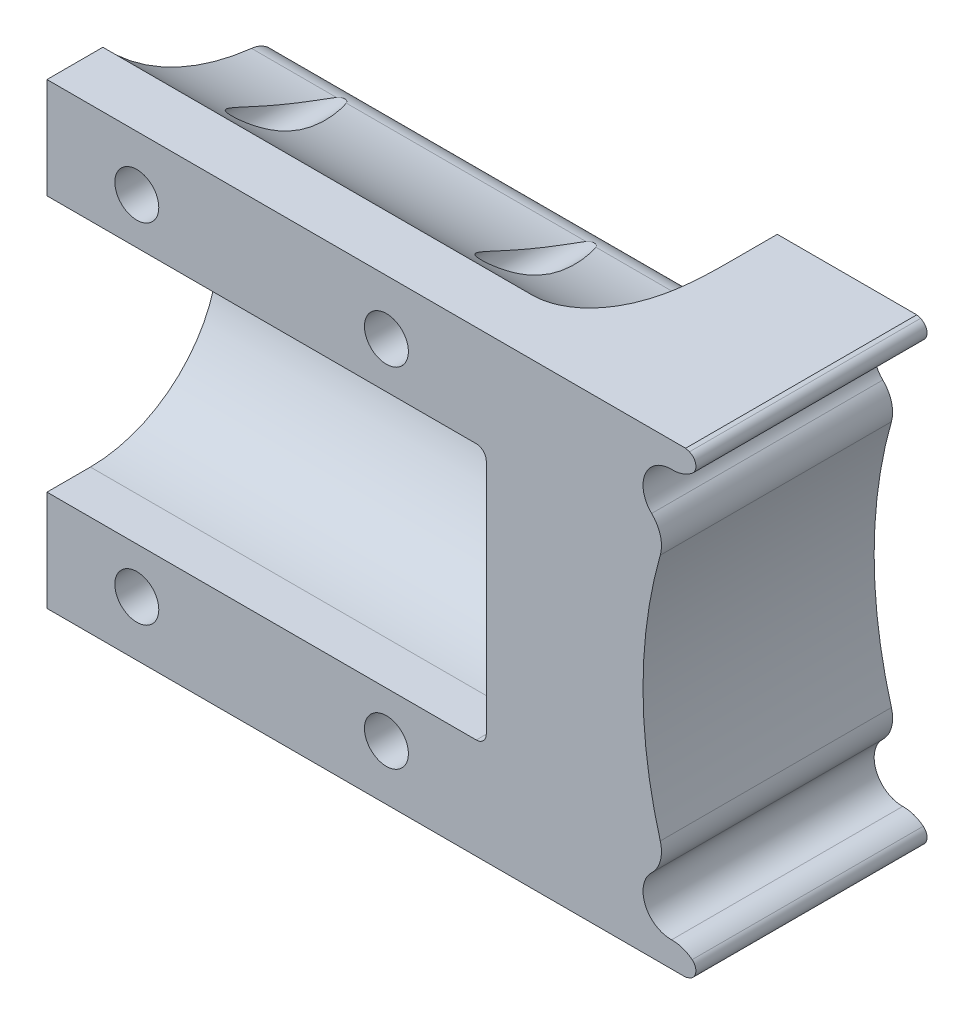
ISO-10303-21;
HEADER;
FILE_DESCRIPTION(('STEP AP214'),'2;1');
FILE_NAME('part.step','',(''),(''),'','','');
FILE_SCHEMA(('AUTOMOTIVE_DESIGN { 1 0 10303 214 1 1 1 1 }'));
ENDSEC;
DATA;
#1=APPLICATION_CONTEXT('core data for automotive mechanical design processes');
#2=APPLICATION_PROTOCOL_DEFINITION('international standard','automotive_design',2000,#1);
#3=PRODUCT_CONTEXT('',#1,'mechanical');
#4=PRODUCT('Part','Part','',(#3));
#5=PRODUCT_RELATED_PRODUCT_CATEGORY('part','',(#4));
#6=PRODUCT_DEFINITION_FORMATION('','',#4);
#7=PRODUCT_DEFINITION_CONTEXT('part definition',#1,'design');
#8=PRODUCT_DEFINITION('design','',#6,#7);
#9=PRODUCT_DEFINITION_SHAPE('','',#8);
#10=(LENGTH_UNIT() NAMED_UNIT(*) SI_UNIT(.MILLI.,.METRE.));
#11=(NAMED_UNIT(*) PLANE_ANGLE_UNIT() SI_UNIT($,.RADIAN.));
#12=(NAMED_UNIT(*) SI_UNIT($,.STERADIAN.) SOLID_ANGLE_UNIT());
#13=UNCERTAINTY_MEASURE_WITH_UNIT(LENGTH_MEASURE(1.E-05),#10,'distance_accuracy_value','');
#14=(GEOMETRIC_REPRESENTATION_CONTEXT(3) GLOBAL_UNCERTAINTY_ASSIGNED_CONTEXT((#13)) GLOBAL_UNIT_ASSIGNED_CONTEXT((#10,
#11,#12)) REPRESENTATION_CONTEXT('',''));
#15=CARTESIAN_POINT('',(0.,0.,0.));
#16=DIRECTION('',(0.,0.,1.));
#17=DIRECTION('',(1.,0.,0.));
#18=AXIS2_PLACEMENT_3D('',#15,#16,#17);
#19=CARTESIAN_POINT('',(50.,-22.9398492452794,0.));
#20=DIRECTION('',(0.,1.,0.));
#21=DIRECTION('',(0.,0.,1.));
#22=AXIS2_PLACEMENT_3D('',#19,#20,#21);
#23=PLANE('',#22);
#24=DIRECTION('',(1.,0.,0.));
#25=VECTOR('',#24,1.);
#26=CARTESIAN_POINT('',(0.,-22.9398492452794,-0.4));
#27=LINE('',#26,#25);
#28=CARTESIAN_POINT('',(0.,-22.9398492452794,-0.4));
#29=VERTEX_POINT('',#28);
#30=CARTESIAN_POINT('',(63.9692143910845,-22.9398492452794,-0.399999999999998));
#31=VERTEX_POINT('',#30);
#32=EDGE_CURVE('E270',#29,#31,#27,.T.);
#33=ORIENTED_EDGE('',*,*,#32,.F.);
#34=DIRECTION('',(0.,0.,-1.));
#35=VECTOR('',#34,1.);
#36=CARTESIAN_POINT('',(0.,-22.9398492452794,0.));
#37=LINE('',#36,#35);
#38=CARTESIAN_POINT('',(0.,-22.9398492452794,-6.));
#39=VERTEX_POINT('',#38);
#40=EDGE_CURVE('E285',#29,#39,#37,.T.);
#41=ORIENTED_EDGE('',*,*,#40,.T.);
#42=DIRECTION('',(-1.,0.,0.));
#43=VECTOR('',#42,1.);
#44=CARTESIAN_POINT('',(50.,-22.9398492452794,-6.));
#45=LINE('',#44,#43);
#46=CARTESIAN_POINT('',(43.,-22.9398492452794,-6.));
#47=VERTEX_POINT('',#46);
#48=EDGE_CURVE('E323',#47,#39,#45,.T.);
#49=ORIENTED_EDGE('',*,*,#48,.F.);
#50=CARTESIAN_POINT('',(43.,-22.9398492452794,-6.));
#51=CARTESIAN_POINT('',(43.1567440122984,-22.9398492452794,-5.99995899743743));
#52=CARTESIAN_POINT('',(43.3134721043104,-22.9398492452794,-6.00715912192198));
#53=CARTESIAN_POINT('',(43.6255568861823,-22.9398492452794,-6.03573656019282));
#54=CARTESIAN_POINT('',(43.7809142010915,-22.9398492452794,-6.05710703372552));
#55=CARTESIAN_POINT('',(44.0881112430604,-22.9398492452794,-6.11354422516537));
#56=CARTESIAN_POINT('',(44.2399668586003,-22.9398492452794,-6.14852475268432));
#57=CARTESIAN_POINT('',(44.5400379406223,-22.9398492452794,-6.23163812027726));
#58=CARTESIAN_POINT('',(44.6882531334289,-22.9398492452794,-6.27977194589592));
#59=CARTESIAN_POINT('',(44.9797530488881,-22.9398492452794,-6.38838771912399));
#60=CARTESIAN_POINT('',(45.1230466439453,-22.9398492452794,-6.44884591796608));
#61=CARTESIAN_POINT('',(45.4042220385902,-22.9398492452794,-6.58137314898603));
#62=CARTESIAN_POINT('',(45.5421014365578,-22.9398492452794,-6.65344726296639));
#63=CARTESIAN_POINT('',(45.8118729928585,-22.9398492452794,-6.80838239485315));
#64=CARTESIAN_POINT('',(45.9437575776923,-22.9398492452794,-6.89125657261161));
#65=CARTESIAN_POINT('',(46.2008606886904,-22.9398492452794,-7.06678420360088));
#66=CARTESIAN_POINT('',(46.3260778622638,-22.9398492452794,-7.15943962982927));
#67=CARTESIAN_POINT('',(46.6059669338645,-22.9398492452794,-7.38269201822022));
#68=CARTESIAN_POINT('',(46.7582169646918,-22.9398492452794,-7.5163368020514));
#69=CARTESIAN_POINT('',(47.050351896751,-22.9398492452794,-7.79647915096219));
#70=CARTESIAN_POINT('',(47.1902337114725,-22.9398492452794,-7.94297990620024));
#71=CARTESIAN_POINT('',(47.5910417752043,-22.9398492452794,-8.39881021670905));
#72=CARTESIAN_POINT('',(47.8333450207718,-22.9398492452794,-8.72464357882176));
#73=CARTESIAN_POINT('',(48.3591599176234,-22.9398492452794,-9.54645515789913));
#74=CARTESIAN_POINT('',(48.6189291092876,-22.9398492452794,-10.0574775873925));
#75=CARTESIAN_POINT('',(48.9470840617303,-22.9398492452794,-10.8502483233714));
#76=CARTESIAN_POINT('',(49.0465025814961,-22.9398492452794,-11.1200553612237));
#77=CARTESIAN_POINT('',(49.2264271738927,-22.9398492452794,-11.6658589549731));
#78=CARTESIAN_POINT('',(49.306939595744,-22.9398492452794,-11.9418533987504));
#79=CARTESIAN_POINT('',(49.5191215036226,-22.9398492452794,-12.7605130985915));
#80=CARTESIAN_POINT('',(49.6274334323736,-22.9398492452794,-13.309213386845));
#81=CARTESIAN_POINT('',(49.795746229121,-22.9398492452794,-14.4147405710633));
#82=CARTESIAN_POINT('',(49.8556282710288,-22.9398492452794,-14.9715840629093));
#83=CARTESIAN_POINT('',(49.9190284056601,-22.9398492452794,-15.8002040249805));
#84=CARTESIAN_POINT('',(49.9356916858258,-22.9398492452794,-16.0710994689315));
#85=CARTESIAN_POINT('',(49.962449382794,-22.9398492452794,-16.6132407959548));
#86=CARTESIAN_POINT('',(49.9725432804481,-22.9398492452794,-16.884486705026));
#87=CARTESIAN_POINT('',(49.987579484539,-22.9398492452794,-17.4256106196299));
#88=CARTESIAN_POINT('',(49.9925498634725,-22.9398492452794,-17.6954879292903));
#89=CARTESIAN_POINT('',(49.9987501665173,-22.9398492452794,-18.2352124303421));
#90=CARTESIAN_POINT('',(49.9999811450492,-22.9398492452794,-18.505059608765));
#91=CARTESIAN_POINT('',(50.,-22.9398492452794,-18.7748901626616));
#92=B_SPLINE_CURVE_WITH_KNOTS('',3,(#50,#51,#52,#53,#54,#55,#56,#57,#58,#59,#60,#61,#62,#63,#64,
#65,#66,#67,#68,#69,#70,#71,#72,#73,#74,#75,#76,#77,#78,#79,#80,#81,#82,#83,#84,#85,#86,#87,#88,
#89,#90,#91),.UNSPECIFIED.,.F.,.F.,(4,2,2,2,2,2,2,2,2,2,2,2,2,2,2,2,2,2,2,2,4),(0.,
0.470041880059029,0.939857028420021,1.40674410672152,1.87366617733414,2.33969686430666,
2.80593198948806,3.27274062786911,3.73964360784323,4.34650229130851,4.9535119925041,
6.16671054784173,7.87660132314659,8.73874642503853,9.60060157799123,11.2752124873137,
12.9539198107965,13.7680828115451,14.5823101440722,15.3920521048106,16.2015657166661),.UNSPECIFIED.);
#93=CARTESIAN_POINT('',(50.,-22.9398492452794,-18.7748901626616));
#94=VERTEX_POINT('',#93);
#95=EDGE_CURVE('E414',#47,#94,#92,.T.);
#96=ORIENTED_EDGE('',*,*,#95,.T.);
#97=DIRECTION('',(0.,0.,1.));
#98=VECTOR('',#97,1.);
#99=CARTESIAN_POINT('',(50.,-22.9398492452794,-72.0435791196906));
#100=LINE('',#99,#98);
#101=CARTESIAN_POINT('',(50.,-22.9398492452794,-23.55));
#102=VERTEX_POINT('',#101);
#103=EDGE_CURVE('E718',#102,#94,#100,.T.);
#104=ORIENTED_EDGE('',*,*,#103,.F.);
#105=DIRECTION('',(-1.,0.,0.));
#106=VECTOR('',#105,1.);
#107=CARTESIAN_POINT('',(0.,-22.9398492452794,-23.55));
#108=LINE('',#107,#106);
#109=CARTESIAN_POINT('',(63.9692143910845,-22.9398492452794,-23.55));
#110=VERTEX_POINT('',#109);
#111=EDGE_CURVE('E734',#110,#102,#108,.T.);
#112=ORIENTED_EDGE('',*,*,#111,.F.);
#113=DIRECTION('',(0.,0.,1.));
#114=VECTOR('',#113,1.);
#115=CARTESIAN_POINT('',(63.9692143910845,-22.9398492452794,-69.8217694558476));
#116=LINE('',#115,#114);
#117=EDGE_CURVE('E287',#110,#31,#116,.T.);
#118=ORIENTED_EDGE('',*,*,#117,.T.);
#119=EDGE_LOOP('',(#33,#41,#49,#96,#104,#112,#118));
#120=FACE_BOUND('',#119,.T.);
#121=ADVANCED_FACE('F47',(#120),#23,.F.);
#122=CARTESIAN_POINT('',(50.,22.9398492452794,0.));
#123=DIRECTION('',(0.,-1.,0.));
#124=DIRECTION('',(0.,0.,-1.));
#125=AXIS2_PLACEMENT_3D('',#122,#123,#124);
#126=PLANE('',#125);
#127=DIRECTION('',(-1.,0.,0.));
#128=VECTOR('',#127,1.);
#129=CARTESIAN_POINT('',(0.,22.9398492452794,-0.4));
#130=LINE('',#129,#128);
#131=CARTESIAN_POINT('',(63.9692143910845,22.9398492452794,-0.399999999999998));
#132=VERTEX_POINT('',#131);
#133=CARTESIAN_POINT('',(0.,22.9398492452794,-0.4));
#134=VERTEX_POINT('',#133);
#135=EDGE_CURVE('E289',#132,#134,#130,.T.);
#136=ORIENTED_EDGE('',*,*,#135,.F.);
#137=DIRECTION('',(0.,0.,1.));
#138=VECTOR('',#137,1.);
#139=CARTESIAN_POINT('',(63.9692143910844,22.9398492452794,-69.8217694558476));
#140=LINE('',#139,#138);
#141=CARTESIAN_POINT('',(63.9692143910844,22.9398492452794,-23.55));
#142=VERTEX_POINT('',#141);
#143=EDGE_CURVE('E680',#142,#132,#140,.T.);
#144=ORIENTED_EDGE('',*,*,#143,.F.);
#145=DIRECTION('',(1.,0.,0.));
#146=VECTOR('',#145,1.);
#147=CARTESIAN_POINT('',(0.,22.9398492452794,-23.55));
#148=LINE('',#147,#146);
#149=CARTESIAN_POINT('',(50.,22.9398492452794,-23.55));
#150=VERTEX_POINT('',#149);
#151=EDGE_CURVE('E729',#150,#142,#148,.T.);
#152=ORIENTED_EDGE('',*,*,#151,.F.);
#153=DIRECTION('',(0.,0.,1.));
#154=VECTOR('',#153,1.);
#155=CARTESIAN_POINT('',(50.,22.9398492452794,-72.0435791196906));
#156=LINE('',#155,#154);
#157=CARTESIAN_POINT('',(50.,22.9398492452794,-18.7748901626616));
#158=VERTEX_POINT('',#157);
#159=EDGE_CURVE('E713',#150,#158,#156,.T.);
#160=ORIENTED_EDGE('',*,*,#159,.T.);
#161=CARTESIAN_POINT('',(50.,22.9398492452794,-18.7748901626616));
#162=CARTESIAN_POINT('',(49.9999747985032,22.9398492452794,-18.4850096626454));
#163=CARTESIAN_POINT('',(49.9985573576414,22.9398492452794,-18.1951043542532));
#164=CARTESIAN_POINT('',(49.9912954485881,22.9398492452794,-17.6152426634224));
#165=CARTESIAN_POINT('',(49.9854492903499,22.9398492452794,-17.325286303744));
#166=CARTESIAN_POINT('',(49.9676179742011,22.9398492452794,-16.7433581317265));
#167=CARTESIAN_POINT('',(49.9555868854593,22.9398492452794,-16.4513875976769));
#168=CARTESIAN_POINT('',(49.9235253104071,22.9398492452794,-15.8679096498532));
#169=CARTESIAN_POINT('',(49.9034957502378,22.9398492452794,-15.5764021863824));
#170=CARTESIAN_POINT('',(49.8529973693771,22.9398492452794,-14.9883362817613));
#171=CARTESIAN_POINT('',(49.8223265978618,22.9398492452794,-14.6917942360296));
#172=CARTESIAN_POINT('',(49.7485056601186,22.9398492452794,-14.1002784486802));
#173=CARTESIAN_POINT('',(49.7053537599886,22.9398492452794,-13.8053049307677));
#174=CARTESIAN_POINT('',(49.5541030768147,22.9398492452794,-12.925843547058));
#175=CARTESIAN_POINT('',(49.4240528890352,22.9398492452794,-12.3445971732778));
#176=CARTESIAN_POINT('',(49.1955901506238,22.9398492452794,-11.5712953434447));
#177=CARTESIAN_POINT('',(49.1305538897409,22.9398492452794,-11.3691742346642));
#178=CARTESIAN_POINT('',(48.9898273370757,22.9398492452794,-10.9685768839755));
#179=CARTESIAN_POINT('',(48.9141343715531,22.9398492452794,-10.7701015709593));
#180=CARTESIAN_POINT('',(48.7515440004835,22.9398492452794,-10.3784272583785));
#181=CARTESIAN_POINT('',(48.6646785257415,22.9398492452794,-10.1852150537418));
#182=CARTESIAN_POINT('',(48.4788432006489,22.9398492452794,-9.80468884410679));
#183=CARTESIAN_POINT('',(48.3798741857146,22.9398492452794,-9.61737443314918));
#184=CARTESIAN_POINT('',(48.168089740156,22.9398492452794,-9.24813870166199));
#185=CARTESIAN_POINT('',(48.0551422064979,22.9398492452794,-9.06629279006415));
#186=CARTESIAN_POINT('',(47.8157094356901,22.9398492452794,-8.71174871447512));
#187=CARTESIAN_POINT('',(47.6892267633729,22.9398492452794,-8.53904882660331));
#188=CARTESIAN_POINT('',(47.4223990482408,22.9398492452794,-8.20470801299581));
#189=CARTESIAN_POINT('',(47.2820560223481,22.9398492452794,-8.04306548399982));
#190=CARTESIAN_POINT('',(46.9874613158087,22.9398492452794,-7.73299360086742));
#191=CARTESIAN_POINT('',(46.833213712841,22.9398492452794,-7.58456039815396));
#192=CARTESIAN_POINT('',(46.5479809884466,22.9398492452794,-7.33541276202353));
#193=CARTESIAN_POINT('',(46.4197408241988,22.9398492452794,-7.23154752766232));
#194=CARTESIAN_POINT('',(46.1555248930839,22.9398492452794,-7.0341903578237));
#195=CARTESIAN_POINT('',(46.0195508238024,22.9398492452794,-6.94069615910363));
#196=CARTESIAN_POINT('',(45.7405636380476,22.9398492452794,-6.76532669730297));
#197=CARTESIAN_POINT('',(45.597561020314,22.9398492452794,-6.68343477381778));
#198=CARTESIAN_POINT('',(45.3051147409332,22.9398492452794,-6.53224455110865));
#199=CARTESIAN_POINT('',(45.155674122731,22.9398492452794,-6.46294038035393));
#200=CARTESIAN_POINT('',(44.8456264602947,22.9398492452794,-6.3356125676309));
#201=CARTESIAN_POINT('',(44.6848109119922,22.9398492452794,-6.27809445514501));
#202=CARTESIAN_POINT('',(44.3584355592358,22.9398492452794,-6.17862733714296));
#203=CARTESIAN_POINT('',(44.1928761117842,22.9398492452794,-6.1366771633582));
#204=CARTESIAN_POINT('',(43.8570375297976,22.9398492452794,-6.06884020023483));
#205=CARTESIAN_POINT('',(43.6867304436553,22.9398492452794,-6.0430912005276));
#206=CARTESIAN_POINT('',(43.3442913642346,22.9398492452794,-6.00863578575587));
#207=CARTESIAN_POINT('',(43.1721582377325,22.9398492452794,-5.99994066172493));
#208=CARTESIAN_POINT('',(43.,22.9398492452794,-5.99999999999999));
#209=B_SPLINE_CURVE_WITH_KNOTS('',3,(#161,#162,#163,#164,#165,#166,#167,#168,#169,#170,#171,
#172,#173,#174,#175,#176,#177,#178,#179,#180,#181,#182,#183,#184,#185,#186,#187,#188,#189,#190,
#191,#192,#193,#194,#195,#196,#197,#198,#199,#200,#201,#202,#203,#204,#205,#206,#207,#208),
.UNSPECIFIED.,.F.,.F.,(4,2,2,2,2,2,2,2,2,2,2,2,2,2,2,2,2,2,2,2,2,2,2,4),(0.,0.869676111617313,
1.73968426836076,2.61624871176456,3.49271168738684,4.38681102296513,5.28103462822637,
7.0628324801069,7.69958927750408,8.33650612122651,8.97164151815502,9.60673310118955,
10.2483652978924,10.8898761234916,11.5312937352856,12.1725238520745,12.6671403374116,
13.1616486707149,13.6554395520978,14.1489995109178,14.6606184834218,15.172199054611,
15.6880737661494,16.2042899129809),.UNSPECIFIED.);
#210=CARTESIAN_POINT('',(43.,22.9398492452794,-6.));
#211=VERTEX_POINT('',#210);
#212=EDGE_CURVE('E423',#158,#211,#209,.T.);
#213=ORIENTED_EDGE('',*,*,#212,.T.);
#214=DIRECTION('',(-1.,0.,0.));
#215=VECTOR('',#214,1.);
#216=CARTESIAN_POINT('',(50.,22.9398492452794,-6.));
#217=LINE('',#216,#215);
#218=CARTESIAN_POINT('',(0.,22.9398492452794,-6.));
#219=VERTEX_POINT('',#218);
#220=EDGE_CURVE('E319',#211,#219,#217,.T.);
#221=ORIENTED_EDGE('',*,*,#220,.T.);
#222=DIRECTION('',(0.,0.,1.));
#223=VECTOR('',#222,1.);
#224=CARTESIAN_POINT('',(0.,22.9398492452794,0.));
#225=LINE('',#224,#223);
#226=EDGE_CURVE('E311',#219,#134,#225,.T.);
#227=ORIENTED_EDGE('',*,*,#226,.T.);
#228=EDGE_LOOP('',(#136,#144,#152,#160,#213,#221,#227));
#229=FACE_BOUND('',#228,.T.);
#230=ADVANCED_FACE('F409',(#229),#126,.F.);
#231=CARTESIAN_POINT('',(0.,0.,-4.75));
#232=DIRECTION('',(1.,0.,0.));
#233=DIRECTION('',(0.,0.,-1.));
#234=AXIS2_PLACEMENT_3D('',#231,#232,#233);
#235=PLANE('',#234);
#236=DIRECTION('',(0.,-1.,0.));
#237=VECTOR('',#236,1.);
#238=CARTESIAN_POINT('',(0.,22.9398492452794,-0.4));
#239=LINE('',#238,#237);
#240=CARTESIAN_POINT('',(0.,12.85,-0.4));
#241=VERTEX_POINT('',#240);
#242=EDGE_CURVE('E276',#134,#241,#239,.T.);
#243=ORIENTED_EDGE('',*,*,#242,.F.);
#244=ORIENTED_EDGE('',*,*,#226,.F.);
#245=CARTESIAN_POINT('',(0.,39.1214875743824,-23.55));
#246=DIRECTION('',(-1.,0.,0.));
#247=DIRECTION('',(0.,0.,-1.));
#248=AXIS2_PLACEMENT_3D('',#245,#246,#247);
#249=CIRCLE('',#248,23.8714875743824);
#250=CARTESIAN_POINT('',(0.,15.3992341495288,-20.8849274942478));
#251=VERTEX_POINT('',#250);
#252=EDGE_CURVE('E308',#251,#219,#249,.T.);
#253=ORIENTED_EDGE('',*,*,#252,.F.);
#254=CARTESIAN_POINT('',(0.,12.4179888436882,-20.55));
#255=DIRECTION('',(1.,0.,0.));
#256=DIRECTION('',(0.,0.,-1.));
#257=AXIS2_PLACEMENT_3D('',#254,#255,#256);
#258=CIRCLE('',#257,3.);
#259=CARTESIAN_POINT('',(0.,12.4179888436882,-23.55));
#260=VERTEX_POINT('',#259);
#261=EDGE_CURVE('E333',#251,#260,#258,.F.);
#262=ORIENTED_EDGE('',*,*,#261,.T.);
#263=DIRECTION('',(0.,1.,0.));
#264=VECTOR('',#263,1.);
#265=CARTESIAN_POINT('',(0.,-15.25,-23.55));
#266=LINE('',#265,#264);
#267=CARTESIAN_POINT('',(0.,-12.4179888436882,-23.55));
#268=VERTEX_POINT('',#267);
#269=EDGE_CURVE('E296',#268,#260,#266,.T.);
#270=ORIENTED_EDGE('',*,*,#269,.F.);
#271=CARTESIAN_POINT('',(0.,-12.4179888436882,-20.55));
#272=DIRECTION('',(1.,0.,0.));
#273=DIRECTION('',(0.,0.,-1.));
#274=AXIS2_PLACEMENT_3D('',#271,#272,#273);
#275=CIRCLE('',#274,3.);
#276=CARTESIAN_POINT('',(0.,-15.3992341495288,-20.8849274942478));
#277=VERTEX_POINT('',#276);
#278=EDGE_CURVE('E335',#268,#277,#275,.F.);
#279=ORIENTED_EDGE('',*,*,#278,.T.);
#280=CARTESIAN_POINT('',(0.,-39.1214875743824,-23.55));
#281=DIRECTION('',(-1.,0.,0.));
#282=DIRECTION('',(0.,0.,1.));
#283=AXIS2_PLACEMENT_3D('',#280,#281,#282);
#284=CIRCLE('',#283,23.8714875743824);
#285=EDGE_CURVE('E291',#39,#277,#284,.T.);
#286=ORIENTED_EDGE('',*,*,#285,.F.);
#287=ORIENTED_EDGE('',*,*,#40,.F.);
#288=CARTESIAN_POINT('',(0.,-12.85,-0.4));
#289=VERTEX_POINT('',#288);
#290=EDGE_CURVE('E261',#289,#29,#239,.T.);
#291=ORIENTED_EDGE('',*,*,#290,.F.);
#292=DIRECTION('',(0.,0.,1.));
#293=VECTOR('',#292,1.);
#294=CARTESIAN_POINT('',(0.,-12.85,-4.75));
#295=LINE('',#294,#293);
#296=CARTESIAN_POINT('',(0.,-12.85,-4.75));
#297=VERTEX_POINT('',#296);
#298=EDGE_CURVE('E505',#297,#289,#295,.T.);
#299=ORIENTED_EDGE('',*,*,#298,.F.);
#300=CARTESIAN_POINT('',(0.,0.,-4.75));
#301=DIRECTION('',(-1.,0.,0.));
#302=DIRECTION('',(0.,0.,-1.));
#303=AXIS2_PLACEMENT_3D('',#300,#301,#302);
#304=CIRCLE('',#303,12.85);
#305=CARTESIAN_POINT('',(0.,12.85,-4.75));
#306=VERTEX_POINT('',#305);
#307=EDGE_CURVE('E298',#306,#297,#304,.T.);
#308=ORIENTED_EDGE('',*,*,#307,.F.);
#309=DIRECTION('',(0.,0.,-1.));
#310=VECTOR('',#309,1.);
#311=CARTESIAN_POINT('',(0.,12.85,-4.75));
#312=LINE('',#311,#310);
#313=EDGE_CURVE('E761',#241,#306,#312,.T.);
#314=ORIENTED_EDGE('',*,*,#313,.F.);
#315=EDGE_LOOP('',(#243,#244,#253,#262,#270,#279,#286,#287,#291,#299,#308,#314));
#316=FACE_BOUND('',#315,.T.);
#317=ADVANCED_FACE('F295',(#316),#235,.F.);
#318=CARTESIAN_POINT('',(44.,0.,-4.75));
#319=DIRECTION('',(1.,0.,0.));
#320=DIRECTION('',(0.,0.,-1.));
#321=AXIS2_PLACEMENT_3D('',#318,#319,#320);
#322=PLANE('',#321);
#323=DIRECTION('',(0.,-1.,0.));
#324=VECTOR('',#323,1.);
#325=CARTESIAN_POINT('',(44.,0.,-0.4));
#326=LINE('',#325,#324);
#327=CARTESIAN_POINT('',(44.,11.85,-0.4));
#328=VERTEX_POINT('',#327);
#329=CARTESIAN_POINT('',(44.,-11.85,-0.4));
#330=VERTEX_POINT('',#329);
#331=EDGE_CURVE('E61',#328,#330,#326,.T.);
#332=ORIENTED_EDGE('',*,*,#331,.F.);
#333=DIRECTION('',(0.,0.,-1.));
#334=VECTOR('',#333,1.);
#335=CARTESIAN_POINT('',(44.,11.85,-4.75));
#336=LINE('',#335,#334);
#337=CARTESIAN_POINT('',(44.,11.85,-4.75));
#338=VERTEX_POINT('',#337);
#339=EDGE_CURVE('E518',#328,#338,#336,.T.);
#340=ORIENTED_EDGE('',*,*,#339,.T.);
#341=CARTESIAN_POINT('',(44.,0.,-4.75));
#342=DIRECTION('',(1.,0.,0.));
#343=DIRECTION('',(0.,0.,-1.));
#344=AXIS2_PLACEMENT_3D('',#341,#342,#343);
#345=CIRCLE('',#344,11.85);
#346=CARTESIAN_POINT('',(44.,-11.85,-4.75));
#347=VERTEX_POINT('',#346);
#348=EDGE_CURVE('E493',#338,#347,#345,.F.);
#349=ORIENTED_EDGE('',*,*,#348,.T.);
#350=DIRECTION('',(0.,0.,1.));
#351=VECTOR('',#350,1.);
#352=CARTESIAN_POINT('',(44.,-11.85,0.));
#353=LINE('',#352,#351);
#354=EDGE_CURVE('E517',#347,#330,#353,.T.);
#355=ORIENTED_EDGE('',*,*,#354,.T.);
#356=EDGE_LOOP('',(#332,#340,#349,#355));
#357=FACE_BOUND('',#356,.T.);
#358=ADVANCED_FACE('F648',(#357),#322,.F.);
#359=CARTESIAN_POINT('',(62.6302829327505,23.6020565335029,-69.8217694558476));
#360=DIRECTION('',(0.,0.,1.));
#361=DIRECTION('',(1.,0.,0.));
#362=AXIS2_PLACEMENT_3D('',#359,#360,#361);
#363=CYLINDRICAL_SURFACE('',#362,3.20000000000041);
#364=DIRECTION('',(0.,0.,1.));
#365=VECTOR('',#364,1.);
#366=CARTESIAN_POINT('',(64.6198496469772,21.095739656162,-69.8217694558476));
#367=LINE('',#366,#365);
#368=CARTESIAN_POINT('',(64.6198496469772,21.095739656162,-23.55));
#369=VERTEX_POINT('',#368);
#370=CARTESIAN_POINT('',(64.6198496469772,21.095739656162,-0.399999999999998));
#371=VERTEX_POINT('',#370);
#372=EDGE_CURVE('E702',#369,#371,#367,.T.);
#373=ORIENTED_EDGE('',*,*,#372,.T.);
#374=CARTESIAN_POINT('',(62.6302829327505,23.6020565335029,-0.399999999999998));
#375=DIRECTION('',(0.,0.,1.));
#376=DIRECTION('',(1.,0.,0.));
#377=AXIS2_PLACEMENT_3D('',#374,#375,#376);
#378=CIRCLE('',#377,3.20000000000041);
#379=CARTESIAN_POINT('',(62.5616208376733,20.4027932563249,-0.399999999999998));
#380=VERTEX_POINT('',#379);
#381=EDGE_CURVE('E947',#371,#380,#378,.F.);
#382=ORIENTED_EDGE('',*,*,#381,.T.);
#383=DIRECTION('',(0.,0.,1.));
#384=VECTOR('',#383,1.);
#385=CARTESIAN_POINT('',(62.5616208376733,20.4027932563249,-69.8217694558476));
#386=LINE('',#385,#384);
#387=CARTESIAN_POINT('',(62.5616208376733,20.4027932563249,-23.55));
#388=VERTEX_POINT('',#387);
#389=EDGE_CURVE('E809',#388,#380,#386,.T.);
#390=ORIENTED_EDGE('',*,*,#389,.F.);
#391=CARTESIAN_POINT('',(62.6302829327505,23.6020565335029,-23.55));
#392=DIRECTION('',(0.,0.,1.));
#393=DIRECTION('',(1.,0.,0.));
#394=AXIS2_PLACEMENT_3D('',#391,#392,#393);
#395=CIRCLE('',#394,3.20000000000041);
#396=EDGE_CURVE('E828',#369,#388,#395,.F.);
#397=ORIENTED_EDGE('',*,*,#396,.F.);
#398=EDGE_LOOP('',(#373,#382,#390,#397));
#399=FACE_BOUND('',#398,.T.);
#400=ADVANCED_FACE('F619',(#399),#363,.T.);
#401=CARTESIAN_POINT('',(62.5015415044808,17.6034378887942,-69.8217694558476));
#402=DIRECTION('',(0.,0.,1.));
#403=DIRECTION('',(1.,0.,0.));
#404=AXIS2_PLACEMENT_3D('',#401,#402,#403);
#405=CYLINDRICAL_SURFACE('',#404,2.8);
#406=CARTESIAN_POINT('',(62.5015415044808,17.6034378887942,-0.399999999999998));
#407=DIRECTION('',(0.,0.,1.));
#408=DIRECTION('',(1.,0.,0.));
#409=AXIS2_PLACEMENT_3D('',#406,#407,#408);
#410=CIRCLE('',#409,2.8);
#411=CARTESIAN_POINT('',(60.5645808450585,15.5815122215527,-0.399999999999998));
#412=VERTEX_POINT('',#411);
#413=EDGE_CURVE('E952',#412,#380,#410,.F.);
#414=ORIENTED_EDGE('',*,*,#413,.F.);
#415=DIRECTION('',(0.,0.,1.));
#416=VECTOR('',#415,1.);
#417=CARTESIAN_POINT('',(60.5645808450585,15.5815122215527,-69.8217694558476));
#418=LINE('',#417,#416);
#419=CARTESIAN_POINT('',(60.5645808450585,15.5815122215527,-23.55));
#420=VERTEX_POINT('',#419);
#421=EDGE_CURVE('E837',#420,#412,#418,.T.);
#422=ORIENTED_EDGE('',*,*,#421,.F.);
#423=CARTESIAN_POINT('',(62.5015415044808,17.6034378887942,-23.55));
#424=DIRECTION('',(0.,0.,1.));
#425=DIRECTION('',(1.,0.,0.));
#426=AXIS2_PLACEMENT_3D('',#423,#424,#425);
#427=CIRCLE('',#426,2.8);
#428=EDGE_CURVE('E827',#420,#388,#427,.F.);
#429=ORIENTED_EDGE('',*,*,#428,.T.);
#430=ORIENTED_EDGE('',*,*,#389,.T.);
#431=EDGE_LOOP('',(#414,#422,#429,#430));
#432=FACE_BOUND('',#431,.T.);
#433=ADVANCED_FACE('F611',(#432),#405,.F.);
#434=CARTESIAN_POINT('',(58.3509115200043,13.2707400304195,-69.8217694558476));
#435=DIRECTION('',(0.,0.,1.));
#436=DIRECTION('',(1.,0.,0.));
#437=AXIS2_PLACEMENT_3D('',#434,#435,#436);
#438=CYLINDRICAL_SURFACE('',#437,3.2);
#439=ORIENTED_EDGE('',*,*,#421,.T.);
#440=CARTESIAN_POINT('',(58.3509115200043,13.2707400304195,-0.399999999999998));
#441=DIRECTION('',(0.,0.,1.));
#442=DIRECTION('',(1.,0.,0.));
#443=AXIS2_PLACEMENT_3D('',#440,#441,#442);
#444=CIRCLE('',#443,3.2);
#445=CARTESIAN_POINT('',(61.428911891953,12.3955750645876,-0.399999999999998));
#446=VERTEX_POINT('',#445);
#447=EDGE_CURVE('E957',#412,#446,#444,.F.);
#448=ORIENTED_EDGE('',*,*,#447,.T.);
#449=DIRECTION('',(0.,0.,1.));
#450=VECTOR('',#449,1.);
#451=CARTESIAN_POINT('',(61.428911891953,12.3955750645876,-69.8217694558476));
#452=LINE('',#451,#450);
#453=CARTESIAN_POINT('',(61.428911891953,12.3955750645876,-23.55));
#454=VERTEX_POINT('',#453);
#455=EDGE_CURVE('E838',#454,#446,#452,.T.);
#456=ORIENTED_EDGE('',*,*,#455,.F.);
#457=CARTESIAN_POINT('',(58.3509115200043,13.2707400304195,-23.55));
#458=DIRECTION('',(0.,0.,1.));
#459=DIRECTION('',(1.,0.,0.));
#460=AXIS2_PLACEMENT_3D('',#457,#458,#459);
#461=CIRCLE('',#460,3.2);
#462=EDGE_CURVE('E822',#420,#454,#461,.F.);
#463=ORIENTED_EDGE('',*,*,#462,.F.);
#464=EDGE_LOOP('',(#439,#448,#456,#463));
#465=FACE_BOUND('',#464,.T.);
#466=ADVANCED_FACE('F620',(#465),#438,.T.);
#467=CARTESIAN_POINT('',(105.,0.,-69.8217694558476));
#468=DIRECTION('',(0.,0.,1.));
#469=DIRECTION('',(1.,0.,0.));
#470=AXIS2_PLACEMENT_3D('',#467,#468,#469);
#471=CYLINDRICAL_SURFACE('',#470,45.300000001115);
#472=CARTESIAN_POINT('',(105.,0.,-0.399999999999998));
#473=DIRECTION('',(0.,0.,1.));
#474=DIRECTION('',(1.,0.,0.));
#475=AXIS2_PLACEMENT_3D('',#472,#473,#474);
#476=CIRCLE('',#475,45.300000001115);
#477=CARTESIAN_POINT('',(61.4289037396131,-12.3955464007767,-0.399999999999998));
#478=VERTEX_POINT('',#477);
#479=EDGE_CURVE('E958',#478,#446,#476,.F.);
#480=ORIENTED_EDGE('',*,*,#479,.F.);
#481=DIRECTION('',(0.,0.,1.));
#482=VECTOR('',#481,1.);
#483=CARTESIAN_POINT('',(61.4289037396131,-12.3955464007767,-69.8217694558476));
#484=LINE('',#483,#482);
#485=CARTESIAN_POINT('',(61.4289037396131,-12.3955464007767,-23.55));
#486=VERTEX_POINT('',#485);
#487=EDGE_CURVE('E841',#486,#478,#484,.T.);
#488=ORIENTED_EDGE('',*,*,#487,.F.);
#489=CARTESIAN_POINT('',(105.,0.,-23.55));
#490=DIRECTION('',(0.,0.,1.));
#491=DIRECTION('',(1.,0.,0.));
#492=AXIS2_PLACEMENT_3D('',#489,#490,#491);
#493=CIRCLE('',#492,45.300000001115);
#494=EDGE_CURVE('E816',#486,#454,#493,.F.);
#495=ORIENTED_EDGE('',*,*,#494,.T.);
#496=ORIENTED_EDGE('',*,*,#455,.T.);
#497=EDGE_LOOP('',(#480,#488,#495,#496));
#498=FACE_BOUND('',#497,.T.);
#499=ADVANCED_FACE('F624',(#498),#471,.F.);
#500=CARTESIAN_POINT('',(58.3509115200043,-13.2707400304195,-69.8217694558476));
#501=DIRECTION('',(0.,0.,1.));
#502=DIRECTION('',(1.,0.,0.));
#503=AXIS2_PLACEMENT_3D('',#500,#501,#502);
#504=CYLINDRICAL_SURFACE('',#503,3.19999999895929);
#505=ORIENTED_EDGE('',*,*,#487,.T.);
#506=CARTESIAN_POINT('',(58.3509115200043,-13.2707400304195,-0.399999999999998));
#507=DIRECTION('',(0.,0.,1.));
#508=DIRECTION('',(1.,0.,0.));
#509=AXIS2_PLACEMENT_3D('',#506,#507,#508);
#510=CIRCLE('',#509,3.19999999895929);
#511=CARTESIAN_POINT('',(60.5645808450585,-15.5815122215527,-0.399999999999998));
#512=VERTEX_POINT('',#511);
#513=EDGE_CURVE('E964',#478,#512,#510,.F.);
#514=ORIENTED_EDGE('',*,*,#513,.T.);
#515=DIRECTION('',(0.,0.,1.));
#516=VECTOR('',#515,1.);
#517=CARTESIAN_POINT('',(60.5645808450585,-15.5815122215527,-69.8217694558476));
#518=LINE('',#517,#516);
#519=CARTESIAN_POINT('',(60.5645808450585,-15.5815122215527,-23.55));
#520=VERTEX_POINT('',#519);
#521=EDGE_CURVE('E847',#520,#512,#518,.T.);
#522=ORIENTED_EDGE('',*,*,#521,.F.);
#523=CARTESIAN_POINT('',(58.3509115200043,-13.2707400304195,-23.55));
#524=DIRECTION('',(0.,0.,1.));
#525=DIRECTION('',(1.,0.,0.));
#526=AXIS2_PLACEMENT_3D('',#523,#524,#525);
#527=CIRCLE('',#526,3.19999999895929);
#528=EDGE_CURVE('E817',#486,#520,#527,.F.);
#529=ORIENTED_EDGE('',*,*,#528,.F.);
#530=EDGE_LOOP('',(#505,#514,#522,#529));
#531=FACE_BOUND('',#530,.T.);
#532=ADVANCED_FACE('F627',(#531),#504,.T.);
#533=CARTESIAN_POINT('',(62.5015415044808,-17.6034378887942,-69.8217694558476));
#534=DIRECTION('',(0.,0.,1.));
#535=DIRECTION('',(1.,0.,0.));
#536=AXIS2_PLACEMENT_3D('',#533,#534,#535);
#537=CYLINDRICAL_SURFACE('',#536,2.8);
#538=CARTESIAN_POINT('',(62.5015415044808,-17.6034378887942,-0.399999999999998));
#539=DIRECTION('',(0.,0.,1.));
#540=DIRECTION('',(1.,0.,0.));
#541=AXIS2_PLACEMENT_3D('',#538,#539,#540);
#542=CIRCLE('',#541,2.8);
#543=CARTESIAN_POINT('',(62.5616208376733,-20.4027932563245,-0.399999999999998));
#544=VERTEX_POINT('',#543);
#545=EDGE_CURVE('E970',#544,#512,#542,.F.);
#546=ORIENTED_EDGE('',*,*,#545,.F.);
#547=DIRECTION('',(0.,0.,1.));
#548=VECTOR('',#547,1.);
#549=CARTESIAN_POINT('',(62.5616208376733,-20.4027932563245,-69.8217694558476));
#550=LINE('',#549,#548);
#551=CARTESIAN_POINT('',(62.5616208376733,-20.4027932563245,-23.55));
#552=VERTEX_POINT('',#551);
#553=EDGE_CURVE('E855',#552,#544,#550,.T.);
#554=ORIENTED_EDGE('',*,*,#553,.F.);
#555=CARTESIAN_POINT('',(62.5015415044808,-17.6034378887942,-23.55));
#556=DIRECTION('',(0.,0.,1.));
#557=DIRECTION('',(1.,0.,0.));
#558=AXIS2_PLACEMENT_3D('',#555,#556,#557);
#559=CIRCLE('',#558,2.8);
#560=EDGE_CURVE('E815',#552,#520,#559,.F.);
#561=ORIENTED_EDGE('',*,*,#560,.T.);
#562=ORIENTED_EDGE('',*,*,#521,.T.);
#563=EDGE_LOOP('',(#546,#554,#561,#562));
#564=FACE_BOUND('',#563,.T.);
#565=ADVANCED_FACE('F628',(#564),#537,.F.);
#566=CARTESIAN_POINT('',(62.6302829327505,-23.6020565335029,-69.8217694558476));
#567=DIRECTION('',(0.,0.,1.));
#568=DIRECTION('',(1.,0.,0.));
#569=AXIS2_PLACEMENT_3D('',#566,#567,#568);
#570=CYLINDRICAL_SURFACE('',#569,3.20000000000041);
#571=ORIENTED_EDGE('',*,*,#553,.T.);
#572=CARTESIAN_POINT('',(62.6302829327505,-23.6020565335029,-0.399999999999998));
#573=DIRECTION('',(0.,0.,1.));
#574=DIRECTION('',(1.,0.,0.));
#575=AXIS2_PLACEMENT_3D('',#572,#573,#574);
#576=CIRCLE('',#575,3.20000000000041);
#577=CARTESIAN_POINT('',(64.6198496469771,-21.095739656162,-0.399999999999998));
#578=VERTEX_POINT('',#577);
#579=EDGE_CURVE('E966',#544,#578,#576,.F.);
#580=ORIENTED_EDGE('',*,*,#579,.T.);
#581=DIRECTION('',(0.,0.,1.));
#582=VECTOR('',#581,1.);
#583=CARTESIAN_POINT('',(64.6198496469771,-21.095739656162,-69.8217694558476));
#584=LINE('',#583,#582);
#585=CARTESIAN_POINT('',(64.6198496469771,-21.095739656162,-23.55));
#586=VERTEX_POINT('',#585);
#587=EDGE_CURVE('E542',#578,#586,#584,.F.);
#588=ORIENTED_EDGE('',*,*,#587,.T.);
#589=CARTESIAN_POINT('',(62.6302829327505,-23.6020565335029,-23.55));
#590=DIRECTION('',(0.,0.,1.));
#591=DIRECTION('',(1.,0.,0.));
#592=AXIS2_PLACEMENT_3D('',#589,#590,#591);
#593=CIRCLE('',#592,3.20000000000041);
#594=EDGE_CURVE('E810',#552,#586,#593,.F.);
#595=ORIENTED_EDGE('',*,*,#594,.F.);
#596=EDGE_LOOP('',(#571,#580,#588,#595));
#597=FACE_BOUND('',#596,.T.);
#598=ADVANCED_FACE('F635',(#597),#570,.T.);
#599=CARTESIAN_POINT('',(62.5409287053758,-17.9398492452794,-69.8217694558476));
#600=DIRECTION('',(0.,0.,1.));
#601=DIRECTION('',(1.,0.,0.));
#602=AXIS2_PLACEMENT_3D('',#599,#600,#601);
#603=CYLINDRICAL_SURFACE('',#602,5.20000000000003);
#604=DIRECTION('',(0.,0.,1.));
#605=VECTOR('',#604,1.);
#606=CARTESIAN_POINT('',(64.3450579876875,-22.8168480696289,-69.8217694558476));
#607=LINE('',#606,#605);
#608=CARTESIAN_POINT('',(64.3450579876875,-22.8168480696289,-23.55));
#609=VERTEX_POINT('',#608);
#610=CARTESIAN_POINT('',(64.3450579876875,-22.8168480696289,-0.399999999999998));
#611=VERTEX_POINT('',#610);
#612=EDGE_CURVE('E689',#609,#611,#607,.T.);
#613=ORIENTED_EDGE('',*,*,#612,.T.);
#614=CARTESIAN_POINT('',(62.5409287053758,-17.9398492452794,-0.399999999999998));
#615=DIRECTION('',(0.,0.,1.));
#616=DIRECTION('',(1.,0.,0.));
#617=AXIS2_PLACEMENT_3D('',#614,#615,#616);
#618=CIRCLE('',#617,5.20000000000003);
#619=EDGE_CURVE('E971',#611,#31,#618,.F.);
#620=ORIENTED_EDGE('',*,*,#619,.T.);
#621=ORIENTED_EDGE('',*,*,#117,.F.);
#622=CARTESIAN_POINT('',(62.5409287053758,-17.9398492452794,-23.55));
#623=DIRECTION('',(0.,0.,1.));
#624=DIRECTION('',(1.,0.,0.));
#625=AXIS2_PLACEMENT_3D('',#622,#623,#624);
#626=CIRCLE('',#625,5.20000000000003);
#627=EDGE_CURVE('E803',#609,#110,#626,.F.);
#628=ORIENTED_EDGE('',*,*,#627,.F.);
#629=EDGE_LOOP('',(#613,#620,#621,#628));
#630=FACE_BOUND('',#629,.T.);
#631=ADVANCED_FACE('F636',(#630),#603,.T.);
#632=CARTESIAN_POINT('',(62.5409287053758,17.9398492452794,-69.8217694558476));
#633=DIRECTION('',(0.,0.,1.));
#634=DIRECTION('',(1.,0.,0.));
#635=AXIS2_PLACEMENT_3D('',#632,#633,#634);
#636=CYLINDRICAL_SURFACE('',#635,5.20000000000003);
#637=ORIENTED_EDGE('',*,*,#143,.T.);
#638=CARTESIAN_POINT('',(62.5409287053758,17.9398492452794,-0.399999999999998));
#639=DIRECTION('',(0.,0.,1.));
#640=DIRECTION('',(1.,0.,0.));
#641=AXIS2_PLACEMENT_3D('',#638,#639,#640);
#642=CIRCLE('',#641,5.20000000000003);
#643=CARTESIAN_POINT('',(64.3450579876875,22.8168480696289,-0.399999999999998));
#644=VERTEX_POINT('',#643);
#645=EDGE_CURVE('E503',#132,#644,#642,.F.);
#646=ORIENTED_EDGE('',*,*,#645,.T.);
#647=DIRECTION('',(0.,0.,1.));
#648=VECTOR('',#647,1.);
#649=CARTESIAN_POINT('',(64.3450579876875,22.8168480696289,-69.8217694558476));
#650=LINE('',#649,#648);
#651=CARTESIAN_POINT('',(64.3450579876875,22.8168480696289,-23.55));
#652=VERTEX_POINT('',#651);
#653=EDGE_CURVE('E697',#644,#652,#650,.F.);
#654=ORIENTED_EDGE('',*,*,#653,.T.);
#655=CARTESIAN_POINT('',(62.5409287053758,17.9398492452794,-23.55));
#656=DIRECTION('',(0.,0.,1.));
#657=DIRECTION('',(1.,0.,0.));
#658=AXIS2_PLACEMENT_3D('',#655,#656,#657);
#659=CIRCLE('',#658,5.20000000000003);
#660=EDGE_CURVE('E706',#142,#652,#659,.F.);
#661=ORIENTED_EDGE('',*,*,#660,.F.);
#662=EDGE_LOOP('',(#637,#646,#654,#661));
#663=FACE_BOUND('',#662,.T.);
#664=ADVANCED_FACE('F458',(#663),#636,.T.);
#665=CARTESIAN_POINT('',(63.9981100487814,21.8789636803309,-69.8217694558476));
#666=DIRECTION('',(0.,0.,1.));
#667=DIRECTION('',(1.,0.,0.));
#668=AXIS2_PLACEMENT_3D('',#665,#666,#667);
#669=CYLINDRICAL_SURFACE('',#668,1.);
#670=ORIENTED_EDGE('',*,*,#653,.F.);
#671=CARTESIAN_POINT('',(63.9981100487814,21.8789636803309,-0.399999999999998));
#672=DIRECTION('',(0.,0.,1.));
#673=DIRECTION('',(1.,0.,0.));
#674=AXIS2_PLACEMENT_3D('',#671,#672,#673);
#675=CIRCLE('',#674,1.);
#676=EDGE_CURVE('E946',#644,#371,#675,.F.);
#677=ORIENTED_EDGE('',*,*,#676,.T.);
#678=ORIENTED_EDGE('',*,*,#372,.F.);
#679=CARTESIAN_POINT('',(63.9981100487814,21.8789636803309,-23.55));
#680=DIRECTION('',(0.,0.,1.));
#681=DIRECTION('',(1.,0.,0.));
#682=AXIS2_PLACEMENT_3D('',#679,#680,#681);
#683=CIRCLE('',#682,1.);
#684=EDGE_CURVE('E695',#652,#369,#683,.F.);
#685=ORIENTED_EDGE('',*,*,#684,.F.);
#686=EDGE_LOOP('',(#670,#677,#678,#685));
#687=FACE_BOUND('',#686,.T.);
#688=ADVANCED_FACE('F457',(#687),#669,.T.);
#689=CARTESIAN_POINT('',(63.9981100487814,-21.8789636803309,-69.8217694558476));
#690=DIRECTION('',(0.,0.,1.));
#691=DIRECTION('',(1.,0.,0.));
#692=AXIS2_PLACEMENT_3D('',#689,#690,#691);
#693=CYLINDRICAL_SURFACE('',#692,1.);
#694=ORIENTED_EDGE('',*,*,#587,.F.);
#695=CARTESIAN_POINT('',(63.9981100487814,-21.8789636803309,-0.399999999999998));
#696=DIRECTION('',(0.,0.,1.));
#697=DIRECTION('',(1.,0.,0.));
#698=AXIS2_PLACEMENT_3D('',#695,#696,#697);
#699=CIRCLE('',#698,1.);
#700=EDGE_CURVE('E975',#578,#611,#699,.F.);
#701=ORIENTED_EDGE('',*,*,#700,.T.);
#702=ORIENTED_EDGE('',*,*,#612,.F.);
#703=CARTESIAN_POINT('',(63.9981100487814,-21.8789636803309,-23.55));
#704=DIRECTION('',(0.,0.,1.));
#705=DIRECTION('',(1.,0.,0.));
#706=AXIS2_PLACEMENT_3D('',#703,#704,#705);
#707=CIRCLE('',#706,1.);
#708=EDGE_CURVE('E693',#586,#609,#707,.F.);
#709=ORIENTED_EDGE('',*,*,#708,.F.);
#710=EDGE_LOOP('',(#694,#701,#702,#709));
#711=FACE_BOUND('',#710,.T.);
#712=ADVANCED_FACE('F459',(#711),#693,.T.);
#713=CARTESIAN_POINT('',(34.,17.4398492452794,-5.));
#714=DIRECTION('',(0.,0.,1.));
#715=DIRECTION('',(1.,0.,0.));
#716=AXIS2_PLACEMENT_3D('',#713,#714,#715);
#717=CYLINDRICAL_SURFACE('',#716,2.2);
#718=CARTESIAN_POINT('',(34.,17.4398492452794,-5.));
#719=DIRECTION('',(0.,0.,1.));
#720=DIRECTION('',(1.,0.,0.));
#721=AXIS2_PLACEMENT_3D('',#718,#719,#720);
#722=CIRCLE('',#721,2.2);
#723=CARTESIAN_POINT('',(36.2,17.4398492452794,-5.));
#724=VERTEX_POINT('',#723);
#725=EDGE_CURVE('E792',#724,#724,#722,.T.);
#726=ORIENTED_EDGE('',*,*,#725,.F.);
#727=EDGE_LOOP('',(#726));
#728=FACE_BOUND('',#727,.T.);
#729=CARTESIAN_POINT('',(34.,17.4398492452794,-0.4));
#730=DIRECTION('',(0.,0.,1.));
#731=DIRECTION('',(1.,0.,0.));
#732=AXIS2_PLACEMENT_3D('',#729,#730,#731);
#733=CIRCLE('',#732,2.2);
#734=CARTESIAN_POINT('',(36.2,17.4398492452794,-0.4));
#735=VERTEX_POINT('',#734);
#736=EDGE_CURVE('E982',#735,#735,#733,.F.);
#737=ORIENTED_EDGE('',*,*,#736,.F.);
#738=EDGE_LOOP('',(#737));
#739=FACE_BOUND('',#738,.T.);
#740=ADVANCED_FACE('F461',(#728,#739),#717,.F.);
#741=CARTESIAN_POINT('',(9.,-17.4398492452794,-5.));
#742=DIRECTION('',(0.,0.,1.));
#743=DIRECTION('',(1.,0.,0.));
#744=AXIS2_PLACEMENT_3D('',#741,#742,#743);
#745=CYLINDRICAL_SURFACE('',#744,2.2);
#746=CARTESIAN_POINT('',(9.,-17.4398492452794,-5.));
#747=DIRECTION('',(0.,0.,1.));
#748=DIRECTION('',(1.,0.,0.));
#749=AXIS2_PLACEMENT_3D('',#746,#747,#748);
#750=CIRCLE('',#749,2.2);
#751=CARTESIAN_POINT('',(11.2,-17.4398492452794,-5.));
#752=VERTEX_POINT('',#751);
#753=EDGE_CURVE('E793',#752,#752,#750,.T.);
#754=ORIENTED_EDGE('',*,*,#753,.F.);
#755=EDGE_LOOP('',(#754));
#756=FACE_BOUND('',#755,.T.);
#757=CARTESIAN_POINT('',(9.,-17.4398492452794,-0.4));
#758=DIRECTION('',(0.,0.,1.));
#759=DIRECTION('',(1.,0.,0.));
#760=AXIS2_PLACEMENT_3D('',#757,#758,#759);
#761=CIRCLE('',#760,2.2);
#762=CARTESIAN_POINT('',(11.2,-17.4398492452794,-0.4));
#763=VERTEX_POINT('',#762);
#764=EDGE_CURVE('E1005',#763,#763,#761,.F.);
#765=ORIENTED_EDGE('',*,*,#764,.F.);
#766=EDGE_LOOP('',(#765));
#767=FACE_BOUND('',#766,.T.);
#768=ADVANCED_FACE('F586',(#756,#767),#745,.F.);
#769=CARTESIAN_POINT('',(34.,-17.4398492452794,-5.));
#770=DIRECTION('',(0.,0.,1.));
#771=DIRECTION('',(1.,0.,0.));
#772=AXIS2_PLACEMENT_3D('',#769,#770,#771);
#773=CYLINDRICAL_SURFACE('',#772,2.2);
#774=CARTESIAN_POINT('',(34.,-17.4398492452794,-5.));
#775=DIRECTION('',(0.,0.,1.));
#776=DIRECTION('',(1.,0.,0.));
#777=AXIS2_PLACEMENT_3D('',#774,#775,#776);
#778=CIRCLE('',#777,2.2);
#779=CARTESIAN_POINT('',(36.2,-17.4398492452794,-5.));
#780=VERTEX_POINT('',#779);
#781=EDGE_CURVE('E788',#780,#780,#778,.T.);
#782=ORIENTED_EDGE('',*,*,#781,.F.);
#783=EDGE_LOOP('',(#782));
#784=FACE_BOUND('',#783,.T.);
#785=CARTESIAN_POINT('',(34.,-17.4398492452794,-0.4));
#786=DIRECTION('',(0.,0.,1.));
#787=DIRECTION('',(1.,0.,0.));
#788=AXIS2_PLACEMENT_3D('',#785,#786,#787);
#789=CIRCLE('',#788,2.2);
#790=CARTESIAN_POINT('',(36.2,-17.4398492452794,-0.4));
#791=VERTEX_POINT('',#790);
#792=EDGE_CURVE('E1008',#791,#791,#789,.F.);
#793=ORIENTED_EDGE('',*,*,#792,.F.);
#794=EDGE_LOOP('',(#793));
#795=FACE_BOUND('',#794,.T.);
#796=ADVANCED_FACE('F583',(#784,#795),#773,.F.);
#797=CARTESIAN_POINT('',(9.,17.4398492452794,-5.));
#798=DIRECTION('',(0.,0.,1.));
#799=DIRECTION('',(1.,0.,0.));
#800=AXIS2_PLACEMENT_3D('',#797,#798,#799);
#801=CYLINDRICAL_SURFACE('',#800,2.2);
#802=CARTESIAN_POINT('',(9.,17.4398492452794,-5.));
#803=DIRECTION('',(0.,0.,1.));
#804=DIRECTION('',(1.,0.,0.));
#805=AXIS2_PLACEMENT_3D('',#802,#803,#804);
#806=CIRCLE('',#805,2.2);
#807=CARTESIAN_POINT('',(11.2,17.4398492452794,-5.));
#808=VERTEX_POINT('',#807);
#809=EDGE_CURVE('E683',#808,#808,#806,.T.);
#810=ORIENTED_EDGE('',*,*,#809,.F.);
#811=EDGE_LOOP('',(#810));
#812=FACE_BOUND('',#811,.T.);
#813=CARTESIAN_POINT('',(9.,17.4398492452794,-0.4));
#814=DIRECTION('',(0.,0.,1.));
#815=DIRECTION('',(1.,0.,0.));
#816=AXIS2_PLACEMENT_3D('',#813,#814,#815);
#817=CIRCLE('',#816,2.2);
#818=CARTESIAN_POINT('',(11.2,17.4398492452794,-0.4));
#819=VERTEX_POINT('',#818);
#820=EDGE_CURVE('E1009',#819,#819,#817,.F.);
#821=ORIENTED_EDGE('',*,*,#820,.F.);
#822=EDGE_LOOP('',(#821));
#823=FACE_BOUND('',#822,.T.);
#824=ADVANCED_FACE('F589',(#812,#823),#801,.F.);
#825=CARTESIAN_POINT('',(48.8364113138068,-12.85,-4.75));
#826=DIRECTION('',(0.,-1.,0.));
#827=DIRECTION('',(0.,0.,-1.));
#828=AXIS2_PLACEMENT_3D('',#825,#826,#827);
#829=PLANE('',#828);
#830=DIRECTION('',(-1.,0.,0.));
#831=VECTOR('',#830,1.);
#832=CARTESIAN_POINT('',(48.8364113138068,-12.85,-0.4));
#833=LINE('',#832,#831);
#834=CARTESIAN_POINT('',(43.,-12.85,-0.4));
#835=VERTEX_POINT('',#834);
#836=EDGE_CURVE('E269',#835,#289,#833,.T.);
#837=ORIENTED_EDGE('',*,*,#836,.F.);
#838=DIRECTION('',(0.,0.,1.));
#839=VECTOR('',#838,1.);
#840=CARTESIAN_POINT('',(43.,-12.85,-4.75));
#841=LINE('',#840,#839);
#842=CARTESIAN_POINT('',(43.,-12.85,-4.75));
#843=VERTEX_POINT('',#842);
#844=EDGE_CURVE('E514',#835,#843,#841,.F.);
#845=ORIENTED_EDGE('',*,*,#844,.T.);
#846=DIRECTION('',(-1.,0.,0.));
#847=VECTOR('',#846,1.);
#848=CARTESIAN_POINT('',(48.8364113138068,-12.85,-4.75));
#849=LINE('',#848,#847);
#850=EDGE_CURVE('E498',#843,#297,#849,.T.);
#851=ORIENTED_EDGE('',*,*,#850,.T.);
#852=ORIENTED_EDGE('',*,*,#298,.T.);
#853=EDGE_LOOP('',(#837,#845,#851,#852));
#854=FACE_BOUND('',#853,.T.);
#855=ADVANCED_FACE('F565',(#854),#829,.F.);
#856=CARTESIAN_POINT('',(48.8364113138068,12.85,-4.75));
#857=DIRECTION('',(0.,1.,0.));
#858=DIRECTION('',(0.,0.,1.));
#859=AXIS2_PLACEMENT_3D('',#856,#857,#858);
#860=PLANE('',#859);
#861=DIRECTION('',(1.,0.,0.));
#862=VECTOR('',#861,1.);
#863=CARTESIAN_POINT('',(48.8364113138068,12.85,-0.4));
#864=LINE('',#863,#862);
#865=CARTESIAN_POINT('',(43.,12.85,-0.4));
#866=VERTEX_POINT('',#865);
#867=EDGE_CURVE('E760',#241,#866,#864,.T.);
#868=ORIENTED_EDGE('',*,*,#867,.F.);
#869=ORIENTED_EDGE('',*,*,#313,.T.);
#870=DIRECTION('',(-1.,0.,0.));
#871=VECTOR('',#870,1.);
#872=CARTESIAN_POINT('',(48.8364113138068,12.85,-4.75));
#873=LINE('',#872,#871);
#874=CARTESIAN_POINT('',(43.,12.85,-4.75));
#875=VERTEX_POINT('',#874);
#876=EDGE_CURVE('E764',#875,#306,#873,.T.);
#877=ORIENTED_EDGE('',*,*,#876,.F.);
#878=DIRECTION('',(0.,0.,-1.));
#879=VECTOR('',#878,1.);
#880=CARTESIAN_POINT('',(43.,12.85,0.));
#881=LINE('',#880,#879);
#882=EDGE_CURVE('E506',#875,#866,#881,.F.);
#883=ORIENTED_EDGE('',*,*,#882,.T.);
#884=EDGE_LOOP('',(#868,#869,#877,#883));
#885=FACE_BOUND('',#884,.T.);
#886=ADVANCED_FACE('F762',(#885),#860,.F.);
#887=CARTESIAN_POINT('',(43.,11.85,-4.75));
#888=DIRECTION('',(0.,0.,1.));
#889=DIRECTION('',(1.,0.,0.));
#890=AXIS2_PLACEMENT_3D('',#887,#888,#889);
#891=CYLINDRICAL_SURFACE('',#890,1.);
#892=CARTESIAN_POINT('',(43.,11.85,-0.4));
#893=DIRECTION('',(0.,0.,1.));
#894=DIRECTION('',(1.,0.,0.));
#895=AXIS2_PLACEMENT_3D('',#892,#893,#894);
#896=CIRCLE('',#895,1.);
#897=EDGE_CURVE('E754',#866,#328,#896,.F.);
#898=ORIENTED_EDGE('',*,*,#897,.F.);
#899=ORIENTED_EDGE('',*,*,#882,.F.);
#900=CARTESIAN_POINT('',(43.,11.85,-4.75));
#901=DIRECTION('',(0.,0.,1.));
#902=DIRECTION('',(1.,0.,0.));
#903=AXIS2_PLACEMENT_3D('',#900,#901,#902);
#904=CIRCLE('',#903,1.);
#905=EDGE_CURVE('E487',#338,#875,#904,.T.);
#906=ORIENTED_EDGE('',*,*,#905,.F.);
#907=ORIENTED_EDGE('',*,*,#339,.F.);
#908=EDGE_LOOP('',(#898,#899,#906,#907));
#909=FACE_BOUND('',#908,.T.);
#910=ADVANCED_FACE('F51',(#909),#891,.F.);
#911=CARTESIAN_POINT('',(43.,-11.85,-4.75));
#912=DIRECTION('',(0.,0.,-1.));
#913=DIRECTION('',(-1.,0.,0.));
#914=AXIS2_PLACEMENT_3D('',#911,#912,#913);
#915=CYLINDRICAL_SURFACE('',#914,1.);
#916=CARTESIAN_POINT('',(43.,-11.85,-0.4));
#917=DIRECTION('',(0.,0.,1.));
#918=DIRECTION('',(1.,0.,0.));
#919=AXIS2_PLACEMENT_3D('',#916,#917,#918);
#920=CIRCLE('',#919,1.);
#921=EDGE_CURVE('E12',#330,#835,#920,.F.);
#922=ORIENTED_EDGE('',*,*,#921,.F.);
#923=ORIENTED_EDGE('',*,*,#354,.F.);
#924=CARTESIAN_POINT('',(43.,-11.85,-4.75));
#925=DIRECTION('',(0.,0.,-1.));
#926=DIRECTION('',(-1.,0.,0.));
#927=AXIS2_PLACEMENT_3D('',#924,#925,#926);
#928=CIRCLE('',#927,1.);
#929=EDGE_CURVE('E497',#347,#843,#928,.T.);
#930=ORIENTED_EDGE('',*,*,#929,.T.);
#931=ORIENTED_EDGE('',*,*,#844,.F.);
#932=EDGE_LOOP('',(#922,#923,#930,#931));
#933=FACE_BOUND('',#932,.T.);
#934=ADVANCED_FACE('F477',(#933),#915,.F.);
#935=CARTESIAN_POINT('',(50.,0.,-4.75));
#936=DIRECTION('',(-1.,0.,0.));
#937=DIRECTION('',(0.,0.,1.));
#938=AXIS2_PLACEMENT_3D('',#935,#936,#937);
#939=CYLINDRICAL_SURFACE('',#938,12.85);
#940=CARTESIAN_POINT('',(6.9,0.,-17.6));
#941=CARTESIAN_POINT('',(6.90000472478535,0.117121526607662,-17.5999980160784));
#942=CARTESIAN_POINT('',(6.90983127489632,0.234307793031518,-17.5983820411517));
#943=CARTESIAN_POINT('',(6.94886279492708,0.465395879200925,-17.592091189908));
#944=CARTESIAN_POINT('',(6.97808579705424,0.579294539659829,-17.5874134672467));
#945=CARTESIAN_POINT('',(7.05500620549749,0.800430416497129,-17.5755239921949));
#946=CARTESIAN_POINT('',(7.10268873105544,0.907672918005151,-17.5683142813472));
#947=CARTESIAN_POINT('',(7.21513620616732,1.11262082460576,-17.5521543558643));
#948=CARTESIAN_POINT('',(7.27989911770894,1.21032736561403,-17.5432043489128));
#949=CARTESIAN_POINT('',(7.42530347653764,1.3943436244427,-17.5244644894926));
#950=CARTESIAN_POINT('',(7.50607135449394,1.48055280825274,-17.5146683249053));
#951=CARTESIAN_POINT('',(7.68092081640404,1.63825897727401,-17.4953887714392));
#952=CARTESIAN_POINT('',(7.77500322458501,1.70975505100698,-17.4859054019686));
#953=CARTESIAN_POINT('',(7.97449866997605,1.83640607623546,-17.468264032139));
#954=CARTESIAN_POINT('',(8.07997533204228,1.89146204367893,-17.4601141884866));
#955=CARTESIAN_POINT('',(8.29883490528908,1.98303711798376,-17.4461499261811));
#956=CARTESIAN_POINT('',(8.41221730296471,2.01955742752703,-17.4403353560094));
#957=CARTESIAN_POINT('',(8.64260579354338,2.07270865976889,-17.4317626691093));
#958=CARTESIAN_POINT('',(8.75957090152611,2.08951286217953,-17.4289779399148));
#959=CARTESIAN_POINT('',(8.99469123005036,2.10329203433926,-17.4266996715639));
#960=CARTESIAN_POINT('',(9.11284636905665,2.10026835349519,-17.4272059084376));
#961=CARTESIAN_POINT('',(9.34575842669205,2.07461882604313,-17.4314280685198));
#962=CARTESIAN_POINT('',(9.46053740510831,2.05218729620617,-17.4351121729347));
#963=CARTESIAN_POINT('',(9.68468044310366,1.98866361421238,-17.44522517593));
#964=CARTESIAN_POINT('',(9.79404432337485,1.94757084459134,-17.451654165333));
#965=CARTESIAN_POINT('',(10.0048363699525,1.84769311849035,-17.4665670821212));
#966=CARTESIAN_POINT('',(10.1062254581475,1.78882714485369,-17.4750603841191));
#967=CARTESIAN_POINT('',(10.2977604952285,1.6551315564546,-17.4931383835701));
#968=CARTESIAN_POINT('',(10.387905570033,1.58030070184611,-17.5027231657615));
#969=CARTESIAN_POINT('',(10.5555187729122,1.41573919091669,-17.5220441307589));
#970=CARTESIAN_POINT('',(10.6328231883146,1.32584174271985,-17.5317807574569));
#971=CARTESIAN_POINT('',(10.7712743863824,1.13426388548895,-17.5502027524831));
#972=CARTESIAN_POINT('',(10.8324210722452,1.03258340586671,-17.5588881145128));
#973=CARTESIAN_POINT('',(10.9368346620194,0.820174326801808,-17.5742406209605));
#974=CARTESIAN_POINT('',(10.9800874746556,0.709438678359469,-17.5809061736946));
#975=CARTESIAN_POINT('',(11.0473355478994,0.482141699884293,-17.5914551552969));
#976=CARTESIAN_POINT('',(11.071332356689,0.365580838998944,-17.595338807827));
#977=CARTESIAN_POINT('',(11.0991661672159,0.131353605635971,-17.5998564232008));
#978=CARTESIAN_POINT('',(11.1032279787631,0.0137146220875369,-17.6005266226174));
#979=CARTESIAN_POINT('',(11.0916753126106,-0.220563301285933,-17.5986409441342));
#980=CARTESIAN_POINT('',(11.0760615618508,-0.337202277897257,-17.5960851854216));
#981=CARTESIAN_POINT('',(11.0257879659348,-0.565477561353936,-17.5880571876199));
#982=CARTESIAN_POINT('',(10.9912390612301,-0.677138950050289,-17.5826019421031));
#983=CARTESIAN_POINT('',(10.904193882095,-0.893084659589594,-17.5693842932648));
#984=CARTESIAN_POINT('',(10.8516966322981,-0.997368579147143,-17.5616217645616));
#985=CARTESIAN_POINT('',(10.7297275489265,-1.19657805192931,-17.5445610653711));
#986=CARTESIAN_POINT('',(10.6601148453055,-1.29141626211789,-17.5352503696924));
#987=CARTESIAN_POINT('',(10.506085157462,-1.46814485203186,-17.516164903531));
#988=CARTESIAN_POINT('',(10.4216671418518,-1.55003432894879,-17.5063901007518));
#989=CARTESIAN_POINT('',(10.2394163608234,-1.69937114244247,-17.4873613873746));
#990=CARTESIAN_POINT('',(10.1414585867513,-1.76666682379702,-17.4781136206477));
#991=CARTESIAN_POINT('',(9.93549693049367,-1.88384763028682,-17.4612995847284));
#992=CARTESIAN_POINT('',(9.82749335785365,-1.93373329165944,-17.4537332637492));
#993=CARTESIAN_POINT('',(9.60493566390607,-2.01444949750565,-17.4411845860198));
#994=CARTESIAN_POINT('',(9.49040984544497,-2.04535640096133,-17.4361918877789));
#995=CARTESIAN_POINT('',(9.25770419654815,-2.08747862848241,-17.4293294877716));
#996=CARTESIAN_POINT('',(9.1395246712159,-2.09869559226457,-17.4274595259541));
#997=CARTESIAN_POINT('',(8.90438008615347,-2.10107515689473,-17.4270652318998));
#998=CARTESIAN_POINT('',(8.78741743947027,-2.09247641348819,-17.4285010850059));
#999=CARTESIAN_POINT('',(8.55662666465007,-2.05598376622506,-17.4344695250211));
#1000=CARTESIAN_POINT('',(8.44279852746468,-2.02808991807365,-17.4390021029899));
#1001=CARTESIAN_POINT('',(8.22159494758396,-1.95388888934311,-17.4506383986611));
#1002=CARTESIAN_POINT('',(8.11421271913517,-1.9076014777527,-17.4577393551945));
#1003=CARTESIAN_POINT('',(7.90869941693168,-1.79795159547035,-17.4737151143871));
#1004=CARTESIAN_POINT('',(7.81056877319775,-1.73458833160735,-17.4825899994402));
#1005=CARTESIAN_POINT('',(7.62513705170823,-1.59173052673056,-17.5012402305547));
#1006=CARTESIAN_POINT('',(7.53797232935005,-1.51206016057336,-17.5110246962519));
#1007=CARTESIAN_POINT('',(7.37816689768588,-1.33922073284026,-17.530318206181));
#1008=CARTESIAN_POINT('',(7.30552954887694,-1.24604855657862,-17.539827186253));
#1009=CARTESIAN_POINT('',(7.17640344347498,-1.0481190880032,-17.557571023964));
#1010=CARTESIAN_POINT('',(7.12002468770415,-0.943289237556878,-17.5657970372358));
#1011=CARTESIAN_POINT('',(7.02576289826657,-0.725556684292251,-17.5799619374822));
#1012=CARTESIAN_POINT('',(6.98786129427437,-0.612662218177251,-17.5859031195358));
#1013=CARTESIAN_POINT('',(6.93993192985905,-0.416095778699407,-17.5935203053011));
#1014=CARTESIAN_POINT('',(6.92498121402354,-0.333618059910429,-17.5959373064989));
#1015=CARTESIAN_POINT('',(6.90501364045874,-0.167437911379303,-17.599177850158));
#1016=CARTESIAN_POINT('',(6.89999662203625,-0.0837355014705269,-17.6000014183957));
#1017=CARTESIAN_POINT('',(6.9,0.,-17.6));
#1018=B_SPLINE_CURVE_WITH_KNOTS('',3,(#940,#941,#942,#943,#944,#945,#946,#947,#948,#949,#950,
#951,#952,#953,#954,#955,#956,#957,#958,#959,#960,#961,#962,#963,#964,#965,#966,#967,#968,#969,
#970,#971,#972,#973,#974,#975,#976,#977,#978,#979,#980,#981,#982,#983,#984,#985,#986,#987,#988,
#989,#990,#991,#992,#993,#994,#995,#996,#997,#998,#999,#1000,#1001,#1002,#1003,#1004,#1005,
#1006,#1007,#1008,#1009,#1010,#1011,#1012,#1013,#1014,#1015,#1016,#1017),.UNSPECIFIED.,.T.,.F.,
(4,2,2,2,2,2,2,2,2,2,2,2,2,2,2,2,2,2,2,2,2,2,2,2,2,2,2,2,2,2,2,2,2,2,2,2,2,2,4),(0.,
0.351058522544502,0.702443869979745,1.05354654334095,1.40460734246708,1.75856061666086,
2.11253581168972,2.46860116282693,2.82464340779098,3.17753247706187,3.53039753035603,
3.87976995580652,4.22915394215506,4.58015523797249,4.93118380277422,5.28639177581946,
5.64160187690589,5.99709117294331,6.35255188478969,6.70399465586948,7.05542444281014,
7.40481689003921,7.75422832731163,8.10661799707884,8.45903222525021,8.81494965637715,
9.17085612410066,9.52532109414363,9.87975654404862,10.2299456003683,10.5801336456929,
10.9299463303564,11.2797752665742,11.6335961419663,11.9874987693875,12.343742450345,
12.6996273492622,12.9506190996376,13.2016067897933),.UNSPECIFIED.);
#1019=CARTESIAN_POINT('',(6.9,0.,-17.6));
#1020=VERTEX_POINT('',#1019);
#1021=EDGE_CURVE('E552',#1020,#1020,#1018,.T.);
#1022=ORIENTED_EDGE('',*,*,#1021,.T.);
#1023=EDGE_LOOP('',(#1022));
#1024=FACE_BOUND('',#1023,.T.);
#1025=CARTESIAN_POINT('',(31.9,0.,-17.6));
#1026=CARTESIAN_POINT('',(31.9000047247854,0.117121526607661,-17.5999980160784));
#1027=CARTESIAN_POINT('',(31.9098312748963,0.234307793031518,-17.5983820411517));
#1028=CARTESIAN_POINT('',(31.9488627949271,0.465395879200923,-17.592091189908));
#1029=CARTESIAN_POINT('',(31.9780857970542,0.579294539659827,-17.5874134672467));
#1030=CARTESIAN_POINT('',(32.0550062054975,0.800430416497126,-17.5755239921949));
#1031=CARTESIAN_POINT('',(32.1026887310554,0.907672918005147,-17.5683142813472));
#1032=CARTESIAN_POINT('',(32.2151362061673,1.11262082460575,-17.5521543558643));
#1033=CARTESIAN_POINT('',(32.2798991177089,1.21032736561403,-17.5432043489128));
#1034=CARTESIAN_POINT('',(32.4253034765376,1.3943436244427,-17.5244644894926));
#1035=CARTESIAN_POINT('',(32.506071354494,1.48055280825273,-17.5146683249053));
#1036=CARTESIAN_POINT('',(32.6809208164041,1.63825897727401,-17.4953887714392));
#1037=CARTESIAN_POINT('',(32.775003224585,1.70975505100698,-17.4859054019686));
#1038=CARTESIAN_POINT('',(32.9744986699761,1.83640607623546,-17.468264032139));
#1039=CARTESIAN_POINT('',(33.0799753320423,1.89146204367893,-17.4601141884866));
#1040=CARTESIAN_POINT('',(33.2988349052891,1.98303711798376,-17.4461499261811));
#1041=CARTESIAN_POINT('',(33.4122173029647,2.01955742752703,-17.4403353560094));
#1042=CARTESIAN_POINT('',(33.6426057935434,2.07270865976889,-17.4317626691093));
#1043=CARTESIAN_POINT('',(33.7595709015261,2.08951286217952,-17.4289779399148));
#1044=CARTESIAN_POINT('',(33.9946912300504,2.10329203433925,-17.4266996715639));
#1045=CARTESIAN_POINT('',(34.1128463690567,2.10026835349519,-17.4272059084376));
#1046=CARTESIAN_POINT('',(34.3457584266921,2.07461882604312,-17.4314280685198));
#1047=CARTESIAN_POINT('',(34.4605374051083,2.05218729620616,-17.4351121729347));
#1048=CARTESIAN_POINT('',(34.6846804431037,1.98866361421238,-17.44522517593));
#1049=CARTESIAN_POINT('',(34.7940443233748,1.94757084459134,-17.451654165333));
#1050=CARTESIAN_POINT('',(35.0048363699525,1.84769311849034,-17.4665670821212));
#1051=CARTESIAN_POINT('',(35.1062254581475,1.78882714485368,-17.4750603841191));
#1052=CARTESIAN_POINT('',(35.2977604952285,1.65513155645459,-17.4931383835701));
#1053=CARTESIAN_POINT('',(35.387905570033,1.5803007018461,-17.5027231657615));
#1054=CARTESIAN_POINT('',(35.5555187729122,1.41573919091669,-17.5220441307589));
#1055=CARTESIAN_POINT('',(35.6328231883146,1.32584174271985,-17.5317807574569));
#1056=CARTESIAN_POINT('',(35.7712743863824,1.13426388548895,-17.5502027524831));
#1057=CARTESIAN_POINT('',(35.8324210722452,1.03258340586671,-17.5588881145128));
#1058=CARTESIAN_POINT('',(35.9368346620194,0.820174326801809,-17.5742406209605));
#1059=CARTESIAN_POINT('',(35.9800874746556,0.709438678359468,-17.5809061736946));
#1060=CARTESIAN_POINT('',(36.0473355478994,0.482141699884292,-17.5914551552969));
#1061=CARTESIAN_POINT('',(36.071332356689,0.365580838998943,-17.595338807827));
#1062=CARTESIAN_POINT('',(36.0991661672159,0.131353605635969,-17.5998564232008));
#1063=CARTESIAN_POINT('',(36.1032279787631,0.0137146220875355,-17.6005266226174));
#1064=CARTESIAN_POINT('',(36.0916753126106,-0.220563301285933,-17.5986409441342));
#1065=CARTESIAN_POINT('',(36.0760615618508,-0.337202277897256,-17.5960851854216));
#1066=CARTESIAN_POINT('',(36.0257879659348,-0.565477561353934,-17.5880571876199));
#1067=CARTESIAN_POINT('',(35.9912390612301,-0.677138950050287,-17.5826019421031));
#1068=CARTESIAN_POINT('',(35.904193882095,-0.893084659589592,-17.5693842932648));
#1069=CARTESIAN_POINT('',(35.8516966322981,-0.997368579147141,-17.5616217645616));
#1070=CARTESIAN_POINT('',(35.7297275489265,-1.1965780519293,-17.5445610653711));
#1071=CARTESIAN_POINT('',(35.6601148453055,-1.29141626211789,-17.5352503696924));
#1072=CARTESIAN_POINT('',(35.506085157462,-1.46814485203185,-17.516164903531));
#1073=CARTESIAN_POINT('',(35.4216671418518,-1.55003432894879,-17.5063901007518));
#1074=CARTESIAN_POINT('',(35.2394163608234,-1.69937114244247,-17.4873613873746));
#1075=CARTESIAN_POINT('',(35.1414585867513,-1.76666682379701,-17.4781136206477));
#1076=CARTESIAN_POINT('',(34.9354969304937,-1.88384763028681,-17.4612995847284));
#1077=CARTESIAN_POINT('',(34.8274933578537,-1.93373329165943,-17.4537332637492));
#1078=CARTESIAN_POINT('',(34.6049356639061,-2.01444949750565,-17.4411845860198));
#1079=CARTESIAN_POINT('',(34.490409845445,-2.04535640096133,-17.4361918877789));
#1080=CARTESIAN_POINT('',(34.2577041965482,-2.0874786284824,-17.4293294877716));
#1081=CARTESIAN_POINT('',(34.1395246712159,-2.09869559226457,-17.4274595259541));
#1082=CARTESIAN_POINT('',(33.9043800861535,-2.10107515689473,-17.4270652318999));
#1083=CARTESIAN_POINT('',(33.7874174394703,-2.09247641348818,-17.4285010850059));
#1084=CARTESIAN_POINT('',(33.5566266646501,-2.05598376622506,-17.4344695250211));
#1085=CARTESIAN_POINT('',(33.4427985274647,-2.02808991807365,-17.4390021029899));
#1086=CARTESIAN_POINT('',(33.221594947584,-1.9538888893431,-17.4506383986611));
#1087=CARTESIAN_POINT('',(33.1142127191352,-1.90760147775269,-17.4577393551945));
#1088=CARTESIAN_POINT('',(32.9086994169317,-1.79795159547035,-17.4737151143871));
#1089=CARTESIAN_POINT('',(32.8105687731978,-1.73458833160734,-17.4825899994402));
#1090=CARTESIAN_POINT('',(32.6251370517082,-1.59173052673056,-17.5012402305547));
#1091=CARTESIAN_POINT('',(32.5379723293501,-1.51206016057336,-17.5110246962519));
#1092=CARTESIAN_POINT('',(32.3781668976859,-1.33922073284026,-17.530318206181));
#1093=CARTESIAN_POINT('',(32.3055295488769,-1.24604855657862,-17.539827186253));
#1094=CARTESIAN_POINT('',(32.176403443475,-1.0481190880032,-17.557571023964));
#1095=CARTESIAN_POINT('',(32.1200246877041,-0.943289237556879,-17.5657970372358));
#1096=CARTESIAN_POINT('',(32.0257628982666,-0.725556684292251,-17.5799619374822));
#1097=CARTESIAN_POINT('',(31.9878612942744,-0.61266221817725,-17.5859031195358));
#1098=CARTESIAN_POINT('',(31.9399319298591,-0.416095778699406,-17.5935203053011));
#1099=CARTESIAN_POINT('',(31.9249812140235,-0.333618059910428,-17.5959373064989));
#1100=CARTESIAN_POINT('',(31.9050136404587,-0.167437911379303,-17.599177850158));
#1101=CARTESIAN_POINT('',(31.8999966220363,-0.0837355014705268,-17.6000014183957));
#1102=CARTESIAN_POINT('',(31.9,0.,-17.6));
#1103=B_SPLINE_CURVE_WITH_KNOTS('',3,(#1025,#1026,#1027,#1028,#1029,#1030,#1031,#1032,#1033,
#1034,#1035,#1036,#1037,#1038,#1039,#1040,#1041,#1042,#1043,#1044,#1045,#1046,#1047,#1048,#1049,
#1050,#1051,#1052,#1053,#1054,#1055,#1056,#1057,#1058,#1059,#1060,#1061,#1062,#1063,#1064,#1065,
#1066,#1067,#1068,#1069,#1070,#1071,#1072,#1073,#1074,#1075,#1076,#1077,#1078,#1079,#1080,#1081,
#1082,#1083,#1084,#1085,#1086,#1087,#1088,#1089,#1090,#1091,#1092,#1093,#1094,#1095,#1096,#1097,
#1098,#1099,#1100,#1101,#1102),.UNSPECIFIED.,.T.,.F.,(4,2,2,2,2,2,2,2,2,2,2,2,2,2,2,2,2,2,2,2,2,
2,2,2,2,2,2,2,2,2,2,2,2,2,2,2,2,2,4),(0.,0.3510585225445,0.702443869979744,1.05354654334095,
1.40460734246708,1.75856061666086,2.11253581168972,2.46860116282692,2.82464340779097,
3.17753247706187,3.53039753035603,3.87976995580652,4.22915394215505,4.58015523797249,
4.93118380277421,5.28639177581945,5.64160187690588,5.9970911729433,6.35255188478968,
6.70399465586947,7.05542444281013,7.4048168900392,7.75422832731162,8.10661799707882,
8.45903222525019,8.81494965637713,9.17085612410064,9.52532109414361,9.8797565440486,
10.2299456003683,10.5801336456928,10.9299463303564,11.2797752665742,11.6335961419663,
11.9874987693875,12.343742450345,12.6996273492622,12.9506190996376,13.2016067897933),.UNSPECIFIED.);
#1104=CARTESIAN_POINT('',(31.9,0.,-17.6));
#1105=VERTEX_POINT('',#1104);
#1106=EDGE_CURVE('E545',#1105,#1105,#1103,.T.);
#1107=ORIENTED_EDGE('',*,*,#1106,.T.);
#1108=EDGE_LOOP('',(#1107));
#1109=FACE_BOUND('',#1108,.T.);
#1110=ORIENTED_EDGE('',*,*,#850,.F.);
#1111=CARTESIAN_POINT('',(43.,0.,-4.75));
#1112=DIRECTION('',(1.,0.,0.));
#1113=DIRECTION('',(0.,0.,-1.));
#1114=AXIS2_PLACEMENT_3D('',#1111,#1112,#1113);
#1115=CIRCLE('',#1114,12.85);
#1116=EDGE_CURVE('E59',#843,#875,#1115,.T.);
#1117=ORIENTED_EDGE('',*,*,#1116,.T.);
#1118=ORIENTED_EDGE('',*,*,#876,.T.);
#1119=ORIENTED_EDGE('',*,*,#307,.T.);
#1120=EDGE_LOOP('',(#1110,#1117,#1118,#1119));
#1121=FACE_BOUND('',#1120,.T.);
#1122=ADVANCED_FACE('F413',(#1024,#1109,#1121),#939,.F.);
#1123=CARTESIAN_POINT('',(9.,17.4398492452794,-23.55));
#1124=DIRECTION('',(0.,0.,1.));
#1125=DIRECTION('',(1.,0.,0.));
#1126=AXIS2_PLACEMENT_3D('',#1123,#1124,#1125);
#1127=CYLINDRICAL_SURFACE('',#1126,2.1);
#1128=CARTESIAN_POINT('',(11.1,17.4398492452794,-13.5622836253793));
#1129=CARTESIAN_POINT('',(11.1000020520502,17.5339753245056,-13.3579521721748));
#1130=CARTESIAN_POINT('',(11.0936991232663,17.6310007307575,-13.1549340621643));
#1131=CARTESIAN_POINT('',(11.0658151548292,17.8304545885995,-12.7523021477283));
#1132=CARTESIAN_POINT('',(11.0442217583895,17.932887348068,-12.5526912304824));
#1133=CARTESIAN_POINT('',(10.9976778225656,18.0896427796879,-12.2574431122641));
#1134=CARTESIAN_POINT('',(10.9798284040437,18.1423595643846,-12.1598146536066));
#1135=CARTESIAN_POINT('',(10.9388327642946,18.2486610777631,-11.966165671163));
#1136=CARTESIAN_POINT('',(10.915687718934,18.3022456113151,-11.8701447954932));
#1137=CARTESIAN_POINT('',(10.8634725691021,18.4099232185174,-11.6802521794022));
#1138=CARTESIAN_POINT('',(10.8344135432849,18.4640151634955,-11.5863767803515));
#1139=CARTESIAN_POINT('',(10.7695289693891,18.5724397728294,-11.4010877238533));
#1140=CARTESIAN_POINT('',(10.7337025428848,18.6267724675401,-11.3096743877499));
#1141=CARTESIAN_POINT('',(10.6581776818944,18.7298578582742,-11.1387823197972));
#1142=CARTESIAN_POINT('',(10.6191943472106,18.7786394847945,-11.0590073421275));
#1143=CARTESIAN_POINT('',(10.5341062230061,18.8753508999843,-10.9028544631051));
#1144=CARTESIAN_POINT('',(10.4880063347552,18.9232812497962,-10.8264742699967));
#1145=CARTESIAN_POINT('',(10.3880094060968,19.0172232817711,-10.6785547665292));
#1146=CARTESIAN_POINT('',(10.3341620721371,19.0632449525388,-10.606988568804));
#1147=CARTESIAN_POINT('',(10.2174963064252,19.1524750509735,-10.469742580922));
#1148=CARTESIAN_POINT('',(10.154691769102,19.1956876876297,-10.4040539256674));
#1149=CARTESIAN_POINT('',(10.0299363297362,19.2711491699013,-10.2904422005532));
#1150=CARTESIAN_POINT('',(9.9694495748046,19.3040470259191,-10.2413570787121));
#1151=CARTESIAN_POINT('',(9.84103161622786,19.365395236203,-10.1504574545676));
#1152=CARTESIAN_POINT('',(9.77309691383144,19.3938434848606,-10.1086463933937));
#1153=CARTESIAN_POINT('',(9.62924378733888,19.4448246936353,-10.0341232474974));
#1154=CARTESIAN_POINT('',(9.55324987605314,19.4672932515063,-10.0015100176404));
#1155=CARTESIAN_POINT('',(9.39521250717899,19.5039109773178,-9.94854182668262));
#1156=CARTESIAN_POINT('',(9.3131786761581,19.5180730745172,-9.92816781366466));
#1157=CARTESIAN_POINT('',(9.15256545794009,19.5357276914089,-9.90279685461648));
#1158=CARTESIAN_POINT('',(9.07425181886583,19.5399977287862,-9.8966791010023));
#1159=CARTESIAN_POINT('',(8.91768240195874,19.5396930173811,-9.89711591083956));
#1160=CARTESIAN_POINT('',(8.83942661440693,19.5351205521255,-9.90366720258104));
#1161=CARTESIAN_POINT('',(8.6958786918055,19.5188028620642,-9.92712105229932));
#1162=CARTESIAN_POINT('',(8.63022162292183,19.5080648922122,-9.94257080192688));
#1163=CARTESIAN_POINT('',(8.50254203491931,19.4811227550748,-9.98148684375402));
#1164=CARTESIAN_POINT('',(8.44052050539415,19.4649171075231,-10.0049553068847));
#1165=CARTESIAN_POINT('',(8.29527231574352,19.4200903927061,-10.0701998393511));
#1166=CARTESIAN_POINT('',(8.21436029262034,19.3891254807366,-10.1155108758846));
#1167=CARTESIAN_POINT('',(8.06233437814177,19.3207451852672,-10.2164984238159));
#1168=CARTESIAN_POINT('',(7.99124369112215,19.2833149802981,-10.2721987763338));
#1169=CARTESIAN_POINT('',(7.8227322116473,19.1828926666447,-10.4232212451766));
#1170=CARTESIAN_POINT('',(7.73174099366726,19.1169876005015,-10.523730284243));
#1171=CARTESIAN_POINT('',(7.56879365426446,18.9803011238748,-10.7360774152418));
#1172=CARTESIAN_POINT('',(7.49688126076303,18.9095089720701,-10.8479407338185));
#1173=CARTESIAN_POINT('',(7.37606395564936,18.7740528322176,-11.0662321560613));
#1174=CARTESIAN_POINT('',(7.32548827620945,18.7095849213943,-11.171877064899));
#1175=CARTESIAN_POINT('',(7.2349370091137,18.5803678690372,-11.387510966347));
#1176=CARTESIAN_POINT('',(7.19496979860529,18.5156185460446,-11.497503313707));
#1177=CARTESIAN_POINT('',(7.12408799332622,18.3866190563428,-11.7208071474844));
#1178=CARTESIAN_POINT('',(7.09318496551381,18.3223696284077,-11.8341226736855));
#1179=CARTESIAN_POINT('',(7.03923721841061,18.1949618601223,-12.0632408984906));
#1180=CARTESIAN_POINT('',(7.01619544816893,18.1318039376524,-12.1790445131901));
#1181=CARTESIAN_POINT('',(6.97745178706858,18.0085055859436,-12.4096864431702));
#1182=CARTESIAN_POINT('',(6.96158253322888,17.9483291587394,-12.5244778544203));
#1183=CARTESIAN_POINT('',(6.93559054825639,17.8295960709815,-12.7555493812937));
#1184=CARTESIAN_POINT('',(6.92546890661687,17.7710397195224,-12.8718297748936));
#1185=CARTESIAN_POINT('',(6.90272202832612,17.5979770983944,-13.2226392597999));
#1186=CARTESIAN_POINT('',(6.89773518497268,17.4861474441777,-13.4590054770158));
#1187=CARTESIAN_POINT('',(6.90407815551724,17.270146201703,-13.9356599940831));
#1188=CARTESIAN_POINT('',(6.91545343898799,17.1659968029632,-14.175957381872));
#1189=CARTESIAN_POINT('',(6.95163046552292,16.9660356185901,-14.6588733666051));
#1190=CARTESIAN_POINT('',(6.97642764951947,16.8702210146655,-14.9014911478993));
#1191=CARTESIAN_POINT('',(7.03160179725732,16.7039160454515,-15.3435727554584));
#1192=CARTESIAN_POINT('',(7.06010766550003,16.6320132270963,-15.5427475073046));
#1193=CARTESIAN_POINT('',(7.1236166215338,16.4938210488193,-15.9420267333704));
#1194=CARTESIAN_POINT('',(7.15862039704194,16.427532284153,-16.1421313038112));
#1195=CARTESIAN_POINT('',(7.23438557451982,16.3005170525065,-16.5431815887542));
#1196=CARTESIAN_POINT('',(7.27515139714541,16.2397949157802,-16.7441278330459));
#1197=CARTESIAN_POINT('',(7.36182253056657,16.1239433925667,-17.1465079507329));
#1198=CARTESIAN_POINT('',(7.40772758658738,16.0688137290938,-17.3479417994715));
#1199=CARTESIAN_POINT('',(7.50414651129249,15.9642238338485,-17.7506689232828));
#1200=CARTESIAN_POINT('',(7.5546498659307,15.9147512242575,-17.9519615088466));
#1201=CARTESIAN_POINT('',(7.6601340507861,15.821291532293,-18.3546648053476));
#1202=CARTESIAN_POINT('',(7.71511523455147,15.7773048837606,-18.5560755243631));
#1203=CARTESIAN_POINT('',(7.82959490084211,15.6948209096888,-18.9585540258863));
#1204=CARTESIAN_POINT('',(7.88908972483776,15.6563192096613,-19.1596219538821));
#1205=CARTESIAN_POINT('',(8.01321259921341,15.5847443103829,-19.5611191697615));
#1206=CARTESIAN_POINT('',(8.07783970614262,15.5516701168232,-19.7615485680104));
#1207=CARTESIAN_POINT('',(8.18309707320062,15.5048299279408,-20.0695635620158));
#1208=CARTESIAN_POINT('',(8.22119836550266,15.4891470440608,-20.1777238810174));
#1209=CARTESIAN_POINT('',(8.30027235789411,15.4594000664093,-20.393206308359));
#1210=CARTESIAN_POINT('',(8.34124451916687,15.4453356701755,-20.500528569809));
#1211=CARTESIAN_POINT('',(8.40831626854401,15.4247728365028,-20.6660509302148));
#1212=CARTESIAN_POINT('',(8.43288970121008,15.4176997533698,-20.7247913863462));
#1213=CARTESIAN_POINT('',(8.48390500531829,15.4040847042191,-20.8414621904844));
#1214=CARTESIAN_POINT('',(8.51034570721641,15.3975424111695,-20.8993930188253));
#1215=CARTESIAN_POINT('',(8.57428310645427,15.3831087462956,-21.0314912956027));
#1216=CARTESIAN_POINT('',(8.61270375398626,15.3754084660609,-21.1052654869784));
#1217=CARTESIAN_POINT('',(8.67629918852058,15.3648439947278,-21.2109773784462));
#1218=CARTESIAN_POINT('',(8.69809885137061,15.3615323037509,-21.2448855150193));
#1219=CARTESIAN_POINT('',(8.74489194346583,15.3552656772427,-21.3104296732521));
#1220=CARTESIAN_POINT('',(8.76987334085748,15.3523094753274,-21.342073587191));
#1221=CARTESIAN_POINT('',(8.80833471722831,15.348586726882,-21.382688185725));
#1222=CARTESIAN_POINT('',(8.8195648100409,15.3475822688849,-21.3937398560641));
#1223=CARTESIAN_POINT('',(8.84307974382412,15.3456867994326,-21.4147420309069));
#1224=CARTESIAN_POINT('',(8.85536659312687,15.3447960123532,-21.4246903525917));
#1225=CARTESIAN_POINT('',(8.88135806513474,15.3431622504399,-21.4430472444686));
#1226=CARTESIAN_POINT('',(8.895081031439,15.3424216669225,-21.4514307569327));
#1227=CARTESIAN_POINT('',(8.92384085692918,15.3411821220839,-21.4655234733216));
#1228=CARTESIAN_POINT('',(8.93887100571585,15.3406820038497,-21.4712454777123));
#1229=CARTESIAN_POINT('',(8.96461545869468,15.3401222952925,-21.4776604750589));
#1230=CARTESIAN_POINT('',(8.97506482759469,15.3399708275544,-21.4794008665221));
#1231=CARTESIAN_POINT('',(8.99610992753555,15.339826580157,-21.4810581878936));
#1232=CARTESIAN_POINT('',(9.00670558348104,15.3398337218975,-21.4809760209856));
#1233=CARTESIAN_POINT('',(9.02769837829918,15.3400056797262,-21.4790005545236));
#1234=CARTESIAN_POINT('',(9.03809586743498,15.3401701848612,-21.4771108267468));
#1235=CARTESIAN_POINT('',(9.0584674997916,15.3406385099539,-21.4717449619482));
#1236=CARTESIAN_POINT('',(9.06844117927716,15.3409424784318,-21.4682671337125));
#1237=CARTESIAN_POINT('',(9.09333263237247,15.3418690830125,-21.4577036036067));
#1238=CARTESIAN_POINT('',(9.10784901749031,15.3425746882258,-21.4496902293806));
#1239=CARTESIAN_POINT('',(9.13551073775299,15.3441802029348,-21.4315906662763));
#1240=CARTESIAN_POINT('',(9.14865150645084,15.3450807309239,-21.4214978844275));
#1241=CARTESIAN_POINT('',(9.19445860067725,15.3486021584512,-21.3823680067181));
#1242=CARTESIAN_POINT('',(9.22370196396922,15.3516170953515,-21.3494687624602));
#1243=CARTESIAN_POINT('',(9.27775820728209,15.3581248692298,-21.2802493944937));
#1244=CARTESIAN_POINT('',(9.30253597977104,15.3616211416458,-21.2439053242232));
#1245=CARTESIAN_POINT('',(9.3515282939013,15.3693178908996,-21.1658802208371));
#1246=CARTESIAN_POINT('',(9.37545811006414,15.3735537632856,-21.1240225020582));
#1247=CARTESIAN_POINT('',(9.42112015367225,15.3823766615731,-21.0391506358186));
#1248=CARTESIAN_POINT('',(9.44285029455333,15.386964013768,-20.9961354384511));
#1249=CARTESIAN_POINT('',(9.50584968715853,15.4012248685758,-20.8658463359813));
#1250=CARTESIAN_POINT('',(9.54481995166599,15.4113786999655,-20.7775175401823));
#1251=CARTESIAN_POINT('',(9.61930069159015,15.4328739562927,-20.5994778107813));
#1252=CARTESIAN_POINT('',(9.65480691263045,15.4442168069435,-20.5097653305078));
#1253=CARTESIAN_POINT('',(9.72336316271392,15.468033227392,-20.3297126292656));
#1254=CARTESIAN_POINT('',(9.75641676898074,15.4805050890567,-20.2393735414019));
#1255=CARTESIAN_POINT('',(9.85288195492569,15.5195830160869,-19.9679048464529));
#1256=CARTESIAN_POINT('',(9.91368896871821,15.5478789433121,-19.7860948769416));
#1257=CARTESIAN_POINT('',(10.0306039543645,15.6089543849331,-19.4216985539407));
#1258=CARTESIAN_POINT('',(10.0867109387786,15.6417348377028,-19.2391120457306));
#1259=CARTESIAN_POINT('',(10.1950426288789,15.7118325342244,-18.873390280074));
#1260=CARTESIAN_POINT('',(10.2472621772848,15.7491556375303,-18.6902546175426));
#1261=CARTESIAN_POINT('',(10.3479911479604,15.8283223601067,-18.3239607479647));
#1262=CARTESIAN_POINT('',(10.396500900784,15.8701655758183,-18.1408025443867));
#1263=CARTESIAN_POINT('',(10.4896375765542,15.9582701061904,-17.7751819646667));
#1264=CARTESIAN_POINT('',(10.5342758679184,16.0045175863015,-17.5927191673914));
#1265=CARTESIAN_POINT('',(10.6196170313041,16.1015624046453,-17.2280878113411));
#1266=CARTESIAN_POINT('',(10.6603197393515,16.1523599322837,-17.0459192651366));
#1267=CARTESIAN_POINT('',(10.7759939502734,16.3115418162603,-16.5003419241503));
#1268=CARTESIAN_POINT('',(10.844623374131,16.4268011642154,-16.1375047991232));
#1269=CARTESIAN_POINT('',(10.9327152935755,16.6154620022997,-15.5897451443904));
#1270=CARTESIAN_POINT('',(10.9598990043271,16.682127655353,-15.4036959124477));
#1271=CARTESIAN_POINT('',(11.0078818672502,16.8203580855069,-15.0325625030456));
#1272=CARTESIAN_POINT('',(11.0286806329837,16.8919231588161,-14.8474783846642));
#1273=CARTESIAN_POINT('',(11.0630086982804,17.0401053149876,-14.4780545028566));
#1274=CARTESIAN_POINT('',(11.0765177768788,17.1167357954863,-14.2937182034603));
#1275=CARTESIAN_POINT('',(11.0950121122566,17.2747635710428,-13.9266698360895));
#1276=CARTESIAN_POINT('',(11.0999981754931,17.3561604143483,-13.7439576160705));
#1277=CARTESIAN_POINT('',(11.1,17.4398492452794,-13.5622836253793));
#1278=B_SPLINE_CURVE_WITH_KNOTS('',3,(#1128,#1129,#1130,#1131,#1132,#1133,#1134,#1135,#1136,
#1137,#1138,#1139,#1140,#1141,#1142,#1143,#1144,#1145,#1146,#1147,#1148,#1149,#1150,#1151,#1152,
#1153,#1154,#1155,#1156,#1157,#1158,#1159,#1160,#1161,#1162,#1163,#1164,#1165,#1166,#1167,#1168,
#1169,#1170,#1171,#1172,#1173,#1174,#1175,#1176,#1177,#1178,#1179,#1180,#1181,#1182,#1183,#1184,
#1185,#1186,#1187,#1188,#1189,#1190,#1191,#1192,#1193,#1194,#1195,#1196,#1197,#1198,#1199,#1200,
#1201,#1202,#1203,#1204,#1205,#1206,#1207,#1208,#1209,#1210,#1211,#1212,#1213,#1214,#1215,#1216,
#1217,#1218,#1219,#1220,#1221,#1222,#1223,#1224,#1225,#1226,#1227,#1228,#1229,#1230,#1231,#1232,
#1233,#1234,#1235,#1236,#1237,#1238,#1239,#1240,#1241,#1242,#1243,#1244,#1245,#1246,#1247,#1248,
#1249,#1250,#1251,#1252,#1253,#1254,#1255,#1256,#1257,#1258,#1259,#1260,#1261,#1262,#1263,#1264,
#1265,#1266,#1267,#1268,#1269,#1270,#1271,#1272,#1273,#1274,#1275,#1276,#1277),.UNSPECIFIED.,
.T.,.F.,(4,2,2,2,2,2,2,2,2,2,2,2,2,2,2,2,2,2,2,2,2,2,2,2,2,2,2,2,2,2,2,2,2,2,2,2,2,2,2,2,2,2,2,
2,2,2,2,2,2,2,2,2,2,2,2,2,2,2,2,2,2,2,2,2,2,2,2,2,2,2,2,2,2,2,4),(0.,0.674811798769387,
1.35016956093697,1.68719394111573,2.02414355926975,2.36046768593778,2.69683549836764,
3.00050034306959,3.30395697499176,3.60554697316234,3.90667413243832,4.15973166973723,
4.41290859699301,4.66871102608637,4.92411422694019,5.15864048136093,5.39310617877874,
5.59716084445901,5.80127079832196,6.09292564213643,6.38525819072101,6.8349728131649,
7.28570942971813,7.68622338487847,8.08705267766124,8.48839127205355,8.88988025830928,
9.28144434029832,9.67308262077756,10.4568080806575,11.2427156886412,12.0283565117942,
12.6691787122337,13.3100687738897,13.95145322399,14.5928058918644,15.2327272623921,
15.8726992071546,16.5121578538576,17.1514992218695,17.4986940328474,17.8458238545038,
18.0379848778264,18.2300265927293,18.4801997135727,18.6014707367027,18.7222960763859,
18.7696082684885,18.8170124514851,18.8651205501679,18.9129948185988,18.9446337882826,
18.9762570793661,19.0078180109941,19.0394126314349,19.0889127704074,19.1385723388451,
19.2698868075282,19.402192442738,19.5472565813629,19.6924570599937,19.9835106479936,
20.2749173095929,20.565890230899,21.1470931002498,21.7284177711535,22.3105004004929,
22.8925311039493,23.4727903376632,24.0530737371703,25.2125080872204,25.8108619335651,
26.4092519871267,27.0092935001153,27.6092782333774),.UNSPECIFIED.);
#1279=CARTESIAN_POINT('',(9.49587299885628,15.3992341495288,-20.8849274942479));
#1280=VERTEX_POINT('',#1279);
#1281=CARTESIAN_POINT('',(8.5041270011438,15.3992341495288,-20.884927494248));
#1282=VERTEX_POINT('',#1281);
#1283=EDGE_CURVE('E735',#1280,#1282,#1278,.T.);
#1284=ORIENTED_EDGE('',*,*,#1283,.F.);
#1285=CARTESIAN_POINT('',(9.49587299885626,15.3992341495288,-20.8849274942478));
#1286=CARTESIAN_POINT('',(9.48245781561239,15.39598395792,-20.9139661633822));
#1287=CARTESIAN_POINT('',(9.46708666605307,15.3923794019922,-20.9421179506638));
#1288=CARTESIAN_POINT('',(9.43240526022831,15.3847693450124,-20.9960265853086));
#1289=CARTESIAN_POINT('',(9.41307447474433,15.3807618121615,-21.0217698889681));
#1290=CARTESIAN_POINT('',(9.37052316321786,15.3726823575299,-21.0699914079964));
#1291=CARTESIAN_POINT('',(9.34729046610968,15.3686102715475,-21.0924589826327));
#1292=CARTESIAN_POINT('',(9.29731380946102,15.3608490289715,-21.1330962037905));
#1293=CARTESIAN_POINT('',(9.2705761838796,15.3571592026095,-21.1512734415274));
#1294=CARTESIAN_POINT('',(9.21426063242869,15.3506172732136,-21.1824116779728));
#1295=CARTESIAN_POINT('',(9.18469622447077,15.3477614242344,-21.1953961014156));
#1296=CARTESIAN_POINT('',(9.12353398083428,15.3432625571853,-21.2154940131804));
#1297=CARTESIAN_POINT('',(9.09193696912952,15.3416190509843,-21.2226098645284));
#1298=CARTESIAN_POINT('',(9.03205675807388,15.3399081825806,-21.2299991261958));
#1299=CARTESIAN_POINT('',(9.00387079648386,15.339665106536,-21.2310356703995));
#1300=CARTESIAN_POINT('',(8.94775834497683,15.3403119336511,-21.2282551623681));
#1301=CARTESIAN_POINT('',(8.91983177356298,15.341201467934,-21.224439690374));
#1302=CARTESIAN_POINT('',(8.8662741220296,15.3439469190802,-21.2124231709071));
#1303=CARTESIAN_POINT('',(8.84059600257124,15.3457593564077,-21.2044190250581));
#1304=CARTESIAN_POINT('',(8.79088550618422,15.3501377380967,-21.1845125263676));
#1305=CARTESIAN_POINT('',(8.76685275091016,15.3527035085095,-21.1726110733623));
#1306=CARTESIAN_POINT('',(8.71962801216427,15.3585060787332,-21.1446196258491));
#1307=CARTESIAN_POINT('',(8.69655581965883,15.3617721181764,-21.1283345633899));
#1308=CARTESIAN_POINT('',(8.65309068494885,15.3685842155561,-21.0925134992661));
#1309=CARTESIAN_POINT('',(8.632702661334,15.372130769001,-21.072971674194));
#1310=CARTESIAN_POINT('',(8.59128033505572,15.3798792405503,-21.02731586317));
#1311=CARTESIAN_POINT('',(8.5708484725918,15.3840786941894,-21.0006573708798));
#1312=CARTESIAN_POINT('',(8.53428160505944,15.3920594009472,-20.9446201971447));
#1313=CARTESIAN_POINT('',(8.51813054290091,15.3958421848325,-20.915252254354));
#1314=CARTESIAN_POINT('',(8.50412700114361,15.3992341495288,-20.884927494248));
#1315=B_SPLINE_CURVE_WITH_KNOTS('',3,(#1285,#1286,#1287,#1288,#1289,#1290,#1291,#1292,#1293,
#1294,#1295,#1296,#1297,#1298,#1299,#1300,#1301,#1302,#1303,#1304,#1305,#1306,#1307,#1308,#1309,
#1310,#1311,#1312,#1313,#1314),.UNSPECIFIED.,.F.,.F.,(4,2,2,2,2,2,2,2,2,2,2,2,2,2,4),(0.,
0.0964633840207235,0.193440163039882,0.290725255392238,0.387836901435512,0.48450539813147,
0.581134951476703,0.665321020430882,0.749479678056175,0.82999689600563,0.910495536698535,
0.995441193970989,1.08054040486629,1.18167877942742,1.28243224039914),.UNSPECIFIED.);
#1316=EDGE_CURVE('E879',#1280,#1282,#1315,.T.);
#1317=ORIENTED_EDGE('',*,*,#1316,.T.);
#1318=EDGE_LOOP('',(#1284,#1317));
#1319=FACE_BOUND('',#1318,.T.);
#1320=CARTESIAN_POINT('',(9.,17.4398492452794,-5.));
#1321=DIRECTION('',(0.,0.,1.));
#1322=DIRECTION('',(1.,0.,0.));
#1323=AXIS2_PLACEMENT_3D('',#1320,#1321,#1322);
#1324=CIRCLE('',#1323,2.1);
#1325=CARTESIAN_POINT('',(11.1,17.4398492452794,-5.));
#1326=VERTEX_POINT('',#1325);
#1327=EDGE_CURVE('E673',#1326,#1326,#1324,.F.);
#1328=ORIENTED_EDGE('',*,*,#1327,.F.);
#1329=EDGE_LOOP('',(#1328));
#1330=FACE_BOUND('',#1329,.T.);
#1331=ADVANCED_FACE('F377',(#1319,#1330),#1127,.F.);
#1332=CARTESIAN_POINT('',(34.,-17.4398492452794,-23.55));
#1333=DIRECTION('',(0.,0.,1.));
#1334=DIRECTION('',(1.,0.,0.));
#1335=AXIS2_PLACEMENT_3D('',#1332,#1333,#1334);
#1336=CYLINDRICAL_SURFACE('',#1335,2.1);
#1337=CARTESIAN_POINT('',(36.1,-17.4398492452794,-13.5622836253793));
#1338=CARTESIAN_POINT('',(36.1000008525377,-17.3658483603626,-13.722927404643));
#1339=CARTESIAN_POINT('',(36.0960990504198,-17.2936338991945,-13.8843943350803));
#1340=CARTESIAN_POINT('',(36.0815068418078,-17.1529260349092,-14.2086150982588));
#1341=CARTESIAN_POINT('',(36.0708163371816,-17.0844326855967,-14.3713689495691));
#1342=CARTESIAN_POINT('',(36.029819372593,-16.8845150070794,-14.8615299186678));
#1343=CARTESIAN_POINT('',(35.9905906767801,-16.7587866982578,-15.1905461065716));
#1344=CARTESIAN_POINT('',(35.8930337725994,-16.5217050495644,-15.8543370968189));
#1345=CARTESIAN_POINT('',(35.8345289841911,-16.4104984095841,-16.1891369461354));
#1346=CARTESIAN_POINT('',(35.7021907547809,-16.2038935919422,-16.8600952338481));
#1347=CARTESIAN_POINT('',(35.6283767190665,-16.1084756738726,-17.1962514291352));
#1348=CARTESIAN_POINT('',(35.5119327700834,-15.9814599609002,-17.6838746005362));
#1349=CARTESIAN_POINT('',(35.4745357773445,-15.9436706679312,-17.8350281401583));
#1350=CARTESIAN_POINT('',(35.3971827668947,-15.8711897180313,-18.1374458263));
#1351=CARTESIAN_POINT('',(35.3572264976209,-15.836498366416,-18.2887099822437));
#1352=CARTESIAN_POINT('',(35.2746598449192,-15.7701015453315,-18.5916921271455));
#1353=CARTESIAN_POINT('',(35.2320416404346,-15.7384056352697,-18.7434100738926));
#1354=CARTESIAN_POINT('',(35.1441781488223,-15.6781180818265,-19.0466424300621));
#1355=CARTESIAN_POINT('',(35.0989338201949,-15.6495253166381,-19.1981568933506));
#1356=CARTESIAN_POINT('',(35.0061530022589,-15.5958080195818,-19.4986684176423));
#1357=CARTESIAN_POINT('',(34.9586583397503,-15.5706398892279,-19.6476705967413));
#1358=CARTESIAN_POINT('',(34.860074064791,-15.5232677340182,-19.9451922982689));
#1359=CARTESIAN_POINT('',(34.8089798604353,-15.5010676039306,-20.0937109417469));
#1360=CARTESIAN_POINT('',(34.7286194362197,-15.470096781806,-20.3150116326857));
#1361=CARTESIAN_POINT('',(34.7012906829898,-15.460184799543,-20.3883384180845));
#1362=CARTESIAN_POINT('',(34.6449603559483,-15.4411210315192,-20.5344435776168));
#1363=CARTESIAN_POINT('',(34.6159589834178,-15.4319691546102,-20.6072220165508));
#1364=CARTESIAN_POINT('',(34.5556902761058,-15.4144629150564,-20.7517519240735));
#1365=CARTESIAN_POINT('',(34.5244277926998,-15.4061069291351,-20.823505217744));
#1366=CARTESIAN_POINT('',(34.458446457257,-15.3902157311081,-20.9654832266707));
#1367=CARTESIAN_POINT('',(34.4237308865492,-15.3826797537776,-21.0357093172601));
#1368=CARTESIAN_POINT('',(34.3702244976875,-15.3726814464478,-21.1327796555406));
#1369=CARTESIAN_POINT('',(34.3539892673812,-15.369828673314,-21.1609832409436));
#1370=CARTESIAN_POINT('',(34.3199850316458,-15.3642988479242,-21.2166155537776));
#1371=CARTESIAN_POINT('',(34.3022111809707,-15.3616224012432,-21.2440414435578));
#1372=CARTESIAN_POINT('',(34.2637339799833,-15.3563808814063,-21.2986866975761));
#1373=CARTESIAN_POINT('',(34.2429337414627,-15.3538265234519,-21.3258390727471));
#1374=CARTESIAN_POINT('',(34.1979413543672,-15.3490754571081,-21.3772166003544));
#1375=CARTESIAN_POINT('',(34.1737692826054,-15.346876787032,-21.4014576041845));
#1376=CARTESIAN_POINT('',(34.1368609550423,-15.344289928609,-21.4303636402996));
#1377=CARTESIAN_POINT('',(34.1263718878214,-15.3436266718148,-21.4378216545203));
#1378=CARTESIAN_POINT('',(34.1045354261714,-15.3424240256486,-21.4514049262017));
#1379=CARTESIAN_POINT('',(34.0931879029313,-15.3418846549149,-21.4575299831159));
#1380=CARTESIAN_POINT('',(34.069469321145,-15.3409647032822,-21.4680106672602));
#1381=CARTESIAN_POINT('',(34.0570856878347,-15.3405865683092,-21.4723390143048));
#1382=CARTESIAN_POINT('',(34.031711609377,-15.3400507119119,-21.4784812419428));
#1383=CARTESIAN_POINT('',(34.0187229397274,-15.3398923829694,-21.4803020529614));
#1384=CARTESIAN_POINT('',(33.9942445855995,-15.3398258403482,-21.4810669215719));
#1385=CARTESIAN_POINT('',(33.9827645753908,-15.3398895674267,-21.4803337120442));
#1386=CARTESIAN_POINT('',(33.9601250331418,-15.340197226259,-21.4768016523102));
#1387=CARTESIAN_POINT('',(33.9489659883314,-15.3404414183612,-21.4739998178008));
#1388=CARTESIAN_POINT('',(33.924245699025,-15.3411701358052,-21.4656672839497));
#1389=CARTESIAN_POINT('',(33.9108718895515,-15.3417024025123,-21.4595967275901));
#1390=CARTESIAN_POINT('',(33.8852345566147,-15.3429481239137,-21.4454735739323));
#1391=CARTESIAN_POINT('',(33.8729736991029,-15.3436619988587,-21.4374163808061));
#1392=CARTESIAN_POINT('',(33.8387062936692,-15.3459300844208,-21.4119961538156));
#1393=CARTESIAN_POINT('',(33.8180482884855,-15.347655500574,-21.3928642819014));
#1394=CARTESIAN_POINT('',(33.7793503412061,-15.3513836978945,-21.352158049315));
#1395=CARTESIAN_POINT('',(33.7613207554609,-15.3533875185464,-21.3305745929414));
#1396=CARTESIAN_POINT('',(33.7104529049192,-15.3596250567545,-21.2644521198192));
#1397=CARTESIAN_POINT('',(33.6802220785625,-15.3641357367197,-21.2179614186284));
#1398=CARTESIAN_POINT('',(33.6235387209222,-15.3736729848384,-21.1227488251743));
#1399=CARTESIAN_POINT('',(33.5970976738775,-15.3787010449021,-21.07402071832));
#1400=CARTESIAN_POINT('',(33.5465595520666,-15.3892244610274,-20.9751043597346));
#1401=CARTESIAN_POINT('',(33.522474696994,-15.3947220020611,-20.9249100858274));
#1402=CARTESIAN_POINT('',(33.4760647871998,-15.4061191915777,-20.8238655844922));
#1403=CARTESIAN_POINT('',(33.4537371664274,-15.4120182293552,-20.7730164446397));
#1404=CARTESIAN_POINT('',(33.3891297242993,-15.4301636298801,-20.6209357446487));
#1405=CARTESIAN_POINT('',(33.3486623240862,-15.4429819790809,-20.5190038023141));
#1406=CARTESIAN_POINT('',(33.2707693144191,-15.4701019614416,-20.3141728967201));
#1407=CARTESIAN_POINT('',(33.2333445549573,-15.4844040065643,-20.2112736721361));
#1408=CARTESIAN_POINT('',(33.1242342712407,-15.5295413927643,-19.9015021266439));
#1409=CARTESIAN_POINT('',(33.0558096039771,-15.5625791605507,-19.6937989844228));
#1410=CARTESIAN_POINT('',(32.9248677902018,-15.6344115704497,-19.2780384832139));
#1411=CARTESIAN_POINT('',(32.8623389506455,-15.6731944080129,-19.0699826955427));
#1412=CARTESIAN_POINT('',(32.7422608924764,-15.7565681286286,-18.653728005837));
#1413=CARTESIAN_POINT('',(32.6847088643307,-15.8011556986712,-18.4455292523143));
#1414=CARTESIAN_POINT('',(32.5737410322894,-15.8967345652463,-18.0268296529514));
#1415=CARTESIAN_POINT('',(32.5203799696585,-15.9477931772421,-17.8163296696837));
#1416=CARTESIAN_POINT('',(32.4187533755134,-16.0559541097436,-17.395630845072));
#1417=CARTESIAN_POINT('',(32.3704882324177,-16.1130568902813,-17.1854320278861));
#1418=CARTESIAN_POINT('',(32.2794749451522,-16.2334117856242,-16.7653334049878));
#1419=CARTESIAN_POINT('',(32.2367329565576,-16.296670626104,-16.5554341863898));
#1420=CARTESIAN_POINT('',(32.1575044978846,-16.4293156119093,-16.1363946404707));
#1421=CARTESIAN_POINT('',(32.121017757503,-16.4987014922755,-15.9272542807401));
#1422=CARTESIAN_POINT('',(32.0551300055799,-16.6437134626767,-15.5096953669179));
#1423=CARTESIAN_POINT('',(32.0257384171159,-16.7193476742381,-15.3012781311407));
#1424=CARTESIAN_POINT('',(31.9752102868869,-16.8767664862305,-14.8857245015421));
#1425=CARTESIAN_POINT('',(31.9540747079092,-16.9585518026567,-14.6785882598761));
#1426=CARTESIAN_POINT('',(31.921487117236,-17.1280453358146,-14.266358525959));
#1427=CARTESIAN_POINT('',(31.9100193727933,-17.2157436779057,-14.0612622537));
#1428=CARTESIAN_POINT('',(31.8984749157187,-17.3969719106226,-13.6533791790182));
#1429=CARTESIAN_POINT('',(31.8983942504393,-17.4904997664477,-13.4505915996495));
#1430=CARTESIAN_POINT('',(31.9115360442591,-17.6778895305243,-13.0588311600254));
#1431=CARTESIAN_POINT('',(31.9240471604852,-17.7714659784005,-12.8696995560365));
#1432=CARTESIAN_POINT('',(31.9638682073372,-17.9630775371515,-12.4949624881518));
#1433=CARTESIAN_POINT('',(31.9911902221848,-18.0611162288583,-12.3093600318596));
#1434=CARTESIAN_POINT('',(32.0457208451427,-18.2102749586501,-12.0356682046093));
#1435=CARTESIAN_POINT('',(32.0660631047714,-18.2601702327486,-11.9455236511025));
#1436=CARTESIAN_POINT('',(32.1117883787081,-18.3605568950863,-11.7668696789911));
#1437=CARTESIAN_POINT('',(32.137170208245,-18.4110481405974,-11.6783598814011));
#1438=CARTESIAN_POINT('',(32.1935511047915,-18.5122730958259,-11.5034905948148));
#1439=CARTESIAN_POINT('',(32.2245406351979,-18.5630062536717,-11.4171277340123));
#1440=CARTESIAN_POINT('',(32.2928913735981,-18.6643975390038,-11.24694416));
#1441=CARTESIAN_POINT('',(32.3302494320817,-18.7150556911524,-11.1631222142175));
#1442=CARTESIAN_POINT('',(32.4020064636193,-18.8032241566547,-11.0191844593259));
#1443=CARTESIAN_POINT('',(32.4348256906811,-18.8408671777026,-10.9583632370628));
#1444=CARTESIAN_POINT('',(32.5049855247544,-18.9155038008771,-10.8389381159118));
#1445=CARTESIAN_POINT('',(32.5423266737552,-18.9524973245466,-10.7803344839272));
#1446=CARTESIAN_POINT('',(32.6219223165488,-19.0253483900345,-10.6659907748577));
#1447=CARTESIAN_POINT('',(32.6641677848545,-19.0612078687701,-10.6102457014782));
#1448=CARTESIAN_POINT('',(32.7540890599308,-19.1312843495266,-10.5022478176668));
#1449=CARTESIAN_POINT('',(32.8017617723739,-19.1655022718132,-10.4499930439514));
#1450=CARTESIAN_POINT('',(32.9142832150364,-19.2389275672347,-10.338751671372));
#1451=CARTESIAN_POINT('',(32.9805969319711,-19.2775598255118,-10.2808400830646));
#1452=CARTESIAN_POINT('',(33.1226964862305,-19.3494716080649,-10.1739224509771));
#1453=CARTESIAN_POINT('',(33.1984711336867,-19.38275735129,-10.1249060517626));
#1454=CARTESIAN_POINT('',(33.343838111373,-19.435901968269,-10.0471327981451));
#1455=CARTESIAN_POINT('',(33.4118057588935,-19.4571122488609,-10.0162919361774));
#1456=CARTESIAN_POINT('',(33.5529969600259,-19.4930120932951,-9.9642768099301));
#1457=CARTESIAN_POINT('',(33.6262160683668,-19.5077070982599,-9.94309447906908));
#1458=CARTESIAN_POINT('',(33.7767876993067,-19.5293458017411,-9.91195485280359));
#1459=CARTESIAN_POINT('',(33.8541680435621,-19.5362280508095,-9.9020865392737));
#1460=CARTESIAN_POINT('',(34.0097889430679,-19.541266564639,-9.89485849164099));
#1461=CARTESIAN_POINT('',(34.0880291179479,-19.5394265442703,-9.8974934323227));
#1462=CARTESIAN_POINT('',(34.2329267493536,-19.5280007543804,-9.91389845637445));
#1463=CARTESIAN_POINT('',(34.2998298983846,-19.519390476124,-9.92626634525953));
#1464=CARTESIAN_POINT('',(34.4304172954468,-19.4963373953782,-9.95949570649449));
#1465=CARTESIAN_POINT('',(34.4941003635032,-19.4818924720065,-9.98036026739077));
#1466=CARTESIAN_POINT('',(34.6389565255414,-19.4421464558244,-10.0380402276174));
#1467=CARTESIAN_POINT('',(34.7183604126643,-19.4148129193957,-10.0778867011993));
#1468=CARTESIAN_POINT('',(34.8683513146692,-19.3536316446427,-10.1678192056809));
#1469=CARTESIAN_POINT('',(34.9389197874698,-19.3197705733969,-10.2179262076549));
#1470=CARTESIAN_POINT('',(35.1046706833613,-19.2294225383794,-10.3529133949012));
#1471=CARTESIAN_POINT('',(35.1943665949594,-19.1701250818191,-10.4426026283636));
#1472=CARTESIAN_POINT('',(35.3564507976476,-19.0462380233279,-10.6331393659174));
#1473=CARTESIAN_POINT('',(35.4288004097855,-18.98163701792,-10.7340110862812));
#1474=CARTESIAN_POINT('',(35.5504819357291,-18.8584708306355,-10.9297896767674));
#1475=CARTESIAN_POINT('',(35.6015752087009,-18.8001925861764,-11.0238052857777));
#1476=CARTESIAN_POINT('',(35.6942086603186,-18.6829284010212,-11.2160667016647));
#1477=CARTESIAN_POINT('',(35.7357414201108,-18.6239419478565,-11.3143157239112));
#1478=CARTESIAN_POINT('',(35.8105985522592,-18.5059727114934,-11.5141385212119));
#1479=CARTESIAN_POINT('',(35.8439067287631,-18.4469901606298,-11.6157184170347));
#1480=CARTESIAN_POINT('',(35.9032897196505,-18.3296845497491,-11.8212808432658));
#1481=CARTESIAN_POINT('',(35.9293662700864,-18.2713613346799,-11.9252627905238));
#1482=CARTESIAN_POINT('',(35.9793229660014,-18.145306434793,-12.1540475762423));
#1483=CARTESIAN_POINT('',(36.0019620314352,-18.0777717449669,-12.2792279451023));
#1484=CARTESIAN_POINT('',(36.0396368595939,-17.9445020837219,-12.5316703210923));
#1485=CARTESIAN_POINT('',(36.0546714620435,-17.8787673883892,-12.6589326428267));
#1486=CARTESIAN_POINT('',(36.0780760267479,-17.7495286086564,-12.914785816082));
#1487=CARTESIAN_POINT('',(36.0864621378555,-17.6860194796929,-13.0433726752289));
#1488=CARTESIAN_POINT('',(36.0974243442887,-17.5612302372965,-13.3018864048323));
#1489=CARTESIAN_POINT('',(36.0999993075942,-17.4999505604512,-13.4318135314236));
#1490=CARTESIAN_POINT('',(36.1,-17.4398492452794,-13.5622836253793));
#1491=B_SPLINE_CURVE_WITH_KNOTS('',3,(#1337,#1338,#1339,#1340,#1341,#1342,#1343,#1344,#1345,
#1346,#1347,#1348,#1349,#1350,#1351,#1352,#1353,#1354,#1355,#1356,#1357,#1358,#1359,#1360,#1361,
#1362,#1363,#1364,#1365,#1366,#1367,#1368,#1369,#1370,#1371,#1372,#1373,#1374,#1375,#1376,#1377,
#1378,#1379,#1380,#1381,#1382,#1383,#1384,#1385,#1386,#1387,#1388,#1389,#1390,#1391,#1392,#1393,
#1394,#1395,#1396,#1397,#1398,#1399,#1400,#1401,#1402,#1403,#1404,#1405,#1406,#1407,#1408,#1409,
#1410,#1411,#1412,#1413,#1414,#1415,#1416,#1417,#1418,#1419,#1420,#1421,#1422,#1423,#1424,#1425,
#1426,#1427,#1428,#1429,#1430,#1431,#1432,#1433,#1434,#1435,#1436,#1437,#1438,#1439,#1440,#1441,
#1442,#1443,#1444,#1445,#1446,#1447,#1448,#1449,#1450,#1451,#1452,#1453,#1454,#1455,#1456,#1457,
#1458,#1459,#1460,#1461,#1462,#1463,#1464,#1465,#1466,#1467,#1468,#1469,#1470,#1471,#1472,#1473,
#1474,#1475,#1476,#1477,#1478,#1479,#1480,#1481,#1482,#1483,#1484,#1485,#1486,#1487,#1488,#1489,
#1490),.UNSPECIFIED.,.T.,.F.,(4,2,2,2,2,2,2,2,2,2,2,2,2,2,2,2,2,2,2,2,2,2,2,2,2,2,2,2,2,2,2,2,2,
2,2,2,2,2,2,2,2,2,2,2,2,2,2,2,2,2,2,2,2,2,2,2,2,2,2,2,2,2,2,2,2,2,2,2,2,2,2,2,2,2,2,2,4),(0.,
0.530562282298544,1.06113223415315,2.12322808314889,3.19533718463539,4.26609554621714,
4.74675171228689,5.22745519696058,5.70964432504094,6.19165855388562,6.6668072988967,
7.14257356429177,7.37919602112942,7.61579006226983,7.85189072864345,8.08776914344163,
8.18574439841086,8.28404026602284,8.38683810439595,8.48904809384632,8.52763699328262,
8.5662316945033,8.60539266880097,8.64444518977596,8.67875144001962,8.71310727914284,
8.75694890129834,8.80089291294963,8.88504830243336,8.96952679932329,9.13598218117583,
9.30293176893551,9.47070578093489,9.63823006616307,9.9693785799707,10.300619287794,
10.9638894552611,11.6258152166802,12.2873648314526,12.9564693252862,13.625624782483,
14.2955196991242,14.9653856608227,15.6361364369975,16.3069654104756,16.9767006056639,
17.6462033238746,18.2798948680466,18.9141042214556,19.2290589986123,19.5439398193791,
19.8582900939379,20.1724853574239,20.4084395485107,20.644422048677,20.8799769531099,
21.1153982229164,21.4029993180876,21.6902634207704,21.9221436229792,22.1538298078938,
22.3873259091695,22.620722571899,22.8255559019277,23.0304637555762,23.3077614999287,
23.5856317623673,24.0033478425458,24.4219868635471,24.7869962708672,25.1522879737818,
25.5182933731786,25.8842108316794,26.316020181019,26.7478953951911,27.1787183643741,
27.6096252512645),.UNSPECIFIED.);
#1492=CARTESIAN_POINT('',(33.5041270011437,-15.3992341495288,-20.8849274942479));
#1493=VERTEX_POINT('',#1492);
#1494=CARTESIAN_POINT('',(34.4958729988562,-15.3992341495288,-20.8849274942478));
#1495=VERTEX_POINT('',#1494);
#1496=EDGE_CURVE('E386',#1493,#1495,#1491,.T.);
#1497=ORIENTED_EDGE('',*,*,#1496,.F.);
#1498=CARTESIAN_POINT('',(33.5041270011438,-15.3992341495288,-20.8849274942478));
#1499=CARTESIAN_POINT('',(33.5175421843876,-15.39598395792,-20.9139661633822));
#1500=CARTESIAN_POINT('',(33.532913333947,-15.3923794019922,-20.9421179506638));
#1501=CARTESIAN_POINT('',(33.5675947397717,-15.3847693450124,-20.9960265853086));
#1502=CARTESIAN_POINT('',(33.5869255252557,-15.3807618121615,-21.0217698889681));
#1503=CARTESIAN_POINT('',(33.6294768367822,-15.3726823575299,-21.0699914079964));
#1504=CARTESIAN_POINT('',(33.6527095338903,-15.3686102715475,-21.0924589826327));
#1505=CARTESIAN_POINT('',(33.702686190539,-15.3608490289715,-21.1330962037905));
#1506=CARTESIAN_POINT('',(33.7294238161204,-15.3571592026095,-21.1512734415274));
#1507=CARTESIAN_POINT('',(33.7857393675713,-15.3506172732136,-21.1824116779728));
#1508=CARTESIAN_POINT('',(33.8153037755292,-15.3477614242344,-21.1953961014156));
#1509=CARTESIAN_POINT('',(33.8764660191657,-15.3432625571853,-21.2154940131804));
#1510=CARTESIAN_POINT('',(33.9080630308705,-15.3416190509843,-21.2226098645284));
#1511=CARTESIAN_POINT('',(33.9679432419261,-15.3399081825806,-21.2299991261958));
#1512=CARTESIAN_POINT('',(33.9961292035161,-15.339665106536,-21.2310356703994));
#1513=CARTESIAN_POINT('',(34.0522416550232,-15.3403119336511,-21.2282551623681));
#1514=CARTESIAN_POINT('',(34.080168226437,-15.341201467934,-21.224439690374));
#1515=CARTESIAN_POINT('',(34.1337258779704,-15.3439469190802,-21.2124231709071));
#1516=CARTESIAN_POINT('',(34.1594039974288,-15.3457593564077,-21.2044190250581));
#1517=CARTESIAN_POINT('',(34.2091144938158,-15.3501377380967,-21.1845125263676));
#1518=CARTESIAN_POINT('',(34.2331472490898,-15.3527035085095,-21.1726110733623));
#1519=CARTESIAN_POINT('',(34.2803719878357,-15.3585060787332,-21.144619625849));
#1520=CARTESIAN_POINT('',(34.3034441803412,-15.3617721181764,-21.1283345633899));
#1521=CARTESIAN_POINT('',(34.3469093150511,-15.3685842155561,-21.0925134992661));
#1522=CARTESIAN_POINT('',(34.367297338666,-15.372130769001,-21.0729716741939));
#1523=CARTESIAN_POINT('',(34.4087196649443,-15.3798792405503,-21.02731586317));
#1524=CARTESIAN_POINT('',(34.4291515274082,-15.3840786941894,-21.0006573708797));
#1525=CARTESIAN_POINT('',(34.4657183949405,-15.3920594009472,-20.9446201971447));
#1526=CARTESIAN_POINT('',(34.4818694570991,-15.3958421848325,-20.915252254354));
#1527=CARTESIAN_POINT('',(34.4958729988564,-15.3992341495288,-20.884927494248));
#1528=B_SPLINE_CURVE_WITH_KNOTS('',3,(#1498,#1499,#1500,#1501,#1502,#1503,#1504,#1505,#1506,
#1507,#1508,#1509,#1510,#1511,#1512,#1513,#1514,#1515,#1516,#1517,#1518,#1519,#1520,#1521,#1522,
#1523,#1524,#1525,#1526,#1527),.UNSPECIFIED.,.F.,.F.,(4,2,2,2,2,2,2,2,2,2,2,2,2,2,4),(0.,
0.0964633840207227,0.193440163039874,0.290725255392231,0.387836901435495,0.484505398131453,
0.58113495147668,0.665321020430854,0.749479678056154,0.829996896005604,0.910495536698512,
0.995441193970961,1.08054040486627,1.18167877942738,1.2824322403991),.UNSPECIFIED.);
#1529=EDGE_CURVE('E357',#1493,#1495,#1528,.T.);
#1530=ORIENTED_EDGE('',*,*,#1529,.T.);
#1531=EDGE_LOOP('',(#1497,#1530));
#1532=FACE_BOUND('',#1531,.T.);
#1533=CARTESIAN_POINT('',(34.,-17.4398492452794,-5.));
#1534=DIRECTION('',(0.,0.,1.));
#1535=DIRECTION('',(1.,0.,0.));
#1536=AXIS2_PLACEMENT_3D('',#1533,#1534,#1535);
#1537=CIRCLE('',#1536,2.1);
#1538=CARTESIAN_POINT('',(36.1,-17.4398492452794,-5.));
#1539=VERTEX_POINT('',#1538);
#1540=EDGE_CURVE('E669',#1539,#1539,#1537,.F.);
#1541=ORIENTED_EDGE('',*,*,#1540,.F.);
#1542=EDGE_LOOP('',(#1541));
#1543=FACE_BOUND('',#1542,.T.);
#1544=ADVANCED_FACE('F372',(#1532,#1543),#1336,.F.);
#1545=CARTESIAN_POINT('',(9.,-17.4398492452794,-23.55));
#1546=DIRECTION('',(0.,0.,1.));
#1547=DIRECTION('',(1.,0.,0.));
#1548=AXIS2_PLACEMENT_3D('',#1545,#1546,#1547);
#1549=CYLINDRICAL_SURFACE('',#1548,2.1);
#1550=CARTESIAN_POINT('',(11.1,-17.4398492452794,-13.5622836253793));
#1551=CARTESIAN_POINT('',(11.1000008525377,-17.3658483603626,-13.722927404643));
#1552=CARTESIAN_POINT('',(11.0960990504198,-17.2936338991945,-13.8843943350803));
#1553=CARTESIAN_POINT('',(11.0815068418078,-17.1529260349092,-14.2086150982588));
#1554=CARTESIAN_POINT('',(11.0708163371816,-17.0844326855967,-14.3713689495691));
#1555=CARTESIAN_POINT('',(11.029819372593,-16.8845150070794,-14.8615299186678));
#1556=CARTESIAN_POINT('',(10.9905906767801,-16.7587866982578,-15.1905461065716));
#1557=CARTESIAN_POINT('',(10.8930337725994,-16.5217050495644,-15.8543370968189));
#1558=CARTESIAN_POINT('',(10.8345289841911,-16.4104984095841,-16.1891369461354));
#1559=CARTESIAN_POINT('',(10.7021907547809,-16.2038935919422,-16.8600952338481));
#1560=CARTESIAN_POINT('',(10.6283767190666,-16.1084756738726,-17.1962514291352));
#1561=CARTESIAN_POINT('',(10.5119327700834,-15.9814599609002,-17.6838746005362));
#1562=CARTESIAN_POINT('',(10.4745357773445,-15.9436706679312,-17.8350281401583));
#1563=CARTESIAN_POINT('',(10.3971827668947,-15.8711897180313,-18.1374458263));
#1564=CARTESIAN_POINT('',(10.3572264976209,-15.836498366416,-18.2887099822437));
#1565=CARTESIAN_POINT('',(10.2746598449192,-15.7701015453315,-18.5916921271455));
#1566=CARTESIAN_POINT('',(10.2320416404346,-15.7384056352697,-18.7434100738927));
#1567=CARTESIAN_POINT('',(10.1441781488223,-15.6781180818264,-19.0466424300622));
#1568=CARTESIAN_POINT('',(10.0989338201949,-15.6495253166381,-19.1981568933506));
#1569=CARTESIAN_POINT('',(10.0061530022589,-15.5958080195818,-19.4986684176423));
#1570=CARTESIAN_POINT('',(9.95865833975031,-15.5706398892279,-19.6476705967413));
#1571=CARTESIAN_POINT('',(9.86007406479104,-15.5232677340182,-19.9451922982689));
#1572=CARTESIAN_POINT('',(9.80897986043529,-15.5010676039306,-20.0937109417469));
#1573=CARTESIAN_POINT('',(9.72861943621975,-15.470096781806,-20.3150116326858));
#1574=CARTESIAN_POINT('',(9.70129068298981,-15.460184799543,-20.3883384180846));
#1575=CARTESIAN_POINT('',(9.64496035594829,-15.4411210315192,-20.5344435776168));
#1576=CARTESIAN_POINT('',(9.61595898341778,-15.4319691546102,-20.6072220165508));
#1577=CARTESIAN_POINT('',(9.5556902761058,-15.4144629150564,-20.7517519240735));
#1578=CARTESIAN_POINT('',(9.52442779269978,-15.4061069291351,-20.8235052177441));
#1579=CARTESIAN_POINT('',(9.45844645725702,-15.3902157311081,-20.9654832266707));
#1580=CARTESIAN_POINT('',(9.42373088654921,-15.3826797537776,-21.0357093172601));
#1581=CARTESIAN_POINT('',(9.37022449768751,-15.3726814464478,-21.1327796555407));
#1582=CARTESIAN_POINT('',(9.35398926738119,-15.369828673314,-21.1609832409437));
#1583=CARTESIAN_POINT('',(9.31998503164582,-15.3642988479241,-21.2166155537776));
#1584=CARTESIAN_POINT('',(9.30221118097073,-15.3616224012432,-21.2440414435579));
#1585=CARTESIAN_POINT('',(9.26373397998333,-15.3563808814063,-21.2986866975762));
#1586=CARTESIAN_POINT('',(9.24293374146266,-15.3538265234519,-21.3258390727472));
#1587=CARTESIAN_POINT('',(9.19794135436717,-15.3490754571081,-21.3772166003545));
#1588=CARTESIAN_POINT('',(9.17376928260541,-15.346876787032,-21.4014576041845));
#1589=CARTESIAN_POINT('',(9.13686095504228,-15.344289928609,-21.4303636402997));
#1590=CARTESIAN_POINT('',(9.12637188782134,-15.3436266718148,-21.4378216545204));
#1591=CARTESIAN_POINT('',(9.10453542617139,-15.3424240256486,-21.4514049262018));
#1592=CARTESIAN_POINT('',(9.09318790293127,-15.3418846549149,-21.4575299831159));
#1593=CARTESIAN_POINT('',(9.0694693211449,-15.3409647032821,-21.4680106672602));
#1594=CARTESIAN_POINT('',(9.05708568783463,-15.3405865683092,-21.4723390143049));
#1595=CARTESIAN_POINT('',(9.03171160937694,-15.3400507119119,-21.4784812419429));
#1596=CARTESIAN_POINT('',(9.01872293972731,-15.3398923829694,-21.4803020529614));
#1597=CARTESIAN_POINT('',(8.9942445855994,-15.3398258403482,-21.4810669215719));
#1598=CARTESIAN_POINT('',(8.98276457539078,-15.3398895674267,-21.4803337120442));
#1599=CARTESIAN_POINT('',(8.96012503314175,-15.340197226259,-21.4768016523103));
#1600=CARTESIAN_POINT('',(8.94896598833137,-15.3404414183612,-21.4739998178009));
#1601=CARTESIAN_POINT('',(8.92424569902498,-15.3411701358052,-21.4656672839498));
#1602=CARTESIAN_POINT('',(8.91087188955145,-15.3417024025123,-21.4595967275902));
#1603=CARTESIAN_POINT('',(8.88523455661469,-15.3429481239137,-21.4454735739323));
#1604=CARTESIAN_POINT('',(8.8729736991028,-15.3436619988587,-21.4374163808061));
#1605=CARTESIAN_POINT('',(8.83870629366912,-15.3459300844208,-21.4119961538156));
#1606=CARTESIAN_POINT('',(8.81804828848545,-15.347655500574,-21.3928642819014));
#1607=CARTESIAN_POINT('',(8.77935034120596,-15.3513836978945,-21.352158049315));
#1608=CARTESIAN_POINT('',(8.76132075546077,-15.3533875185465,-21.3305745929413));
#1609=CARTESIAN_POINT('',(8.71045290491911,-15.3596250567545,-21.2644521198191));
#1610=CARTESIAN_POINT('',(8.68022207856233,-15.3641357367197,-21.2179614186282));
#1611=CARTESIAN_POINT('',(8.62353872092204,-15.3736729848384,-21.122748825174));
#1612=CARTESIAN_POINT('',(8.59709767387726,-15.3787010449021,-21.0740207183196));
#1613=CARTESIAN_POINT('',(8.54655955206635,-15.3892244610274,-20.9751043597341));
#1614=CARTESIAN_POINT('',(8.52247469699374,-15.3947220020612,-20.9249100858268));
#1615=CARTESIAN_POINT('',(8.47606478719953,-15.4061191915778,-20.8238655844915));
#1616=CARTESIAN_POINT('',(8.45373716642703,-15.4120182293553,-20.773016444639));
#1617=CARTESIAN_POINT('',(8.3891297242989,-15.4301636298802,-20.6209357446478));
#1618=CARTESIAN_POINT('',(8.34866232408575,-15.442981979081,-20.5190038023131));
#1619=CARTESIAN_POINT('',(8.27076931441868,-15.4701019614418,-20.3141728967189));
#1620=CARTESIAN_POINT('',(8.2333445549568,-15.4844040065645,-20.2112736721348));
#1621=CARTESIAN_POINT('',(8.12423427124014,-15.5295413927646,-19.9015021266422));
#1622=CARTESIAN_POINT('',(8.05580960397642,-15.562579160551,-19.6937989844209));
#1623=CARTESIAN_POINT('',(7.92486779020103,-15.6344115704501,-19.2780384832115));
#1624=CARTESIAN_POINT('',(7.86233895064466,-15.6731944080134,-19.0699826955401));
#1625=CARTESIAN_POINT('',(7.74226089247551,-15.7565681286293,-18.6537280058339));
#1626=CARTESIAN_POINT('',(7.68470886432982,-15.8011556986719,-18.445529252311));
#1627=CARTESIAN_POINT('',(7.57374103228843,-15.8967345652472,-18.0268296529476));
#1628=CARTESIAN_POINT('',(7.52037996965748,-15.9477931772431,-17.8163296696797));
#1629=CARTESIAN_POINT('',(7.41875337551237,-16.0559541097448,-17.3956308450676));
#1630=CARTESIAN_POINT('',(7.37048823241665,-16.1130568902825,-17.1854320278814));
#1631=CARTESIAN_POINT('',(7.27947494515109,-16.2334117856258,-16.7653334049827));
#1632=CARTESIAN_POINT('',(7.23673295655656,-16.2966706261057,-16.5554341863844));
#1633=CARTESIAN_POINT('',(7.15750449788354,-16.4293156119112,-16.1363946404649));
#1634=CARTESIAN_POINT('',(7.12101775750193,-16.4987014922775,-15.9272542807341));
#1635=CARTESIAN_POINT('',(7.05513000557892,-16.643713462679,-15.5096953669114));
#1636=CARTESIAN_POINT('',(7.02573841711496,-16.7193476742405,-15.301278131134));
#1637=CARTESIAN_POINT('',(6.97521028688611,-16.8767664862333,-14.8857245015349));
#1638=CARTESIAN_POINT('',(6.95407470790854,-16.9585518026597,-14.6785882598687));
#1639=CARTESIAN_POINT('',(6.92148711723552,-17.1280453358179,-14.2663585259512));
#1640=CARTESIAN_POINT('',(6.91001937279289,-17.2157436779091,-14.061262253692));
#1641=CARTESIAN_POINT('',(6.89847491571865,-17.3969719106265,-13.6533791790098));
#1642=CARTESIAN_POINT('',(6.8983942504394,-17.4904997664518,-13.4505915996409));
#1643=CARTESIAN_POINT('',(6.91153604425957,-17.6778895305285,-13.0588311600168));
#1644=CARTESIAN_POINT('',(6.92404716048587,-17.7714659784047,-12.8696995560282));
#1645=CARTESIAN_POINT('',(6.96386820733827,-17.9630775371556,-12.4949624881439));
#1646=CARTESIAN_POINT('',(6.99119022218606,-18.0611162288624,-12.3093600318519));
#1647=CARTESIAN_POINT('',(7.04572084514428,-18.2102749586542,-12.035668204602));
#1648=CARTESIAN_POINT('',(7.06606310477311,-18.2601702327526,-11.9455236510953));
#1649=CARTESIAN_POINT('',(7.11178837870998,-18.3605568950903,-11.7668696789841));
#1650=CARTESIAN_POINT('',(7.13717020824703,-18.4110481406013,-11.6783598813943));
#1651=CARTESIAN_POINT('',(7.1935511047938,-18.5122730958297,-11.5034905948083));
#1652=CARTESIAN_POINT('',(7.22454063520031,-18.5630062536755,-11.4171277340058));
#1653=CARTESIAN_POINT('',(7.29289137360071,-18.6643975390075,-11.2469441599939));
#1654=CARTESIAN_POINT('',(7.3302494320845,-18.715055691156,-11.1631222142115));
#1655=CARTESIAN_POINT('',(7.40200646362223,-18.8032241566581,-11.0191844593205));
#1656=CARTESIAN_POINT('',(7.434825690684,-18.8408671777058,-10.9583632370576));
#1657=CARTESIAN_POINT('',(7.50498552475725,-18.91550380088,-10.8389381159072));
#1658=CARTESIAN_POINT('',(7.54232667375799,-18.9524973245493,-10.780334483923));
#1659=CARTESIAN_POINT('',(7.6219223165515,-19.0253483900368,-10.665990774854));
#1660=CARTESIAN_POINT('',(7.66416778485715,-19.0612078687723,-10.6102457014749));
#1661=CARTESIAN_POINT('',(7.75408905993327,-19.1312843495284,-10.502247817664));
#1662=CARTESIAN_POINT('',(7.8017617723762,-19.1655022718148,-10.4499930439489));
#1663=CARTESIAN_POINT('',(7.91428321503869,-19.2389275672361,-10.3387516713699));
#1664=CARTESIAN_POINT('',(7.98059693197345,-19.2775598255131,-10.2808400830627));
#1665=CARTESIAN_POINT('',(8.12269648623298,-19.349471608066,-10.1739224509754));
#1666=CARTESIAN_POINT('',(8.19847113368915,-19.3827573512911,-10.124906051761));
#1667=CARTESIAN_POINT('',(8.34383811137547,-19.4359019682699,-10.0471327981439));
#1668=CARTESIAN_POINT('',(8.41180575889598,-19.4571122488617,-10.0162919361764));
#1669=CARTESIAN_POINT('',(8.55299696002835,-19.4930120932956,-9.96427680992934));
#1670=CARTESIAN_POINT('',(8.62621606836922,-19.5077070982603,-9.94309447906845));
#1671=CARTESIAN_POINT('',(8.7767876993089,-19.5293458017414,-9.91195485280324));
#1672=CARTESIAN_POINT('',(8.85416804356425,-19.5362280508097,-9.90208653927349));
#1673=CARTESIAN_POINT('',(9.00978894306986,-19.5412665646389,-9.89485849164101));
#1674=CARTESIAN_POINT('',(9.0880291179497,-19.5394265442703,-9.89749343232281));
#1675=CARTESIAN_POINT('',(9.23292674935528,-19.5280007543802,-9.91389845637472));
#1676=CARTESIAN_POINT('',(9.2998298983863,-19.5193904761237,-9.92626634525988));
#1677=CARTESIAN_POINT('',(9.43041729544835,-19.4963373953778,-9.95949570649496));
#1678=CARTESIAN_POINT('',(9.49410036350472,-19.4818924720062,-9.9803602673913));
#1679=CARTESIAN_POINT('',(9.63895652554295,-19.4421464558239,-10.0380402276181));
#1680=CARTESIAN_POINT('',(9.71836041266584,-19.4148129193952,-10.0778867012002));
#1681=CARTESIAN_POINT('',(9.86835131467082,-19.353631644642,-10.1678192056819));
#1682=CARTESIAN_POINT('',(9.93891978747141,-19.3197705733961,-10.2179262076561));
#1683=CARTESIAN_POINT('',(10.104670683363,-19.2294225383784,-10.3529133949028));
#1684=CARTESIAN_POINT('',(10.1943665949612,-19.1701250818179,-10.4426026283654));
#1685=CARTESIAN_POINT('',(10.3564507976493,-19.0462380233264,-10.6331393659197));
#1686=CARTESIAN_POINT('',(10.4288004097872,-18.9816370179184,-10.7340110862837));
#1687=CARTESIAN_POINT('',(10.5504819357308,-18.8584708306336,-10.9297896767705));
#1688=CARTESIAN_POINT('',(10.6015752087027,-18.8001925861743,-11.023805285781));
#1689=CARTESIAN_POINT('',(10.6942086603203,-18.6829284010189,-11.2160667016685));
#1690=CARTESIAN_POINT('',(10.7357414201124,-18.623941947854,-11.3143157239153));
#1691=CARTESIAN_POINT('',(10.8105985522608,-18.5059727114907,-11.5141385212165));
#1692=CARTESIAN_POINT('',(10.8439067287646,-18.446990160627,-11.6157184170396));
#1693=CARTESIAN_POINT('',(10.9032897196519,-18.329684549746,-11.8212808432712));
#1694=CARTESIAN_POINT('',(10.9293662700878,-18.2713613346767,-11.9252627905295));
#1695=CARTESIAN_POINT('',(10.9793229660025,-18.14530643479,-12.1540475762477));
#1696=CARTESIAN_POINT('',(11.001962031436,-18.0777717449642,-12.2792279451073));
#1697=CARTESIAN_POINT('',(11.0396368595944,-17.9445020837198,-12.5316703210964));
#1698=CARTESIAN_POINT('',(11.0546714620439,-17.8787673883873,-12.6589326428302));
#1699=CARTESIAN_POINT('',(11.078076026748,-17.7495286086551,-12.9147858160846));
#1700=CARTESIAN_POINT('',(11.0864621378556,-17.6860194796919,-13.043372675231));
#1701=CARTESIAN_POINT('',(11.0974243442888,-17.561230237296,-13.3018864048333));
#1702=CARTESIAN_POINT('',(11.0999993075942,-17.4999505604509,-13.4318135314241));
#1703=CARTESIAN_POINT('',(11.1,-17.4398492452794,-13.5622836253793));
#1704=B_SPLINE_CURVE_WITH_KNOTS('',3,(#1550,#1551,#1552,#1553,#1554,#1555,#1556,#1557,#1558,
#1559,#1560,#1561,#1562,#1563,#1564,#1565,#1566,#1567,#1568,#1569,#1570,#1571,#1572,#1573,#1574,
#1575,#1576,#1577,#1578,#1579,#1580,#1581,#1582,#1583,#1584,#1585,#1586,#1587,#1588,#1589,#1590,
#1591,#1592,#1593,#1594,#1595,#1596,#1597,#1598,#1599,#1600,#1601,#1602,#1603,#1604,#1605,#1606,
#1607,#1608,#1609,#1610,#1611,#1612,#1613,#1614,#1615,#1616,#1617,#1618,#1619,#1620,#1621,#1622,
#1623,#1624,#1625,#1626,#1627,#1628,#1629,#1630,#1631,#1632,#1633,#1634,#1635,#1636,#1637,#1638,
#1639,#1640,#1641,#1642,#1643,#1644,#1645,#1646,#1647,#1648,#1649,#1650,#1651,#1652,#1653,#1654,
#1655,#1656,#1657,#1658,#1659,#1660,#1661,#1662,#1663,#1664,#1665,#1666,#1667,#1668,#1669,#1670,
#1671,#1672,#1673,#1674,#1675,#1676,#1677,#1678,#1679,#1680,#1681,#1682,#1683,#1684,#1685,#1686,
#1687,#1688,#1689,#1690,#1691,#1692,#1693,#1694,#1695,#1696,#1697,#1698,#1699,#1700,#1701,#1702,
#1703),.UNSPECIFIED.,.T.,.F.,(4,2,2,2,2,2,2,2,2,2,2,2,2,2,2,2,2,2,2,2,2,2,2,2,2,2,2,2,2,2,2,2,2,
2,2,2,2,2,2,2,2,2,2,2,2,2,2,2,2,2,2,2,2,2,2,2,2,2,2,2,2,2,2,2,2,2,2,2,2,2,2,2,2,2,2,2,4),(0.,
0.530562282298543,1.06113223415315,2.12322808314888,3.19533718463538,4.26609554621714,
4.7467517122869,5.22745519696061,5.70964432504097,6.19165855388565,6.66680729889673,
7.14257356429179,7.37919602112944,7.61579006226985,7.85189072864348,8.08776914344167,
8.1857443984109,8.2840402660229,8.38683810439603,8.48904809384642,8.52763699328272,
8.5662316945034,8.60539266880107,8.64444518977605,8.67875144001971,8.71310727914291,
8.75694890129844,8.80089291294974,8.88504830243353,8.96952679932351,9.13598218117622,
9.30293176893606,9.47070578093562,9.638230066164,9.969378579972,10.3006192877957,
10.9638894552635,11.6258152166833,12.2873648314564,12.9564693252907,13.6256247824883,
14.2955196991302,14.9653856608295,15.636136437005,16.3069654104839,16.9767006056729,
17.6462033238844,18.2798948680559,18.9141042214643,19.2290589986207,19.5439398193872,
19.8582900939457,20.1724853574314,20.4084395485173,20.6444220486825,20.8799769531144,
21.11539822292,21.4029993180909,21.6902634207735,21.922143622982,22.1538298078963,
22.3873259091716,22.6207225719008,22.8255559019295,23.0304637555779,23.3077614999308,
23.5856317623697,24.003347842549,24.4219868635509,24.7869962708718,25.1522879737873,
25.5182933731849,25.8842108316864,26.3160201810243,26.7478953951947,27.1787183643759,
27.6096252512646),.UNSPECIFIED.);
#1705=CARTESIAN_POINT('',(8.50412700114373,-15.3992341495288,-20.8849274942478));
#1706=VERTEX_POINT('',#1705);
#1707=CARTESIAN_POINT('',(9.49587299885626,-15.3992341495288,-20.8849274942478));
#1708=VERTEX_POINT('',#1707);
#1709=EDGE_CURVE('E382',#1706,#1708,#1704,.T.);
#1710=ORIENTED_EDGE('',*,*,#1709,.F.);
#1711=CARTESIAN_POINT('',(8.50412700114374,-15.3992341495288,-20.8849274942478));
#1712=CARTESIAN_POINT('',(8.51754218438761,-15.39598395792,-20.9139661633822));
#1713=CARTESIAN_POINT('',(8.53291333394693,-15.3923794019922,-20.9421179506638));
#1714=CARTESIAN_POINT('',(8.56759473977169,-15.3847693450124,-20.9960265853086));
#1715=CARTESIAN_POINT('',(8.58692552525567,-15.3807618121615,-21.0217698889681));
#1716=CARTESIAN_POINT('',(8.62947683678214,-15.3726823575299,-21.0699914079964));
#1717=CARTESIAN_POINT('',(8.65270953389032,-15.3686102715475,-21.0924589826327));
#1718=CARTESIAN_POINT('',(8.70268619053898,-15.3608490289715,-21.1330962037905));
#1719=CARTESIAN_POINT('',(8.7294238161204,-15.3571592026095,-21.1512734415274));
#1720=CARTESIAN_POINT('',(8.7857393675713,-15.3506172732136,-21.1824116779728));
#1721=CARTESIAN_POINT('',(8.81530377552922,-15.3477614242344,-21.1953961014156));
#1722=CARTESIAN_POINT('',(8.87646601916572,-15.3432625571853,-21.2154940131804));
#1723=CARTESIAN_POINT('',(8.90806303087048,-15.3416190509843,-21.2226098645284));
#1724=CARTESIAN_POINT('',(8.96794324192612,-15.3399081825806,-21.2299991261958));
#1725=CARTESIAN_POINT('',(8.99612920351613,-15.339665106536,-21.2310356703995));
#1726=CARTESIAN_POINT('',(9.05224165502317,-15.3403119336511,-21.2282551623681));
#1727=CARTESIAN_POINT('',(9.08016822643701,-15.341201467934,-21.224439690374));
#1728=CARTESIAN_POINT('',(9.1337258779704,-15.3439469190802,-21.2124231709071));
#1729=CARTESIAN_POINT('',(9.15940399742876,-15.3457593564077,-21.2044190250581));
#1730=CARTESIAN_POINT('',(9.20911449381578,-15.3501377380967,-21.1845125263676));
#1731=CARTESIAN_POINT('',(9.23314724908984,-15.3527035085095,-21.1726110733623));
#1732=CARTESIAN_POINT('',(9.28037198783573,-15.3585060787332,-21.1446196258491));
#1733=CARTESIAN_POINT('',(9.30344418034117,-15.3617721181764,-21.1283345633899));
#1734=CARTESIAN_POINT('',(9.34690931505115,-15.3685842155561,-21.0925134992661));
#1735=CARTESIAN_POINT('',(9.367297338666,-15.372130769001,-21.072971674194));
#1736=CARTESIAN_POINT('',(9.40871966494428,-15.3798792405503,-21.02731586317));
#1737=CARTESIAN_POINT('',(9.4291515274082,-15.3840786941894,-21.0006573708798));
#1738=CARTESIAN_POINT('',(9.46571839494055,-15.3920594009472,-20.9446201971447));
#1739=CARTESIAN_POINT('',(9.48186945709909,-15.3958421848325,-20.915252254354));
#1740=CARTESIAN_POINT('',(9.49587299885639,-15.3992341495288,-20.884927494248));
#1741=B_SPLINE_CURVE_WITH_KNOTS('',3,(#1711,#1712,#1713,#1714,#1715,#1716,#1717,#1718,#1719,
#1720,#1721,#1722,#1723,#1724,#1725,#1726,#1727,#1728,#1729,#1730,#1731,#1732,#1733,#1734,#1735,
#1736,#1737,#1738,#1739,#1740),.UNSPECIFIED.,.F.,.F.,(4,2,2,2,2,2,2,2,2,2,2,2,2,2,4),(0.,
0.0964633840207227,0.19344016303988,0.290725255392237,0.387836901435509,0.484505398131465,
0.5811349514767,0.665321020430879,0.749479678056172,0.829996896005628,0.910495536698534,
0.995441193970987,1.08054040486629,1.18167877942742,1.28243224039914),.UNSPECIFIED.);
#1742=EDGE_CURVE('E350',#1706,#1708,#1741,.T.);
#1743=ORIENTED_EDGE('',*,*,#1742,.T.);
#1744=EDGE_LOOP('',(#1710,#1743));
#1745=FACE_BOUND('',#1744,.T.);
#1746=CARTESIAN_POINT('',(9.,-17.4398492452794,-5.));
#1747=DIRECTION('',(0.,0.,1.));
#1748=DIRECTION('',(1.,0.,0.));
#1749=AXIS2_PLACEMENT_3D('',#1746,#1747,#1748);
#1750=CIRCLE('',#1749,2.1);
#1751=CARTESIAN_POINT('',(11.1,-17.4398492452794,-5.));
#1752=VERTEX_POINT('',#1751);
#1753=EDGE_CURVE('E674',#1752,#1752,#1750,.F.);
#1754=ORIENTED_EDGE('',*,*,#1753,.F.);
#1755=EDGE_LOOP('',(#1754));
#1756=FACE_BOUND('',#1755,.T.);
#1757=ADVANCED_FACE('F370',(#1745,#1756),#1549,.F.);
#1758=CARTESIAN_POINT('',(34.,17.4398492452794,-23.55));
#1759=DIRECTION('',(0.,0.,1.));
#1760=DIRECTION('',(1.,0.,0.));
#1761=AXIS2_PLACEMENT_3D('',#1758,#1759,#1760);
#1762=CYLINDRICAL_SURFACE('',#1761,2.1);
#1763=CARTESIAN_POINT('',(36.1,17.4398492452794,-13.5622836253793));
#1764=CARTESIAN_POINT('',(36.1000020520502,17.5339753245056,-13.3579521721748));
#1765=CARTESIAN_POINT('',(36.0936991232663,17.6310007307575,-13.1549340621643));
#1766=CARTESIAN_POINT('',(36.0658151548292,17.8304545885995,-12.7523021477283));
#1767=CARTESIAN_POINT('',(36.0442217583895,17.932887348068,-12.5526912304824));
#1768=CARTESIAN_POINT('',(35.9976778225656,18.0896427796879,-12.2574431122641));
#1769=CARTESIAN_POINT('',(35.9798284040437,18.1423595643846,-12.1598146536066));
#1770=CARTESIAN_POINT('',(35.9388327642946,18.2486610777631,-11.966165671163));
#1771=CARTESIAN_POINT('',(35.915687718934,18.3022456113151,-11.8701447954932));
#1772=CARTESIAN_POINT('',(35.8634725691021,18.4099232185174,-11.6802521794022));
#1773=CARTESIAN_POINT('',(35.8344135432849,18.4640151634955,-11.5863767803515));
#1774=CARTESIAN_POINT('',(35.7695289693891,18.5724397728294,-11.4010877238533));
#1775=CARTESIAN_POINT('',(35.7337025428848,18.6267724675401,-11.3096743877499));
#1776=CARTESIAN_POINT('',(35.6581776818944,18.7298578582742,-11.1387823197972));
#1777=CARTESIAN_POINT('',(35.6191943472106,18.7786394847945,-11.0590073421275));
#1778=CARTESIAN_POINT('',(35.5341062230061,18.8753508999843,-10.9028544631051));
#1779=CARTESIAN_POINT('',(35.4880063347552,18.9232812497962,-10.8264742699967));
#1780=CARTESIAN_POINT('',(35.3880094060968,19.0172232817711,-10.6785547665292));
#1781=CARTESIAN_POINT('',(35.3341620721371,19.0632449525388,-10.6069885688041));
#1782=CARTESIAN_POINT('',(35.2174963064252,19.1524750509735,-10.469742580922));
#1783=CARTESIAN_POINT('',(35.154691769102,19.1956876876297,-10.4040539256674));
#1784=CARTESIAN_POINT('',(35.0299363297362,19.2711491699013,-10.2904422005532));
#1785=CARTESIAN_POINT('',(34.9694495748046,19.3040470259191,-10.2413570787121));
#1786=CARTESIAN_POINT('',(34.8410316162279,19.365395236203,-10.1504574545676));
#1787=CARTESIAN_POINT('',(34.7730969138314,19.3938434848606,-10.1086463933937));
#1788=CARTESIAN_POINT('',(34.6292437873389,19.4448246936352,-10.0341232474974));
#1789=CARTESIAN_POINT('',(34.5532498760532,19.4672932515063,-10.0015100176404));
#1790=CARTESIAN_POINT('',(34.395212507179,19.5039109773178,-9.94854182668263));
#1791=CARTESIAN_POINT('',(34.3131786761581,19.5180730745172,-9.92816781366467));
#1792=CARTESIAN_POINT('',(34.1525654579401,19.5357276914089,-9.90279685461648));
#1793=CARTESIAN_POINT('',(34.0742518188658,19.5399977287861,-9.89667910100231));
#1794=CARTESIAN_POINT('',(33.9176824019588,19.5396930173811,-9.89711591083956));
#1795=CARTESIAN_POINT('',(33.8394266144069,19.5351205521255,-9.90366720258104));
#1796=CARTESIAN_POINT('',(33.6958786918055,19.5188028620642,-9.92712105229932));
#1797=CARTESIAN_POINT('',(33.6302216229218,19.5080648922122,-9.94257080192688));
#1798=CARTESIAN_POINT('',(33.5025420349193,19.4811227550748,-9.98148684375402));
#1799=CARTESIAN_POINT('',(33.4405205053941,19.464917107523,-10.0049553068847));
#1800=CARTESIAN_POINT('',(33.2952723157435,19.4200903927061,-10.0701998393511));
#1801=CARTESIAN_POINT('',(33.2143602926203,19.3891254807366,-10.1155108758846));
#1802=CARTESIAN_POINT('',(33.0623343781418,19.3207451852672,-10.2164984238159));
#1803=CARTESIAN_POINT('',(32.9912436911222,19.2833149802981,-10.2721987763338));
#1804=CARTESIAN_POINT('',(32.8227322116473,19.1828926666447,-10.4232212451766));
#1805=CARTESIAN_POINT('',(32.7317409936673,19.1169876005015,-10.523730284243));
#1806=CARTESIAN_POINT('',(32.5687936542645,18.9803011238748,-10.7360774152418));
#1807=CARTESIAN_POINT('',(32.496881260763,18.9095089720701,-10.8479407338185));
#1808=CARTESIAN_POINT('',(32.3760639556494,18.7740528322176,-11.0662321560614));
#1809=CARTESIAN_POINT('',(32.3254882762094,18.7095849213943,-11.171877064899));
#1810=CARTESIAN_POINT('',(32.2349370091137,18.5803678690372,-11.387510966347));
#1811=CARTESIAN_POINT('',(32.1949697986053,18.5156185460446,-11.497503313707));
#1812=CARTESIAN_POINT('',(32.1240879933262,18.3866190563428,-11.7208071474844));
#1813=CARTESIAN_POINT('',(32.0931849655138,18.3223696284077,-11.8341226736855));
#1814=CARTESIAN_POINT('',(32.0392372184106,18.1949618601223,-12.0632408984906));
#1815=CARTESIAN_POINT('',(32.0161954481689,18.1318039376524,-12.1790445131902));
#1816=CARTESIAN_POINT('',(31.9774517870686,18.0085055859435,-12.4096864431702));
#1817=CARTESIAN_POINT('',(31.9615825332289,17.9483291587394,-12.5244778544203));
#1818=CARTESIAN_POINT('',(31.9355905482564,17.8295960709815,-12.7555493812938));
#1819=CARTESIAN_POINT('',(31.9254689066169,17.7710397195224,-12.8718297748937));
#1820=CARTESIAN_POINT('',(31.9027220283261,17.5979770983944,-13.2226392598));
#1821=CARTESIAN_POINT('',(31.8977351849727,17.4861474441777,-13.4590054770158));
#1822=CARTESIAN_POINT('',(31.9040781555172,17.270146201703,-13.9356599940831));
#1823=CARTESIAN_POINT('',(31.915453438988,17.1659968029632,-14.175957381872));
#1824=CARTESIAN_POINT('',(31.9516304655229,16.96603561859,-14.6588733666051));
#1825=CARTESIAN_POINT('',(31.9764276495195,16.8702210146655,-14.9014911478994));
#1826=CARTESIAN_POINT('',(32.0316017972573,16.7039160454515,-15.3435727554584));
#1827=CARTESIAN_POINT('',(32.0601076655,16.6320132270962,-15.5427475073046));
#1828=CARTESIAN_POINT('',(32.1236166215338,16.4938210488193,-15.9420267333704));
#1829=CARTESIAN_POINT('',(32.1586203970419,16.427532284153,-16.1421313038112));
#1830=CARTESIAN_POINT('',(32.2343855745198,16.3005170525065,-16.5431815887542));
#1831=CARTESIAN_POINT('',(32.2751513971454,16.2397949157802,-16.7441278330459));
#1832=CARTESIAN_POINT('',(32.3618225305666,16.1239433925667,-17.1465079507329));
#1833=CARTESIAN_POINT('',(32.4077275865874,16.0688137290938,-17.3479417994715));
#1834=CARTESIAN_POINT('',(32.5041465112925,15.9642238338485,-17.7506689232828));
#1835=CARTESIAN_POINT('',(32.5546498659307,15.9147512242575,-17.9519615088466));
#1836=CARTESIAN_POINT('',(32.6601340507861,15.821291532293,-18.3546648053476));
#1837=CARTESIAN_POINT('',(32.7151152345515,15.7773048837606,-18.5560755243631));
#1838=CARTESIAN_POINT('',(32.8295949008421,15.6948209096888,-18.9585540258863));
#1839=CARTESIAN_POINT('',(32.8890897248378,15.6563192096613,-19.1596219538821));
#1840=CARTESIAN_POINT('',(33.0132125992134,15.5847443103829,-19.5611191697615));
#1841=CARTESIAN_POINT('',(33.0778397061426,15.5516701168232,-19.7615485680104));
#1842=CARTESIAN_POINT('',(33.1830970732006,15.5048299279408,-20.0695635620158));
#1843=CARTESIAN_POINT('',(33.2211983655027,15.4891470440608,-20.1777238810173));
#1844=CARTESIAN_POINT('',(33.3002723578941,15.4594000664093,-20.3932063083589));
#1845=CARTESIAN_POINT('',(33.3412445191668,15.4453356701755,-20.5005285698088));
#1846=CARTESIAN_POINT('',(33.408316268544,15.4247728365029,-20.6660509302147));
#1847=CARTESIAN_POINT('',(33.43288970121,15.4176997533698,-20.724791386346));
#1848=CARTESIAN_POINT('',(33.4839050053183,15.4040847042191,-20.8414621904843));
#1849=CARTESIAN_POINT('',(33.5103457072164,15.3975424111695,-20.8993930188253));
#1850=CARTESIAN_POINT('',(33.5742831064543,15.3831087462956,-21.0314912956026));
#1851=CARTESIAN_POINT('',(33.6127037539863,15.3754084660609,-21.1052654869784));
#1852=CARTESIAN_POINT('',(33.6762991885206,15.3648439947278,-21.2109773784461));
#1853=CARTESIAN_POINT('',(33.6980988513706,15.3615323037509,-21.2448855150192));
#1854=CARTESIAN_POINT('',(33.7448919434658,15.3552656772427,-21.3104296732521));
#1855=CARTESIAN_POINT('',(33.7698733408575,15.3523094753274,-21.342073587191));
#1856=CARTESIAN_POINT('',(33.8083347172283,15.348586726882,-21.382688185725));
#1857=CARTESIAN_POINT('',(33.8195648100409,15.3475822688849,-21.3937398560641));
#1858=CARTESIAN_POINT('',(33.8430797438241,15.3456867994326,-21.4147420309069));
#1859=CARTESIAN_POINT('',(33.8553665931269,15.3447960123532,-21.4246903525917));
#1860=CARTESIAN_POINT('',(33.8813580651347,15.3431622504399,-21.4430472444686));
#1861=CARTESIAN_POINT('',(33.895081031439,15.3424216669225,-21.4514307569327));
#1862=CARTESIAN_POINT('',(33.9238408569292,15.3411821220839,-21.4655234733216));
#1863=CARTESIAN_POINT('',(33.9388710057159,15.3406820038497,-21.4712454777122));
#1864=CARTESIAN_POINT('',(33.9646154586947,15.3401222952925,-21.4776604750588));
#1865=CARTESIAN_POINT('',(33.9750648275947,15.3399708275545,-21.4794008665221));
#1866=CARTESIAN_POINT('',(33.9961099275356,15.339826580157,-21.4810581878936));
#1867=CARTESIAN_POINT('',(34.0067055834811,15.3398337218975,-21.4809760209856));
#1868=CARTESIAN_POINT('',(34.0276983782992,15.3400056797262,-21.4790005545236));
#1869=CARTESIAN_POINT('',(34.038095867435,15.3401701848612,-21.4771108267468));
#1870=CARTESIAN_POINT('',(34.0584674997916,15.3406385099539,-21.4717449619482));
#1871=CARTESIAN_POINT('',(34.0684411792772,15.3409424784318,-21.4682671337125));
#1872=CARTESIAN_POINT('',(34.0933326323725,15.3418690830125,-21.4577036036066));
#1873=CARTESIAN_POINT('',(34.1078490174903,15.3425746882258,-21.4496902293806));
#1874=CARTESIAN_POINT('',(34.135510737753,15.3441802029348,-21.4315906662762));
#1875=CARTESIAN_POINT('',(34.1486515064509,15.3450807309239,-21.4214978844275));
#1876=CARTESIAN_POINT('',(34.1944586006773,15.3486021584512,-21.382368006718));
#1877=CARTESIAN_POINT('',(34.2237019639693,15.3516170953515,-21.3494687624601));
#1878=CARTESIAN_POINT('',(34.2777582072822,15.3581248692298,-21.2802493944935));
#1879=CARTESIAN_POINT('',(34.3025359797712,15.3616211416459,-21.243905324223));
#1880=CARTESIAN_POINT('',(34.3515282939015,15.3693178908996,-21.1658802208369));
#1881=CARTESIAN_POINT('',(34.3754581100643,15.3735537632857,-21.1240225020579));
#1882=CARTESIAN_POINT('',(34.4211201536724,15.3823766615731,-21.0391506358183));
#1883=CARTESIAN_POINT('',(34.4428502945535,15.3869640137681,-20.9961354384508));
#1884=CARTESIAN_POINT('',(34.5058496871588,15.4012248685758,-20.8658463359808));
#1885=CARTESIAN_POINT('',(34.5448199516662,15.4113786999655,-20.7775175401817));
#1886=CARTESIAN_POINT('',(34.6193006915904,15.4328739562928,-20.5994778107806));
#1887=CARTESIAN_POINT('',(34.6548069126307,15.4442168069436,-20.5097653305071));
#1888=CARTESIAN_POINT('',(34.7233631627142,15.4680332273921,-20.3297126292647));
#1889=CARTESIAN_POINT('',(34.7564167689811,15.4805050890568,-20.239373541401));
#1890=CARTESIAN_POINT('',(34.8528819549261,15.5195830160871,-19.9679048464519));
#1891=CARTESIAN_POINT('',(34.9136889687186,15.5478789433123,-19.7860948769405));
#1892=CARTESIAN_POINT('',(35.0306039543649,15.6089543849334,-19.4216985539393));
#1893=CARTESIAN_POINT('',(35.086710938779,15.6417348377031,-19.2391120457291));
#1894=CARTESIAN_POINT('',(35.1950426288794,15.7118325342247,-18.8733902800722));
#1895=CARTESIAN_POINT('',(35.2472621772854,15.7491556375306,-18.6902546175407));
#1896=CARTESIAN_POINT('',(35.347991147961,15.8283223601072,-18.3239607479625));
#1897=CARTESIAN_POINT('',(35.3965009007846,15.8701655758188,-18.1408025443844));
#1898=CARTESIAN_POINT('',(35.4896375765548,15.958270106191,-17.7751819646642));
#1899=CARTESIAN_POINT('',(35.534275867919,16.0045175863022,-17.5927191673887));
#1900=CARTESIAN_POINT('',(35.6196170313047,16.1015624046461,-17.2280878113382));
#1901=CARTESIAN_POINT('',(35.6603197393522,16.1523599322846,-17.0459192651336));
#1902=CARTESIAN_POINT('',(35.775993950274,16.3115418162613,-16.5003419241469));
#1903=CARTESIAN_POINT('',(35.8446233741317,16.4268011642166,-16.1375047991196));
#1904=CARTESIAN_POINT('',(35.932715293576,16.6154620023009,-15.5897451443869));
#1905=CARTESIAN_POINT('',(35.9598990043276,16.6821276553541,-15.4036959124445));
#1906=CARTESIAN_POINT('',(36.0078818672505,16.8203580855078,-15.032562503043));
#1907=CARTESIAN_POINT('',(36.0286806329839,16.891923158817,-14.8474783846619));
#1908=CARTESIAN_POINT('',(36.0630086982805,17.0401053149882,-14.478054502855));
#1909=CARTESIAN_POINT('',(36.0765177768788,17.1167357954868,-14.2937182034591));
#1910=CARTESIAN_POINT('',(36.0950121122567,17.2747635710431,-13.9266698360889));
#1911=CARTESIAN_POINT('',(36.0999981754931,17.3561604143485,-13.7439576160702));
#1912=CARTESIAN_POINT('',(36.1,17.4398492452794,-13.5622836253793));
#1913=B_SPLINE_CURVE_WITH_KNOTS('',3,(#1763,#1764,#1765,#1766,#1767,#1768,#1769,#1770,#1771,
#1772,#1773,#1774,#1775,#1776,#1777,#1778,#1779,#1780,#1781,#1782,#1783,#1784,#1785,#1786,#1787,
#1788,#1789,#1790,#1791,#1792,#1793,#1794,#1795,#1796,#1797,#1798,#1799,#1800,#1801,#1802,#1803,
#1804,#1805,#1806,#1807,#1808,#1809,#1810,#1811,#1812,#1813,#1814,#1815,#1816,#1817,#1818,#1819,
#1820,#1821,#1822,#1823,#1824,#1825,#1826,#1827,#1828,#1829,#1830,#1831,#1832,#1833,#1834,#1835,
#1836,#1837,#1838,#1839,#1840,#1841,#1842,#1843,#1844,#1845,#1846,#1847,#1848,#1849,#1850,#1851,
#1852,#1853,#1854,#1855,#1856,#1857,#1858,#1859,#1860,#1861,#1862,#1863,#1864,#1865,#1866,#1867,
#1868,#1869,#1870,#1871,#1872,#1873,#1874,#1875,#1876,#1877,#1878,#1879,#1880,#1881,#1882,#1883,
#1884,#1885,#1886,#1887,#1888,#1889,#1890,#1891,#1892,#1893,#1894,#1895,#1896,#1897,#1898,#1899,
#1900,#1901,#1902,#1903,#1904,#1905,#1906,#1907,#1908,#1909,#1910,#1911,#1912),.UNSPECIFIED.,
.T.,.F.,(4,2,2,2,2,2,2,2,2,2,2,2,2,2,2,2,2,2,2,2,2,2,2,2,2,2,2,2,2,2,2,2,2,2,2,2,2,2,2,2,2,2,2,
2,2,2,2,2,2,2,2,2,2,2,2,2,2,2,2,2,2,2,2,2,2,2,2,2,2,2,2,2,2,2,4),(0.,0.674811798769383,
1.35016956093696,1.68719394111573,2.02414355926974,2.36046768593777,2.69683549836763,
3.00050034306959,3.30395697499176,3.60554697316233,3.90667413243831,4.15973166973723,
4.412908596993,4.66871102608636,4.92411422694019,5.15864048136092,5.39310617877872,
5.597160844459,5.80127079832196,6.09292564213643,6.38525819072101,6.8349728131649,
7.28570942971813,7.68622338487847,8.08705267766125,8.48839127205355,8.88988025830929,
9.28144434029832,9.67308262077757,10.4568080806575,11.2427156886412,12.0283565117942,
12.6691787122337,13.3100687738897,13.95145322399,14.5928058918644,15.2327272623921,
15.8726992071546,16.5121578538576,17.1514992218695,17.4986940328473,17.8458238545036,
18.0379848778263,18.2300265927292,18.4801997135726,18.6014707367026,18.7222960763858,
18.7696082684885,18.817012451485,18.8651205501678,18.9129948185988,18.9446337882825,
18.976257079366,19.007818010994,19.0394126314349,19.0889127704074,19.1385723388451,
19.2698868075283,19.4021924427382,19.5472565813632,19.692457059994,19.9835106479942,
20.2749173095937,20.5658902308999,21.1470931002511,21.7284177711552,22.310500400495,
22.8925311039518,23.4727903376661,24.0530737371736,25.2125080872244,25.8108619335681,
26.4092519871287,27.0092935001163,27.6092782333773),.UNSPECIFIED.);
#1914=CARTESIAN_POINT('',(34.4958729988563,15.3992341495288,-20.8849274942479));
#1915=VERTEX_POINT('',#1914);
#1916=CARTESIAN_POINT('',(33.5041270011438,15.3992341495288,-20.884927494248));
#1917=VERTEX_POINT('',#1916);
#1918=EDGE_CURVE('E304',#1915,#1917,#1913,.T.);
#1919=ORIENTED_EDGE('',*,*,#1918,.F.);
#1920=CARTESIAN_POINT('',(34.4958729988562,15.3992341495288,-20.8849274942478));
#1921=CARTESIAN_POINT('',(34.4824578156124,15.39598395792,-20.9139661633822));
#1922=CARTESIAN_POINT('',(34.4670866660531,15.3923794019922,-20.9421179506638));
#1923=CARTESIAN_POINT('',(34.4324052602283,15.3847693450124,-20.9960265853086));
#1924=CARTESIAN_POINT('',(34.4130744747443,15.3807618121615,-21.0217698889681));
#1925=CARTESIAN_POINT('',(34.3705231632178,15.3726823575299,-21.0699914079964));
#1926=CARTESIAN_POINT('',(34.3472904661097,15.3686102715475,-21.0924589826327));
#1927=CARTESIAN_POINT('',(34.297313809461,15.3608490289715,-21.1330962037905));
#1928=CARTESIAN_POINT('',(34.2705761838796,15.3571592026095,-21.1512734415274));
#1929=CARTESIAN_POINT('',(34.2142606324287,15.3506172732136,-21.1824116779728));
#1930=CARTESIAN_POINT('',(34.1846962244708,15.3477614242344,-21.1953961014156));
#1931=CARTESIAN_POINT('',(34.1235339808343,15.3432625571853,-21.2154940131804));
#1932=CARTESIAN_POINT('',(34.0919369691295,15.3416190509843,-21.2226098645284));
#1933=CARTESIAN_POINT('',(34.0320567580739,15.3399081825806,-21.2299991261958));
#1934=CARTESIAN_POINT('',(34.0038707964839,15.339665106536,-21.2310356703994));
#1935=CARTESIAN_POINT('',(33.9477583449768,15.3403119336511,-21.2282551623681));
#1936=CARTESIAN_POINT('',(33.919831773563,15.341201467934,-21.224439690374));
#1937=CARTESIAN_POINT('',(33.8662741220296,15.3439469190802,-21.2124231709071));
#1938=CARTESIAN_POINT('',(33.8405960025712,15.3457593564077,-21.2044190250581));
#1939=CARTESIAN_POINT('',(33.7908855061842,15.3501377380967,-21.1845125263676));
#1940=CARTESIAN_POINT('',(33.7668527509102,15.3527035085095,-21.1726110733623));
#1941=CARTESIAN_POINT('',(33.7196280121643,15.3585060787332,-21.144619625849));
#1942=CARTESIAN_POINT('',(33.6965558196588,15.3617721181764,-21.1283345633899));
#1943=CARTESIAN_POINT('',(33.6530906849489,15.3685842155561,-21.0925134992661));
#1944=CARTESIAN_POINT('',(33.632702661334,15.372130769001,-21.0729716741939));
#1945=CARTESIAN_POINT('',(33.5912803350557,15.3798792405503,-21.02731586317));
#1946=CARTESIAN_POINT('',(33.5708484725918,15.3840786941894,-21.0006573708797));
#1947=CARTESIAN_POINT('',(33.5342816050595,15.3920594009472,-20.9446201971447));
#1948=CARTESIAN_POINT('',(33.5181305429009,15.3958421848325,-20.915252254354));
#1949=CARTESIAN_POINT('',(33.5041270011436,15.3992341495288,-20.884927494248));
#1950=B_SPLINE_CURVE_WITH_KNOTS('',3,(#1920,#1921,#1922,#1923,#1924,#1925,#1926,#1927,#1928,
#1929,#1930,#1931,#1932,#1933,#1934,#1935,#1936,#1937,#1938,#1939,#1940,#1941,#1942,#1943,#1944,
#1945,#1946,#1947,#1948,#1949),.UNSPECIFIED.,.F.,.F.,(4,2,2,2,2,2,2,2,2,2,2,2,2,2,4),(0.,
0.0964633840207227,0.193440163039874,0.290725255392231,0.387836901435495,0.484505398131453,
0.58113495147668,0.665321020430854,0.749479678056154,0.829996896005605,0.910495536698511,
0.99544119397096,1.08054040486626,1.18167877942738,1.2824322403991),.UNSPECIFIED.);
#1951=EDGE_CURVE('E887',#1915,#1917,#1950,.T.);
#1952=ORIENTED_EDGE('',*,*,#1951,.T.);
#1953=EDGE_LOOP('',(#1919,#1952));
#1954=FACE_BOUND('',#1953,.T.);
#1955=CARTESIAN_POINT('',(34.,17.4398492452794,-5.));
#1956=DIRECTION('',(0.,0.,1.));
#1957=DIRECTION('',(1.,0.,0.));
#1958=AXIS2_PLACEMENT_3D('',#1955,#1956,#1957);
#1959=CIRCLE('',#1958,2.1);
#1960=CARTESIAN_POINT('',(36.1,17.4398492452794,-5.));
#1961=VERTEX_POINT('',#1960);
#1962=EDGE_CURVE('E676',#1961,#1961,#1959,.F.);
#1963=ORIENTED_EDGE('',*,*,#1962,.F.);
#1964=EDGE_LOOP('',(#1963));
#1965=FACE_BOUND('',#1964,.T.);
#1966=ADVANCED_FACE('F374',(#1954,#1965),#1762,.F.);
#1967=CARTESIAN_POINT('',(50.,-15.25,-23.55));
#1968=DIRECTION('',(0.,0.,1.));
#1969=DIRECTION('',(1.,0.,0.));
#1970=AXIS2_PLACEMENT_3D('',#1967,#1968,#1969);
#1971=PLANE('',#1970);
#1972=CARTESIAN_POINT('',(21.5,0.,-23.55));
#1973=DIRECTION('',(0.,0.,-1.));
#1974=DIRECTION('',(-1.,0.,0.));
#1975=AXIS2_PLACEMENT_3D('',#1972,#1973,#1974);
#1976=CIRCLE('',#1975,2.2);
#1977=CARTESIAN_POINT('',(19.3,0.,-23.55));
#1978=VERTEX_POINT('',#1977);
#1979=EDGE_CURVE('E1017',#1978,#1978,#1976,.T.);
#1980=ORIENTED_EDGE('',*,*,#1979,.F.);
#1981=EDGE_LOOP('',(#1980));
#1982=FACE_BOUND('',#1981,.T.);
#1983=CARTESIAN_POINT('',(9.,0.,-23.55));
#1984=DIRECTION('',(0.,0.,-1.));
#1985=DIRECTION('',(-1.,0.,0.));
#1986=AXIS2_PLACEMENT_3D('',#1983,#1984,#1985);
#1987=CIRCLE('',#1986,5.);
#1988=CARTESIAN_POINT('',(4.,0.,-23.55));
#1989=VERTEX_POINT('',#1988);
#1990=EDGE_CURVE('E782',#1989,#1989,#1987,.T.);
#1991=ORIENTED_EDGE('',*,*,#1990,.F.);
#1992=EDGE_LOOP('',(#1991));
#1993=FACE_BOUND('',#1992,.T.);
#1994=CARTESIAN_POINT('',(34.,0.,-23.55));
#1995=DIRECTION('',(0.,0.,-1.));
#1996=DIRECTION('',(-1.,0.,0.));
#1997=AXIS2_PLACEMENT_3D('',#1994,#1995,#1996);
#1998=CIRCLE('',#1997,5.);
#1999=CARTESIAN_POINT('',(29.,0.,-23.55));
#2000=VERTEX_POINT('',#1999);
#2001=EDGE_CURVE('E546',#2000,#2000,#1998,.T.);
#2002=ORIENTED_EDGE('',*,*,#2001,.F.);
#2003=EDGE_LOOP('',(#2002));
#2004=FACE_BOUND('',#2003,.T.);
#2005=ORIENTED_EDGE('',*,*,#660,.T.);
#2006=ORIENTED_EDGE('',*,*,#684,.T.);
#2007=ORIENTED_EDGE('',*,*,#396,.T.);
#2008=ORIENTED_EDGE('',*,*,#428,.F.);
#2009=ORIENTED_EDGE('',*,*,#462,.T.);
#2010=ORIENTED_EDGE('',*,*,#494,.F.);
#2011=ORIENTED_EDGE('',*,*,#528,.T.);
#2012=ORIENTED_EDGE('',*,*,#560,.F.);
#2013=ORIENTED_EDGE('',*,*,#594,.T.);
#2014=ORIENTED_EDGE('',*,*,#708,.T.);
#2015=ORIENTED_EDGE('',*,*,#627,.T.);
#2016=ORIENTED_EDGE('',*,*,#111,.T.);
#2017=DIRECTION('',(0.,-1.,0.));
#2018=VECTOR('',#2017,1.);
#2019=CARTESIAN_POINT('',(50.,0.,-23.55));
#2020=LINE('',#2019,#2018);
#2021=CARTESIAN_POINT('',(50.,-21.9573808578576,-23.55));
#2022=VERTEX_POINT('',#2021);
#2023=EDGE_CURVE('E726',#2022,#102,#2020,.T.);
#2024=ORIENTED_EDGE('',*,*,#2023,.F.);
#2025=CARTESIAN_POINT('',(50.,-21.9573808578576,-23.55));
#2026=CARTESIAN_POINT('',(50.0000269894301,-21.7448749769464,-23.55));
#2027=CARTESIAN_POINT('',(49.9911961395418,-21.5324047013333,-23.55));
#2028=CARTESIAN_POINT('',(49.956343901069,-21.1089832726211,-23.55));
#2029=CARTESIAN_POINT('',(49.9303313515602,-20.8980313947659,-23.55));
#2030=CARTESIAN_POINT('',(49.861790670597,-20.4797939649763,-23.55));
#2031=CARTESIAN_POINT('',(49.8193355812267,-20.2724963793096,-23.55));
#2032=CARTESIAN_POINT('',(49.7185831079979,-19.8617702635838,-23.55));
#2033=CARTESIAN_POINT('',(49.6602834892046,-19.6583422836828,-23.55));
#2034=CARTESIAN_POINT('',(49.5244963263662,-19.2437918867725,-23.55));
#2035=CARTESIAN_POINT('',(49.4460332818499,-19.0329891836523,-23.55));
#2036=CARTESIAN_POINT('',(49.2731593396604,-18.6179552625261,-23.55));
#2037=CARTESIAN_POINT('',(49.1787422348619,-18.4137266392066,-23.55));
#2038=CARTESIAN_POINT('',(48.9751082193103,-18.0126520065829,-23.55));
#2039=CARTESIAN_POINT('',(48.8658827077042,-17.8158103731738,-23.55));
#2040=CARTESIAN_POINT('',(48.633935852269,-17.4302264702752,-23.55));
#2041=CARTESIAN_POINT('',(48.511211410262,-17.2414860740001,-23.55));
#2042=CARTESIAN_POINT('',(48.1846617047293,-16.7738182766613,-23.55));
#2043=CARTESIAN_POINT('',(47.9725627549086,-16.500637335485,-23.55));
#2044=CARTESIAN_POINT('',(47.5245079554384,-15.9745915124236,-23.55));
#2045=CARTESIAN_POINT('',(47.2885399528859,-15.7217370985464,-23.55));
#2046=CARTESIAN_POINT('',(46.7971924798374,-15.2349328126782,-23.55));
#2047=CARTESIAN_POINT('',(46.5417805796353,-15.0010159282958,-23.55));
#2048=CARTESIAN_POINT('',(46.0165061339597,-14.55027596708,-23.55));
#2049=CARTESIAN_POINT('',(45.7466459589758,-14.3334501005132,-23.55));
#2050=CARTESIAN_POINT('',(45.2738433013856,-13.9723897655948,-23.55));
#2051=CARTESIAN_POINT('',(45.0733816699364,-13.8248641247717,-23.55));
#2052=CARTESIAN_POINT('',(44.6688184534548,-13.5354862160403,-23.55));
#2053=CARTESIAN_POINT('',(44.4647220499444,-13.3936266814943,-23.55));
#2054=CARTESIAN_POINT('',(43.8476554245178,-12.9730566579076,-23.55));
#2055=CARTESIAN_POINT('',(43.4308399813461,-12.70004145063,-23.55));
#2056=CARTESIAN_POINT('',(43.0093333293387,-12.4240989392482,-23.55));
#2057=CARTESIAN_POINT('',(43.0046666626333,-12.4210438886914,-23.55));
#2058=CARTESIAN_POINT('',(43.,-12.4179888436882,-23.55));
#2059=B_SPLINE_CURVE_WITH_KNOTS('',3,(#2025,#2026,#2027,#2028,#2029,#2030,#2031,#2032,#2033,
#2034,#2035,#2036,#2037,#2038,#2039,#2040,#2041,#2042,#2043,#2044,#2045,#2046,#2047,#2048,#2049,
#2050,#2051,#2052,#2053,#2054,#2055,#2056,#2057,#2058),.UNSPECIFIED.,.F.,.F.,(4,2,2,2,2,2,2,2,2,
2,2,2,2,2,2,2,4),(0.,0.637281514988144,1.2742354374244,1.90839171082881,2.54263748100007,
3.21673650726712,3.89109840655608,4.56585367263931,5.24076412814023,6.27659634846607,
7.31295864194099,8.35108899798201,9.38904954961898,10.1356338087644,10.881227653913,
12.3758858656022,12.3926190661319),.UNSPECIFIED.);
#2060=CARTESIAN_POINT('',(43.,-12.4179888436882,-23.55));
#2061=VERTEX_POINT('',#2060);
#2062=EDGE_CURVE('E912',#2022,#2061,#2059,.T.);
#2063=ORIENTED_EDGE('',*,*,#2062,.T.);
#2064=DIRECTION('',(-1.,0.,0.));
#2065=VECTOR('',#2064,1.);
#2066=CARTESIAN_POINT('',(50.,-12.4179888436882,-23.55));
#2067=LINE('',#2066,#2065);
#2068=EDGE_CURVE('E329',#2061,#268,#2067,.T.);
#2069=ORIENTED_EDGE('',*,*,#2068,.T.);
#2070=ORIENTED_EDGE('',*,*,#269,.T.);
#2071=DIRECTION('',(-1.,0.,0.));
#2072=VECTOR('',#2071,1.);
#2073=CARTESIAN_POINT('',(50.,12.4179888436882,-23.55));
#2074=LINE('',#2073,#2072);
#2075=CARTESIAN_POINT('',(43.,12.4179888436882,-23.55));
#2076=VERTEX_POINT('',#2075);
#2077=EDGE_CURVE('E325',#260,#2076,#2074,.F.);
#2078=ORIENTED_EDGE('',*,*,#2077,.T.);
#2079=CARTESIAN_POINT('',(50.,21.9573808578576,-23.55));
#2080=CARTESIAN_POINT('',(50.0000269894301,21.7448749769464,-23.55));
#2081=CARTESIAN_POINT('',(49.9911961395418,21.5324047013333,-23.55));
#2082=CARTESIAN_POINT('',(49.956343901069,21.1089832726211,-23.55));
#2083=CARTESIAN_POINT('',(49.9303313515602,20.8980313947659,-23.55));
#2084=CARTESIAN_POINT('',(49.861790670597,20.4797939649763,-23.55));
#2085=CARTESIAN_POINT('',(49.8193355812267,20.2724963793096,-23.55));
#2086=CARTESIAN_POINT('',(49.7185831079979,19.8617702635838,-23.55));
#2087=CARTESIAN_POINT('',(49.6602834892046,19.6583422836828,-23.55));
#2088=CARTESIAN_POINT('',(49.5244963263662,19.2437918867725,-23.55));
#2089=CARTESIAN_POINT('',(49.4460332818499,19.0329891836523,-23.55));
#2090=CARTESIAN_POINT('',(49.2731593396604,18.6179552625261,-23.55));
#2091=CARTESIAN_POINT('',(49.1787422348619,18.4137266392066,-23.55));
#2092=CARTESIAN_POINT('',(48.9751082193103,18.0126520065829,-23.55));
#2093=CARTESIAN_POINT('',(48.8658827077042,17.8158103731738,-23.55));
#2094=CARTESIAN_POINT('',(48.633935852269,17.4302264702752,-23.55));
#2095=CARTESIAN_POINT('',(48.511211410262,17.2414860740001,-23.55));
#2096=CARTESIAN_POINT('',(48.1846617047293,16.7738182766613,-23.55));
#2097=CARTESIAN_POINT('',(47.9725627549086,16.500637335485,-23.55));
#2098=CARTESIAN_POINT('',(47.5245079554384,15.9745915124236,-23.55));
#2099=CARTESIAN_POINT('',(47.2885399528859,15.7217370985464,-23.55));
#2100=CARTESIAN_POINT('',(46.7971924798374,15.2349328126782,-23.55));
#2101=CARTESIAN_POINT('',(46.5417805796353,15.0010159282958,-23.55));
#2102=CARTESIAN_POINT('',(46.0165061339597,14.55027596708,-23.55));
#2103=CARTESIAN_POINT('',(45.7466459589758,14.3334501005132,-23.55));
#2104=CARTESIAN_POINT('',(45.2738433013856,13.9723897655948,-23.55));
#2105=CARTESIAN_POINT('',(45.0733816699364,13.8248641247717,-23.55));
#2106=CARTESIAN_POINT('',(44.6688184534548,13.5354862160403,-23.55));
#2107=CARTESIAN_POINT('',(44.4647220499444,13.3936266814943,-23.55));
#2108=CARTESIAN_POINT('',(43.8476554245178,12.9730566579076,-23.55));
#2109=CARTESIAN_POINT('',(43.4308399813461,12.70004145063,-23.55));
#2110=CARTESIAN_POINT('',(43.0093333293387,12.4240989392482,-23.55));
#2111=CARTESIAN_POINT('',(43.0046666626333,12.4210438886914,-23.55));
#2112=CARTESIAN_POINT('',(43.,12.4179888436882,-23.55));
#2113=B_SPLINE_CURVE_WITH_KNOTS('',3,(#2079,#2080,#2081,#2082,#2083,#2084,#2085,#2086,#2087,
#2088,#2089,#2090,#2091,#2092,#2093,#2094,#2095,#2096,#2097,#2098,#2099,#2100,#2101,#2102,#2103,
#2104,#2105,#2106,#2107,#2108,#2109,#2110,#2111,#2112),.UNSPECIFIED.,.F.,.F.,(4,2,2,2,2,2,2,2,2,
2,2,2,2,2,2,2,4),(0.,0.637281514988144,1.2742354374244,1.90839171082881,2.54263748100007,
3.21673650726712,3.89109840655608,4.56585367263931,5.24076412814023,6.27659634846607,
7.31295864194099,8.35108899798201,9.38904954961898,10.1356338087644,10.881227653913,
12.3758858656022,12.3926190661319),.UNSPECIFIED.);
#2114=CARTESIAN_POINT('',(50.,21.9573808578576,-23.55));
#2115=VERTEX_POINT('',#2114);
#2116=EDGE_CURVE('E422',#2076,#2115,#2113,.F.);
#2117=ORIENTED_EDGE('',*,*,#2116,.T.);
#2118=EDGE_CURVE('E864',#150,#2115,#2020,.T.);
#2119=ORIENTED_EDGE('',*,*,#2118,.F.);
#2120=ORIENTED_EDGE('',*,*,#151,.T.);
#2121=EDGE_LOOP('',(#2005,#2006,#2007,#2008,#2009,#2010,#2011,#2012,#2013,#2014,#2015,#2016,
#2024,#2063,#2069,#2070,#2078,#2117,#2119,#2120));
#2122=FACE_BOUND('',#2121,.T.);
#2123=ADVANCED_FACE('F401',(#1982,#1993,#2004,#2122),#1971,.F.);
#2124=CARTESIAN_POINT('',(50.,-39.1214875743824,-23.55));
#2125=DIRECTION('',(-1.,0.,0.));
#2126=DIRECTION('',(0.,0.,1.));
#2127=AXIS2_PLACEMENT_3D('',#2124,#2125,#2126);
#2128=CYLINDRICAL_SURFACE('',#2127,23.8714875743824);
#2129=DIRECTION('',(-1.,0.,0.));
#2130=VECTOR('',#2129,1.);
#2131=CARTESIAN_POINT('',(50.,-15.3992341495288,-20.8849274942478));
#2132=LINE('',#2131,#2130);
#2133=CARTESIAN_POINT('',(43.,-15.3992341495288,-20.8849274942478));
#2134=VERTEX_POINT('',#2133);
#2135=EDGE_CURVE('E340',#1495,#2134,#2132,.F.);
#2136=ORIENTED_EDGE('',*,*,#2135,.T.);
#2137=CARTESIAN_POINT('',(43.,-39.1214875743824,-23.55));
#2138=DIRECTION('',(1.,0.,0.));
#2139=DIRECTION('',(0.,0.,-1.));
#2140=AXIS2_PLACEMENT_3D('',#2137,#2138,#2139);
#2141=CIRCLE('',#2140,23.8714875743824);
#2142=EDGE_CURVE('E907',#2134,#47,#2141,.T.);
#2143=ORIENTED_EDGE('',*,*,#2142,.T.);
#2144=ORIENTED_EDGE('',*,*,#48,.T.);
#2145=ORIENTED_EDGE('',*,*,#285,.T.);
#2146=DIRECTION('',(-1.,0.,0.));
#2147=VECTOR('',#2146,1.);
#2148=CARTESIAN_POINT('',(50.,-15.3992341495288,-20.8849274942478));
#2149=LINE('',#2148,#2147);
#2150=EDGE_CURVE('E342',#277,#1706,#2149,.F.);
#2151=ORIENTED_EDGE('',*,*,#2150,.T.);
#2152=ORIENTED_EDGE('',*,*,#1709,.T.);
#2153=DIRECTION('',(-1.,0.,0.));
#2154=VECTOR('',#2153,1.);
#2155=CARTESIAN_POINT('',(50.,-15.3992341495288,-20.8849274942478));
#2156=LINE('',#2155,#2154);
#2157=EDGE_CURVE('E341',#1708,#1493,#2156,.F.);
#2158=ORIENTED_EDGE('',*,*,#2157,.T.);
#2159=ORIENTED_EDGE('',*,*,#1496,.T.);
#2160=EDGE_LOOP('',(#2136,#2143,#2144,#2145,#2151,#2152,#2158,#2159));
#2161=FACE_BOUND('',#2160,.T.);
#2162=ADVANCED_FACE('F397',(#2161),#2128,.F.);
#2163=CARTESIAN_POINT('',(50.,39.1214875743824,-23.55));
#2164=DIRECTION('',(-1.,0.,0.));
#2165=DIRECTION('',(0.,0.,1.));
#2166=AXIS2_PLACEMENT_3D('',#2163,#2164,#2165);
#2167=CYLINDRICAL_SURFACE('',#2166,23.8714875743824);
#2168=ORIENTED_EDGE('',*,*,#220,.F.);
#2169=CARTESIAN_POINT('',(43.,39.1214875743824,-23.55));
#2170=DIRECTION('',(1.,0.,0.));
#2171=DIRECTION('',(0.,0.,-1.));
#2172=AXIS2_PLACEMENT_3D('',#2169,#2170,#2171);
#2173=CIRCLE('',#2172,23.8714875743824);
#2174=CARTESIAN_POINT('',(43.,15.3992341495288,-20.8849274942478));
#2175=VERTEX_POINT('',#2174);
#2176=EDGE_CURVE('E909',#211,#2175,#2173,.T.);
#2177=ORIENTED_EDGE('',*,*,#2176,.T.);
#2178=DIRECTION('',(-1.,0.,0.));
#2179=VECTOR('',#2178,1.);
#2180=CARTESIAN_POINT('',(50.,15.3992341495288,-20.8849274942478));
#2181=LINE('',#2180,#2179);
#2182=EDGE_CURVE('E1436',#2175,#1915,#2181,.T.);
#2183=ORIENTED_EDGE('',*,*,#2182,.T.);
#2184=ORIENTED_EDGE('',*,*,#1918,.T.);
#2185=DIRECTION('',(-1.,0.,0.));
#2186=VECTOR('',#2185,1.);
#2187=CARTESIAN_POINT('',(50.,15.3992341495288,-20.8849274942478));
#2188=LINE('',#2187,#2186);
#2189=EDGE_CURVE('E1445',#1917,#1280,#2188,.T.);
#2190=ORIENTED_EDGE('',*,*,#2189,.T.);
#2191=ORIENTED_EDGE('',*,*,#1283,.T.);
#2192=DIRECTION('',(-1.,0.,0.));
#2193=VECTOR('',#2192,1.);
#2194=CARTESIAN_POINT('',(50.,15.3992341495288,-20.8849274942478));
#2195=LINE('',#2194,#2193);
#2196=EDGE_CURVE('E935',#1282,#251,#2195,.T.);
#2197=ORIENTED_EDGE('',*,*,#2196,.T.);
#2198=ORIENTED_EDGE('',*,*,#252,.T.);
#2199=EDGE_LOOP('',(#2168,#2177,#2183,#2184,#2190,#2191,#2197,#2198));
#2200=FACE_BOUND('',#2199,.T.);
#2201=ADVANCED_FACE('F404',(#2200),#2167,.F.);
#2202=CARTESIAN_POINT('',(50.,0.,-72.0435791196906));
#2203=DIRECTION('',(1.,0.,0.));
#2204=DIRECTION('',(0.,0.,-1.));
#2205=AXIS2_PLACEMENT_3D('',#2202,#2203,#2204);
#2206=PLANE('',#2205);
#2207=CARTESIAN_POINT('',(50.,-39.1214875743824,-23.55));
#2208=DIRECTION('',(1.,0.,0.));
#2209=DIRECTION('',(0.,0.,-1.));
#2210=AXIS2_PLACEMENT_3D('',#2207,#2208,#2209);
#2211=CIRCLE('',#2210,16.8714875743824);
#2212=CARTESIAN_POINT('',(50.,-22.3554731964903,-21.6664249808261));
#2213=VERTEX_POINT('',#2212);
#2214=EDGE_CURVE('E876',#94,#2213,#2211,.F.);
#2215=ORIENTED_EDGE('',*,*,#2214,.T.);
#2216=CARTESIAN_POINT('',(50.,-12.4179888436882,-20.55));
#2217=DIRECTION('',(1.,0.,0.));
#2218=DIRECTION('',(0.,0.,-1.));
#2219=AXIS2_PLACEMENT_3D('',#2216,#2217,#2218);
#2220=CIRCLE('',#2219,10.);
#2221=EDGE_CURVE('E878',#2213,#2022,#2220,.T.);
#2222=ORIENTED_EDGE('',*,*,#2221,.T.);
#2223=ORIENTED_EDGE('',*,*,#2023,.T.);
#2224=ORIENTED_EDGE('',*,*,#103,.T.);
#2225=EDGE_LOOP('',(#2215,#2222,#2223,#2224));
#2226=FACE_BOUND('',#2225,.T.);
#2227=ADVANCED_FACE('F649',(#2226),#2206,.F.);
#2228=ORIENTED_EDGE('',*,*,#2118,.T.);
#2229=CARTESIAN_POINT('',(50.,12.4179888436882,-20.55));
#2230=DIRECTION('',(1.,0.,0.));
#2231=DIRECTION('',(0.,0.,-1.));
#2232=AXIS2_PLACEMENT_3D('',#2229,#2230,#2231);
#2233=CIRCLE('',#2232,10.);
#2234=CARTESIAN_POINT('',(50.,22.3554731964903,-21.6664249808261));
#2235=VERTEX_POINT('',#2234);
#2236=EDGE_CURVE('E900',#2115,#2235,#2233,.T.);
#2237=ORIENTED_EDGE('',*,*,#2236,.T.);
#2238=CARTESIAN_POINT('',(50.,39.1214875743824,-23.55));
#2239=DIRECTION('',(1.,0.,0.));
#2240=DIRECTION('',(0.,0.,-1.));
#2241=AXIS2_PLACEMENT_3D('',#2238,#2239,#2240);
#2242=CIRCLE('',#2241,16.8714875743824);
#2243=EDGE_CURVE('E898',#2235,#158,#2242,.F.);
#2244=ORIENTED_EDGE('',*,*,#2243,.T.);
#2245=ORIENTED_EDGE('',*,*,#159,.F.);
#2246=EDGE_LOOP('',(#2228,#2237,#2244,#2245));
#2247=FACE_BOUND('',#2246,.T.);
#2248=ADVANCED_FACE('F655',(#2247),#2206,.F.);
#2249=CARTESIAN_POINT('',(50.,-12.4179888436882,-20.55));
#2250=DIRECTION('',(-1.,0.,0.));
#2251=DIRECTION('',(0.,0.,1.));
#2252=AXIS2_PLACEMENT_3D('',#2249,#2250,#2251);
#2253=CYLINDRICAL_SURFACE('',#2252,3.);
#2254=ORIENTED_EDGE('',*,*,#2068,.F.);
#2255=CARTESIAN_POINT('',(43.,-12.4179888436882,-20.55));
#2256=DIRECTION('',(1.,0.,0.));
#2257=DIRECTION('',(0.,0.,-1.));
#2258=AXIS2_PLACEMENT_3D('',#2255,#2256,#2257);
#2259=CIRCLE('',#2258,3.);
#2260=EDGE_CURVE('E881',#2061,#2134,#2259,.F.);
#2261=ORIENTED_EDGE('',*,*,#2260,.T.);
#2262=ORIENTED_EDGE('',*,*,#2135,.F.);
#2263=ORIENTED_EDGE('',*,*,#1529,.F.);
#2264=ORIENTED_EDGE('',*,*,#2157,.F.);
#2265=ORIENTED_EDGE('',*,*,#1742,.F.);
#2266=ORIENTED_EDGE('',*,*,#2150,.F.);
#2267=ORIENTED_EDGE('',*,*,#278,.F.);
#2268=EDGE_LOOP('',(#2254,#2261,#2262,#2263,#2264,#2265,#2266,#2267));
#2269=FACE_BOUND('',#2268,.T.);
#2270=ADVANCED_FACE('F364',(#2269),#2253,.T.);
#2271=CARTESIAN_POINT('',(50.,12.4179888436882,-20.55));
#2272=DIRECTION('',(-1.,0.,0.));
#2273=DIRECTION('',(0.,0.,1.));
#2274=AXIS2_PLACEMENT_3D('',#2271,#2272,#2273);
#2275=CYLINDRICAL_SURFACE('',#2274,3.);
#2276=ORIENTED_EDGE('',*,*,#2182,.F.);
#2277=CARTESIAN_POINT('',(43.,12.4179888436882,-20.55));
#2278=DIRECTION('',(1.,0.,0.));
#2279=DIRECTION('',(0.,0.,-1.));
#2280=AXIS2_PLACEMENT_3D('',#2277,#2278,#2279);
#2281=CIRCLE('',#2280,3.);
#2282=EDGE_CURVE('E904',#2175,#2076,#2281,.F.);
#2283=ORIENTED_EDGE('',*,*,#2282,.T.);
#2284=ORIENTED_EDGE('',*,*,#2077,.F.);
#2285=ORIENTED_EDGE('',*,*,#261,.F.);
#2286=ORIENTED_EDGE('',*,*,#2196,.F.);
#2287=ORIENTED_EDGE('',*,*,#1316,.F.);
#2288=ORIENTED_EDGE('',*,*,#2189,.F.);
#2289=ORIENTED_EDGE('',*,*,#1951,.F.);
#2290=EDGE_LOOP('',(#2276,#2283,#2284,#2285,#2286,#2287,#2288,#2289));
#2291=FACE_BOUND('',#2290,.T.);
#2292=ADVANCED_FACE('F444',(#2291),#2275,.T.);
#2293=CARTESIAN_POINT('',(43.,-39.1214875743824,-23.55));
#2294=DIRECTION('',(1.,0.,0.));
#2295=DIRECTION('',(0.,0.,-1.));
#2296=AXIS2_PLACEMENT_3D('',#2293,#2294,#2295);
#2297=TOROIDAL_SURFACE('',#2296,16.8714875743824,7.);
#2298=ORIENTED_EDGE('',*,*,#95,.F.);
#2299=ORIENTED_EDGE('',*,*,#2142,.F.);
#2300=CARTESIAN_POINT('',(43.,-22.3554731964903,-21.6664249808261));
#2301=DIRECTION('',(0.,-0.111642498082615,0.993748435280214));
#2302=DIRECTION('',(0.,-0.993748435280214,-0.111642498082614));
#2303=AXIS2_PLACEMENT_3D('',#2300,#2301,#2302);
#2304=CIRCLE('',#2303,7.);
#2305=EDGE_CURVE('E707',#2213,#2134,#2304,.T.);
#2306=ORIENTED_EDGE('',*,*,#2305,.F.);
#2307=ORIENTED_EDGE('',*,*,#2214,.F.);
#2308=EDGE_LOOP('',(#2298,#2299,#2306,#2307));
#2309=FACE_BOUND('',#2308,.T.);
#2310=ADVANCED_FACE('F439',(#2309),#2297,.F.);
#2311=CARTESIAN_POINT('',(43.,-12.4179888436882,-20.55));
#2312=DIRECTION('',(1.,0.,0.));
#2313=DIRECTION('',(0.,0.,-1.));
#2314=AXIS2_PLACEMENT_3D('',#2311,#2312,#2313);
#2315=TOROIDAL_SURFACE('',#2314,10.,7.);
#2316=ORIENTED_EDGE('',*,*,#2305,.T.);
#2317=ORIENTED_EDGE('',*,*,#2260,.F.);
#2318=ORIENTED_EDGE('',*,*,#2062,.F.);
#2319=ORIENTED_EDGE('',*,*,#2221,.F.);
#2320=EDGE_LOOP('',(#2316,#2317,#2318,#2319));
#2321=FACE_BOUND('',#2320,.T.);
#2322=ADVANCED_FACE('F445',(#2321),#2315,.F.);
#2323=CARTESIAN_POINT('',(43.,39.1214875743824,-23.55));
#2324=DIRECTION('',(1.,0.,0.));
#2325=DIRECTION('',(0.,0.,-1.));
#2326=AXIS2_PLACEMENT_3D('',#2323,#2324,#2325);
#2327=TOROIDAL_SURFACE('',#2326,16.8714875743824,7.);
#2328=ORIENTED_EDGE('',*,*,#212,.F.);
#2329=ORIENTED_EDGE('',*,*,#2243,.F.);
#2330=CARTESIAN_POINT('',(43.,22.3554731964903,-21.6664249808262));
#2331=DIRECTION('',(0.,0.111642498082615,0.993748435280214));
#2332=DIRECTION('',(0.,-0.993748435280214,0.111642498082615));
#2333=AXIS2_PLACEMENT_3D('',#2330,#2331,#2332);
#2334=CIRCLE('',#2333,7.);
#2335=EDGE_CURVE('E703',#2175,#2235,#2334,.T.);
#2336=ORIENTED_EDGE('',*,*,#2335,.F.);
#2337=ORIENTED_EDGE('',*,*,#2176,.F.);
#2338=EDGE_LOOP('',(#2328,#2329,#2336,#2337));
#2339=FACE_BOUND('',#2338,.T.);
#2340=ADVANCED_FACE('F446',(#2339),#2327,.F.);
#2341=CARTESIAN_POINT('',(43.,12.4179888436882,-20.55));
#2342=DIRECTION('',(1.,0.,0.));
#2343=DIRECTION('',(0.,0.,-1.));
#2344=AXIS2_PLACEMENT_3D('',#2341,#2342,#2343);
#2345=TOROIDAL_SURFACE('',#2344,10.,7.);
#2346=ORIENTED_EDGE('',*,*,#2116,.F.);
#2347=ORIENTED_EDGE('',*,*,#2282,.F.);
#2348=ORIENTED_EDGE('',*,*,#2335,.T.);
#2349=ORIENTED_EDGE('',*,*,#2236,.F.);
#2350=EDGE_LOOP('',(#2346,#2347,#2348,#2349));
#2351=FACE_BOUND('',#2350,.T.);
#2352=ADVANCED_FACE('F448',(#2351),#2345,.F.);
#2353=CARTESIAN_POINT('',(34.,17.4398492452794,-5.));
#2354=DIRECTION('',(0.,0.,1.));
#2355=DIRECTION('',(1.,0.,0.));
#2356=AXIS2_PLACEMENT_3D('',#2353,#2354,#2355);
#2357=PLANE('',#2356);
#2358=ORIENTED_EDGE('',*,*,#725,.T.);
#2359=EDGE_LOOP('',(#2358));
#2360=FACE_BOUND('',#2359,.T.);
#2361=ORIENTED_EDGE('',*,*,#1962,.T.);
#2362=EDGE_LOOP('',(#2361));
#2363=FACE_BOUND('',#2362,.T.);
#2364=ADVANCED_FACE('F450',(#2360,#2363),#2357,.T.);
#2365=CARTESIAN_POINT('',(9.,-17.4398492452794,-5.));
#2366=DIRECTION('',(0.,0.,1.));
#2367=DIRECTION('',(1.,0.,0.));
#2368=AXIS2_PLACEMENT_3D('',#2365,#2366,#2367);
#2369=PLANE('',#2368);
#2370=ORIENTED_EDGE('',*,*,#753,.T.);
#2371=EDGE_LOOP('',(#2370));
#2372=FACE_BOUND('',#2371,.T.);
#2373=ORIENTED_EDGE('',*,*,#1753,.T.);
#2374=EDGE_LOOP('',(#2373));
#2375=FACE_BOUND('',#2374,.T.);
#2376=ADVANCED_FACE('F591',(#2372,#2375),#2369,.T.);
#2377=CARTESIAN_POINT('',(34.,-17.4398492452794,-5.));
#2378=DIRECTION('',(0.,0.,1.));
#2379=DIRECTION('',(1.,0.,0.));
#2380=AXIS2_PLACEMENT_3D('',#2377,#2378,#2379);
#2381=PLANE('',#2380);
#2382=ORIENTED_EDGE('',*,*,#781,.T.);
#2383=EDGE_LOOP('',(#2382));
#2384=FACE_BOUND('',#2383,.T.);
#2385=ORIENTED_EDGE('',*,*,#1540,.T.);
#2386=EDGE_LOOP('',(#2385));
#2387=FACE_BOUND('',#2386,.T.);
#2388=ADVANCED_FACE('F592',(#2384,#2387),#2381,.T.);
#2389=CARTESIAN_POINT('',(9.,17.4398492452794,-5.));
#2390=DIRECTION('',(0.,0.,1.));
#2391=DIRECTION('',(1.,0.,0.));
#2392=AXIS2_PLACEMENT_3D('',#2389,#2390,#2391);
#2393=PLANE('',#2392);
#2394=ORIENTED_EDGE('',*,*,#809,.T.);
#2395=EDGE_LOOP('',(#2394));
#2396=FACE_BOUND('',#2395,.T.);
#2397=ORIENTED_EDGE('',*,*,#1327,.T.);
#2398=EDGE_LOOP('',(#2397));
#2399=FACE_BOUND('',#2398,.T.);
#2400=ADVANCED_FACE('F579',(#2396,#2399),#2393,.T.);
#2401=CARTESIAN_POINT('',(34.,0.,-19.55));
#2402=DIRECTION('',(0.,0.,-1.));
#2403=DIRECTION('',(-1.,0.,0.));
#2404=AXIS2_PLACEMENT_3D('',#2401,#2402,#2403);
#2405=CYLINDRICAL_SURFACE('',#2404,5.);
#2406=CARTESIAN_POINT('',(34.,0.,-20.55));
#2407=DIRECTION('',(0.,0.,-1.));
#2408=DIRECTION('',(-1.,0.,0.));
#2409=AXIS2_PLACEMENT_3D('',#2406,#2407,#2408);
#2410=CIRCLE('',#2409,5.);
#2411=CARTESIAN_POINT('',(29.,0.,-20.55));
#2412=VERTEX_POINT('',#2411);
#2413=EDGE_CURVE('E531',#2412,#2412,#2410,.F.);
#2414=ORIENTED_EDGE('',*,*,#2413,.T.);
#2415=EDGE_LOOP('',(#2414));
#2416=FACE_BOUND('',#2415,.T.);
#2417=ORIENTED_EDGE('',*,*,#2001,.T.);
#2418=EDGE_LOOP('',(#2417));
#2419=FACE_BOUND('',#2418,.T.);
#2420=ADVANCED_FACE('F580',(#2416,#2419),#2405,.F.);
#2421=CARTESIAN_POINT('',(34.,0.,-19.55));
#2422=DIRECTION('',(0.,0.,-1.));
#2423=DIRECTION('',(-1.,0.,0.));
#2424=AXIS2_PLACEMENT_3D('',#2421,#2422,#2423);
#2425=PLANE('',#2424);
#2426=CARTESIAN_POINT('',(34.,0.,-19.55));
#2427=DIRECTION('',(0.,0.,-1.));
#2428=DIRECTION('',(-1.,0.,0.));
#2429=AXIS2_PLACEMENT_3D('',#2426,#2427,#2428);
#2430=CIRCLE('',#2429,4.);
#2431=CARTESIAN_POINT('',(30.,0.,-19.55));
#2432=VERTEX_POINT('',#2431);
#2433=EDGE_CURVE('E540',#2432,#2432,#2430,.T.);
#2434=ORIENTED_EDGE('',*,*,#2433,.T.);
#2435=EDGE_LOOP('',(#2434));
#2436=FACE_BOUND('',#2435,.T.);
#2437=CARTESIAN_POINT('',(34.,0.,-19.55));
#2438=DIRECTION('',(0.,0.,-1.));
#2439=DIRECTION('',(-1.,0.,0.));
#2440=AXIS2_PLACEMENT_3D('',#2437,#2438,#2439);
#2441=CIRCLE('',#2440,2.1);
#2442=CARTESIAN_POINT('',(31.9,0.,-19.55));
#2443=VERTEX_POINT('',#2442);
#2444=EDGE_CURVE('E774',#2443,#2443,#2441,.T.);
#2445=ORIENTED_EDGE('',*,*,#2444,.F.);
#2446=EDGE_LOOP('',(#2445));
#2447=FACE_BOUND('',#2446,.T.);
#2448=ADVANCED_FACE('F574',(#2436,#2447),#2425,.T.);
#2449=CARTESIAN_POINT('',(9.,0.,-19.55));
#2450=DIRECTION('',(0.,0.,-1.));
#2451=DIRECTION('',(-1.,0.,0.));
#2452=AXIS2_PLACEMENT_3D('',#2449,#2450,#2451);
#2453=CYLINDRICAL_SURFACE('',#2452,5.);
#2454=CARTESIAN_POINT('',(9.,0.,-20.55));
#2455=DIRECTION('',(0.,0.,-1.));
#2456=DIRECTION('',(-1.,0.,0.));
#2457=AXIS2_PLACEMENT_3D('',#2454,#2455,#2456);
#2458=CIRCLE('',#2457,5.);
#2459=CARTESIAN_POINT('',(4.,0.,-20.55));
#2460=VERTEX_POINT('',#2459);
#2461=EDGE_CURVE('E521',#2460,#2460,#2458,.F.);
#2462=ORIENTED_EDGE('',*,*,#2461,.T.);
#2463=EDGE_LOOP('',(#2462));
#2464=FACE_BOUND('',#2463,.T.);
#2465=ORIENTED_EDGE('',*,*,#1990,.T.);
#2466=EDGE_LOOP('',(#2465));
#2467=FACE_BOUND('',#2466,.T.);
#2468=ADVANCED_FACE('F571',(#2464,#2467),#2453,.F.);
#2469=CARTESIAN_POINT('',(9.,0.,-19.55));
#2470=DIRECTION('',(0.,0.,-1.));
#2471=DIRECTION('',(-1.,0.,0.));
#2472=AXIS2_PLACEMENT_3D('',#2469,#2470,#2471);
#2473=PLANE('',#2472);
#2474=CARTESIAN_POINT('',(9.,0.,-19.55));
#2475=DIRECTION('',(0.,0.,-1.));
#2476=DIRECTION('',(-1.,0.,0.));
#2477=AXIS2_PLACEMENT_3D('',#2474,#2475,#2476);
#2478=CIRCLE('',#2477,4.);
#2479=CARTESIAN_POINT('',(5.,0.,-19.55));
#2480=VERTEX_POINT('',#2479);
#2481=EDGE_CURVE('E526',#2480,#2480,#2478,.T.);
#2482=ORIENTED_EDGE('',*,*,#2481,.T.);
#2483=EDGE_LOOP('',(#2482));
#2484=FACE_BOUND('',#2483,.T.);
#2485=CARTESIAN_POINT('',(9.,0.,-19.55));
#2486=DIRECTION('',(0.,0.,-1.));
#2487=DIRECTION('',(-1.,0.,0.));
#2488=AXIS2_PLACEMENT_3D('',#2485,#2486,#2487);
#2489=CIRCLE('',#2488,2.1);
#2490=CARTESIAN_POINT('',(6.9,0.,-19.55));
#2491=VERTEX_POINT('',#2490);
#2492=EDGE_CURVE('E770',#2491,#2491,#2489,.T.);
#2493=ORIENTED_EDGE('',*,*,#2492,.F.);
#2494=EDGE_LOOP('',(#2493));
#2495=FACE_BOUND('',#2494,.T.);
#2496=ADVANCED_FACE('F570',(#2484,#2495),#2473,.T.);
#2497=CARTESIAN_POINT('',(9.,0.,0.));
#2498=DIRECTION('',(0.,0.,-1.));
#2499=DIRECTION('',(-1.,0.,0.));
#2500=AXIS2_PLACEMENT_3D('',#2497,#2498,#2499);
#2501=CYLINDRICAL_SURFACE('',#2500,2.1);
#2502=ORIENTED_EDGE('',*,*,#2492,.T.);
#2503=EDGE_LOOP('',(#2502));
#2504=FACE_BOUND('',#2503,.T.);
#2505=ORIENTED_EDGE('',*,*,#1021,.F.);
#2506=EDGE_LOOP('',(#2505));
#2507=FACE_BOUND('',#2506,.T.);
#2508=ADVANCED_FACE('F559',(#2504,#2507),#2501,.F.);
#2509=CARTESIAN_POINT('',(34.,0.,0.));
#2510=DIRECTION('',(0.,0.,-1.));
#2511=DIRECTION('',(-1.,0.,0.));
#2512=AXIS2_PLACEMENT_3D('',#2509,#2510,#2511);
#2513=CYLINDRICAL_SURFACE('',#2512,2.1);
#2514=ORIENTED_EDGE('',*,*,#2444,.T.);
#2515=EDGE_LOOP('',(#2514));
#2516=FACE_BOUND('',#2515,.T.);
#2517=ORIENTED_EDGE('',*,*,#1106,.F.);
#2518=EDGE_LOOP('',(#2517));
#2519=FACE_BOUND('',#2518,.T.);
#2520=ADVANCED_FACE('F468',(#2516,#2519),#2513,.F.);
#2521=CARTESIAN_POINT('',(34.,0.,-20.55));
#2522=DIRECTION('',(0.,0.,-1.));
#2523=DIRECTION('',(-1.,0.,0.));
#2524=AXIS2_PLACEMENT_3D('',#2521,#2522,#2523);
#2525=TOROIDAL_SURFACE('',#2524,4.,1.);
#2526=ORIENTED_EDGE('',*,*,#2413,.F.);
#2527=EDGE_LOOP('',(#2526));
#2528=FACE_BOUND('',#2527,.T.);
#2529=ORIENTED_EDGE('',*,*,#2433,.F.);
#2530=EDGE_LOOP('',(#2529));
#2531=FACE_BOUND('',#2530,.T.);
#2532=ADVANCED_FACE('F467',(#2528,#2531),#2525,.F.);
#2533=CARTESIAN_POINT('',(9.,0.,-20.55));
#2534=DIRECTION('',(0.,0.,-1.));
#2535=DIRECTION('',(-1.,0.,0.));
#2536=AXIS2_PLACEMENT_3D('',#2533,#2534,#2535);
#2537=TOROIDAL_SURFACE('',#2536,4.,1.);
#2538=ORIENTED_EDGE('',*,*,#2461,.F.);
#2539=EDGE_LOOP('',(#2538));
#2540=FACE_BOUND('',#2539,.T.);
#2541=ORIENTED_EDGE('',*,*,#2481,.F.);
#2542=EDGE_LOOP('',(#2541));
#2543=FACE_BOUND('',#2542,.T.);
#2544=ADVANCED_FACE('F466',(#2540,#2543),#2537,.F.);
#2545=CARTESIAN_POINT('',(43.,0.,-4.75));
#2546=DIRECTION('',(1.,0.,0.));
#2547=DIRECTION('',(0.,0.,-1.));
#2548=AXIS2_PLACEMENT_3D('',#2545,#2546,#2547);
#2549=TOROIDAL_SURFACE('',#2548,11.85,1.);
#2550=ORIENTED_EDGE('',*,*,#905,.T.);
#2551=ORIENTED_EDGE('',*,*,#1116,.F.);
#2552=ORIENTED_EDGE('',*,*,#929,.F.);
#2553=ORIENTED_EDGE('',*,*,#348,.F.);
#2554=EDGE_LOOP('',(#2550,#2551,#2552,#2553));
#2555=FACE_BOUND('',#2554,.T.);
#2556=ADVANCED_FACE('F475',(#2555),#2549,.F.);
#2557=CARTESIAN_POINT('',(0.,0.,-0.4));
#2558=DIRECTION('',(0.,0.,1.));
#2559=DIRECTION('',(1.,0.,0.));
#2560=AXIS2_PLACEMENT_3D('',#2557,#2558,#2559);
#2561=PLANE('',#2560);
#2562=ORIENTED_EDGE('',*,*,#135,.T.);
#2563=ORIENTED_EDGE('',*,*,#242,.T.);
#2564=ORIENTED_EDGE('',*,*,#867,.T.);
#2565=ORIENTED_EDGE('',*,*,#897,.T.);
#2566=ORIENTED_EDGE('',*,*,#331,.T.);
#2567=ORIENTED_EDGE('',*,*,#921,.T.);
#2568=ORIENTED_EDGE('',*,*,#836,.T.);
#2569=ORIENTED_EDGE('',*,*,#290,.T.);
#2570=ORIENTED_EDGE('',*,*,#32,.T.);
#2571=ORIENTED_EDGE('',*,*,#619,.F.);
#2572=ORIENTED_EDGE('',*,*,#700,.F.);
#2573=ORIENTED_EDGE('',*,*,#579,.F.);
#2574=ORIENTED_EDGE('',*,*,#545,.T.);
#2575=ORIENTED_EDGE('',*,*,#513,.F.);
#2576=ORIENTED_EDGE('',*,*,#479,.T.);
#2577=ORIENTED_EDGE('',*,*,#447,.F.);
#2578=ORIENTED_EDGE('',*,*,#413,.T.);
#2579=ORIENTED_EDGE('',*,*,#381,.F.);
#2580=ORIENTED_EDGE('',*,*,#676,.F.);
#2581=ORIENTED_EDGE('',*,*,#645,.F.);
#2582=EDGE_LOOP('',(#2562,#2563,#2564,#2565,#2566,#2567,#2568,#2569,#2570,#2571,#2572,#2573,
#2574,#2575,#2576,#2577,#2578,#2579,#2580,#2581));
#2583=FACE_BOUND('',#2582,.T.);
#2584=ORIENTED_EDGE('',*,*,#820,.T.);
#2585=EDGE_LOOP('',(#2584));
#2586=FACE_BOUND('',#2585,.T.);
#2587=ORIENTED_EDGE('',*,*,#792,.T.);
#2588=EDGE_LOOP('',(#2587));
#2589=FACE_BOUND('',#2588,.T.);
#2590=ORIENTED_EDGE('',*,*,#764,.T.);
#2591=EDGE_LOOP('',(#2590));
#2592=FACE_BOUND('',#2591,.T.);
#2593=ORIENTED_EDGE('',*,*,#736,.T.);
#2594=EDGE_LOOP('',(#2593));
#2595=FACE_BOUND('',#2594,.T.);
#2596=ADVANCED_FACE('F262',(#2583,#2586,#2589,#2592,#2595),#2561,.T.);
#2597=CARTESIAN_POINT('',(21.5,0.,-18.55));
#2598=DIRECTION('',(0.,0.,-1.));
#2599=DIRECTION('',(-1.,0.,0.));
#2600=AXIS2_PLACEMENT_3D('',#2597,#2598,#2599);
#2601=CYLINDRICAL_SURFACE('',#2600,2.2);
#2602=CARTESIAN_POINT('',(21.5,0.,-18.55));
#2603=DIRECTION('',(0.,0.,-1.));
#2604=DIRECTION('',(-1.,0.,0.));
#2605=AXIS2_PLACEMENT_3D('',#2602,#2603,#2604);
#2606=CIRCLE('',#2605,2.2);
#2607=CARTESIAN_POINT('',(19.3,0.,-18.55));
#2608=VERTEX_POINT('',#2607);
#2609=EDGE_CURVE('E280',#2608,#2608,#2606,.T.);
#2610=ORIENTED_EDGE('',*,*,#2609,.F.);
#2611=EDGE_LOOP('',(#2610));
#2612=FACE_BOUND('',#2611,.T.);
#2613=ORIENTED_EDGE('',*,*,#1979,.T.);
#2614=EDGE_LOOP('',(#2613));
#2615=FACE_BOUND('',#2614,.T.);
#2616=ADVANCED_FACE('F484',(#2612,#2615),#2601,.F.);
#2617=CARTESIAN_POINT('',(21.5,0.,-18.55));
#2618=DIRECTION('',(0.,0.,-1.));
#2619=DIRECTION('',(-1.,0.,0.));
#2620=AXIS2_PLACEMENT_3D('',#2617,#2618,#2619);
#2621=PLANE('',#2620);
#2622=ORIENTED_EDGE('',*,*,#2609,.T.);
#2623=EDGE_LOOP('',(#2622));
#2624=FACE_BOUND('',#2623,.T.);
#2625=ADVANCED_FACE('F1030',(#2624),#2621,.T.);
#2626=CLOSED_SHELL('',(#121,#230,#317,#358,#400,#433,#466,#499,#532,#565,#598,#631,#664,#688,
#712,#740,#768,#796,#824,#855,#886,#910,#934,#1122,#1331,#1544,#1757,#1966,#2123,#2162,#2201,
#2227,#2248,#2270,#2292,#2310,#2322,#2340,#2352,#2364,#2376,#2388,#2400,#2420,#2448,#2468,#2496,
#2508,#2520,#2532,#2544,#2556,#2596,#2616,#2625));
#2627=MANIFOLD_SOLID_BREP('B2',#2626);
#2628=ADVANCED_BREP_SHAPE_REPRESENTATION('',(#18,#2627),#14);
#2629=SHAPE_DEFINITION_REPRESENTATION(#9,#2628);
ENDSEC;
END-ISO-10303-21;
